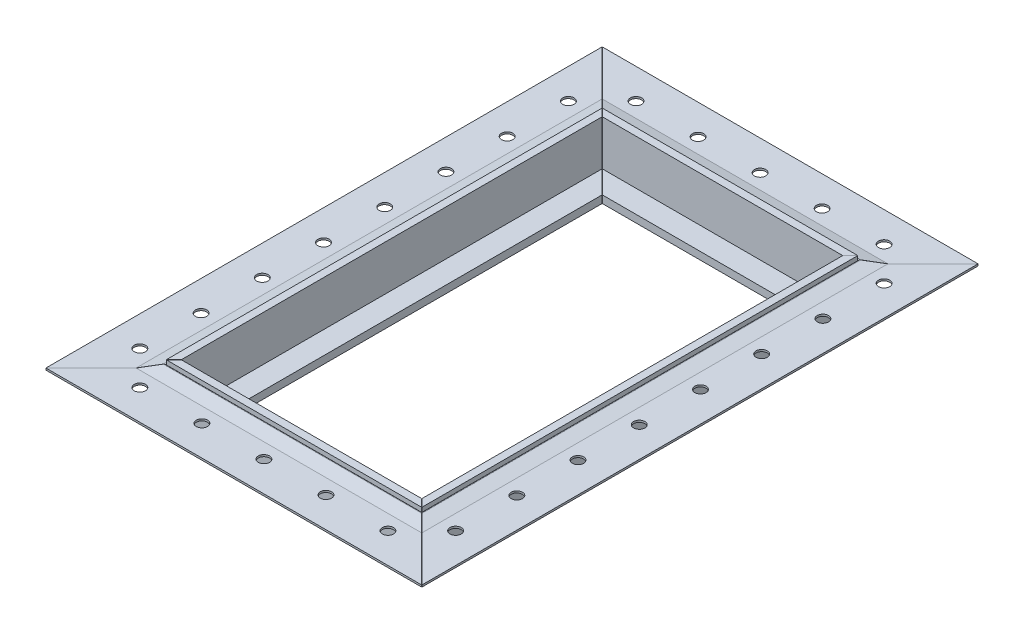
ISO-10303-21;
HEADER;
FILE_DESCRIPTION(('STEP AP214'),'2;1');
FILE_NAME('part.step','',(''),(''),'','','');
FILE_SCHEMA(('AUTOMOTIVE_DESIGN { 1 0 10303 214 1 1 1 1 }'));
ENDSEC;
DATA;
#1=APPLICATION_CONTEXT('core data for automotive mechanical design processes');
#2=APPLICATION_PROTOCOL_DEFINITION('international standard','automotive_design',2000,#1);
#3=PRODUCT_CONTEXT('',#1,'mechanical');
#4=PRODUCT('Part','Part','',(#3));
#5=PRODUCT_RELATED_PRODUCT_CATEGORY('part','',(#4));
#6=PRODUCT_DEFINITION_FORMATION('','',#4);
#7=PRODUCT_DEFINITION_CONTEXT('part definition',#1,'design');
#8=PRODUCT_DEFINITION('design','',#6,#7);
#9=PRODUCT_DEFINITION_SHAPE('','',#8);
#10=(LENGTH_UNIT() NAMED_UNIT(*) SI_UNIT(.MILLI.,.METRE.));
#11=(NAMED_UNIT(*) PLANE_ANGLE_UNIT() SI_UNIT($,.RADIAN.));
#12=(NAMED_UNIT(*) SI_UNIT($,.STERADIAN.) SOLID_ANGLE_UNIT());
#13=UNCERTAINTY_MEASURE_WITH_UNIT(LENGTH_MEASURE(1.E-05),#10,'distance_accuracy_value','');
#14=(GEOMETRIC_REPRESENTATION_CONTEXT(3) GLOBAL_UNCERTAINTY_ASSIGNED_CONTEXT((#13)) GLOBAL_UNIT_ASSIGNED_CONTEXT((#10,
#11,#12)) REPRESENTATION_CONTEXT('',''));
#15=CARTESIAN_POINT('',(0.,0.,0.));
#16=DIRECTION('',(0.,0.,1.));
#17=DIRECTION('',(1.,0.,0.));
#18=AXIS2_PLACEMENT_3D('',#15,#16,#17);
#19=CARTESIAN_POINT('',(0.,22.225,0.));
#20=DIRECTION('',(0.,1.,0.));
#21=DIRECTION('',(0.,0.,1.));
#22=AXIS2_PLACEMENT_3D('',#19,#20,#21);
#23=PLANE('',#22);
#24=DIRECTION('',(-0.707106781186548,0.,0.707106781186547));
#25=VECTOR('',#24,1.);
#26=CARTESIAN_POINT('',(-12.7179605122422,22.225,92.0570394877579));
#27=LINE('',#26,#25);
#28=CARTESIAN_POINT('',(-9.52500000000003,22.225,88.8640789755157));
#29=VERTEX_POINT('',#28);
#30=CARTESIAN_POINT('',(-12.7,22.225,92.0390789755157));
#31=VERTEX_POINT('',#30);
#32=EDGE_CURVE('E13',#29,#31,#27,.T.);
#33=ORIENTED_EDGE('',*,*,#32,.F.);
#34=DIRECTION('',(0.,0.,1.));
#35=VECTOR('',#34,1.);
#36=CARTESIAN_POINT('',(-9.52500000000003,22.225,-88.9));
#37=LINE('',#36,#35);
#38=CARTESIAN_POINT('',(-9.52500000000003,22.225,-88.8640789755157));
#39=VERTEX_POINT('',#38);
#40=EDGE_CURVE('E187',#39,#29,#37,.T.);
#41=ORIENTED_EDGE('',*,*,#40,.F.);
#42=DIRECTION('',(0.707106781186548,0.,0.707106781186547));
#43=VECTOR('',#42,1.);
#44=CARTESIAN_POINT('',(-12.7179605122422,22.225,-92.0570394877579));
#45=LINE('',#44,#43);
#46=CARTESIAN_POINT('',(-12.7,22.225,-92.0390789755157));
#47=VERTEX_POINT('',#46);
#48=EDGE_CURVE('E186',#47,#39,#45,.T.);
#49=ORIENTED_EDGE('',*,*,#48,.F.);
#50=DIRECTION('',(0.,0.,1.));
#51=VECTOR('',#50,1.);
#52=CARTESIAN_POINT('',(-12.7,22.225,-92.075));
#53=LINE('',#52,#51);
#54=EDGE_CURVE('E177',#47,#31,#53,.T.);
#55=ORIENTED_EDGE('',*,*,#54,.T.);
#56=EDGE_LOOP('',(#33,#41,#49,#55));
#57=FACE_BOUND('',#56,.T.);
#58=ADVANCED_FACE('F109',(#57),#23,.T.);
#59=CARTESIAN_POINT('',(0.,0.,0.));
#60=DIRECTION('',(0.,1.,0.));
#61=DIRECTION('',(0.,0.,1.));
#62=AXIS2_PLACEMENT_3D('',#59,#60,#61);
#63=PLANE('',#62);
#64=DIRECTION('',(0.,0.,1.));
#65=VECTOR('',#64,1.);
#66=CARTESIAN_POINT('',(0.,0.,-79.375));
#67=LINE('',#66,#65);
#68=CARTESIAN_POINT('',(0.,0.,-79.3390789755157));
#69=VERTEX_POINT('',#68);
#70=CARTESIAN_POINT('',(0.,0.,79.3390789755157));
#71=VERTEX_POINT('',#70);
#72=EDGE_CURVE('E164',#69,#71,#67,.T.);
#73=ORIENTED_EDGE('',*,*,#72,.T.);
#74=DIRECTION('',(-0.707106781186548,0.,0.707106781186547));
#75=VECTOR('',#74,1.);
#76=CARTESIAN_POINT('',(-12.7179605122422,0.,92.0570394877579));
#77=LINE('',#76,#75);
#78=CARTESIAN_POINT('',(-12.7,0.,92.0390789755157));
#79=VERTEX_POINT('',#78);
#80=EDGE_CURVE('E112',#71,#79,#77,.T.);
#81=ORIENTED_EDGE('',*,*,#80,.T.);
#82=DIRECTION('',(0.,0.,1.));
#83=VECTOR('',#82,1.);
#84=CARTESIAN_POINT('',(-12.7,0.,-92.075));
#85=LINE('',#84,#83);
#86=CARTESIAN_POINT('',(-12.7,0.,-92.0390789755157));
#87=VERTEX_POINT('',#86);
#88=EDGE_CURVE('E198',#87,#79,#85,.T.);
#89=ORIENTED_EDGE('',*,*,#88,.F.);
#90=DIRECTION('',(0.707106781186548,0.,0.707106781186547));
#91=VECTOR('',#90,1.);
#92=CARTESIAN_POINT('',(-12.7179605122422,0.,-92.0570394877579));
#93=LINE('',#92,#91);
#94=EDGE_CURVE('E163',#87,#69,#93,.T.);
#95=ORIENTED_EDGE('',*,*,#94,.T.);
#96=EDGE_LOOP('',(#73,#81,#89,#95));
#97=FACE_BOUND('',#96,.T.);
#98=ADVANCED_FACE('F176',(#97),#63,.F.);
#99=CARTESIAN_POINT('',(0.,3.175,0.));
#100=DIRECTION('',(0.,1.,0.));
#101=DIRECTION('',(0.,0.,1.));
#102=AXIS2_PLACEMENT_3D('',#99,#100,#101);
#103=PLANE('',#102);
#104=DIRECTION('',(-0.707106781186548,0.,0.707106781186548));
#105=VECTOR('',#104,1.);
#106=CARTESIAN_POINT('',(39.6695394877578,3.175,39.6695394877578));
#107=LINE('',#106,#105);
#108=CARTESIAN_POINT('',(0.,3.175,79.3390789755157));
#109=VERTEX_POINT('',#108);
#110=CARTESIAN_POINT('',(-9.52500000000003,3.175,88.8640789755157));
#111=VERTEX_POINT('',#110);
#112=EDGE_CURVE('E172',#109,#111,#107,.T.);
#113=ORIENTED_EDGE('',*,*,#112,.F.);
#114=DIRECTION('',(0.,0.,1.));
#115=VECTOR('',#114,1.);
#116=CARTESIAN_POINT('',(0.,3.175,-79.375));
#117=LINE('',#116,#115);
#118=CARTESIAN_POINT('',(0.,3.175,-79.3390789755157));
#119=VERTEX_POINT('',#118);
#120=EDGE_CURVE('E171',#119,#109,#117,.T.);
#121=ORIENTED_EDGE('',*,*,#120,.F.);
#122=DIRECTION('',(0.707106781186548,0.,0.707106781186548));
#123=VECTOR('',#122,1.);
#124=CARTESIAN_POINT('',(39.6695394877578,3.175,-39.6695394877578));
#125=LINE('',#124,#123);
#126=CARTESIAN_POINT('',(-9.52500000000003,3.175,-88.8640789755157));
#127=VERTEX_POINT('',#126);
#128=EDGE_CURVE('E193',#127,#119,#125,.T.);
#129=ORIENTED_EDGE('',*,*,#128,.F.);
#130=DIRECTION('',(0.,0.,1.));
#131=VECTOR('',#130,1.);
#132=CARTESIAN_POINT('',(-9.52500000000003,3.175,-88.9));
#133=LINE('',#132,#131);
#134=EDGE_CURVE('E183',#127,#111,#133,.T.);
#135=ORIENTED_EDGE('',*,*,#134,.T.);
#136=EDGE_LOOP('',(#113,#121,#129,#135));
#137=FACE_BOUND('',#136,.T.);
#138=ADVANCED_FACE('F210',(#137),#103,.T.);
#139=CARTESIAN_POINT('',(-12.7,22.225,-92.075));
#140=DIRECTION('',(1.,0.,0.));
#141=DIRECTION('',(0.,0.,-1.));
#142=AXIS2_PLACEMENT_3D('',#139,#140,#141);
#143=PLANE('',#142);
#144=ORIENTED_EDGE('',*,*,#88,.T.);
#145=DIRECTION('',(0.,1.,0.));
#146=VECTOR('',#145,1.);
#147=CARTESIAN_POINT('',(-12.7,22.225,92.0390789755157));
#148=LINE('',#147,#146);
#149=EDGE_CURVE('E123',#79,#31,#148,.T.);
#150=ORIENTED_EDGE('',*,*,#149,.T.);
#151=ORIENTED_EDGE('',*,*,#54,.F.);
#152=DIRECTION('',(0.,-1.,0.));
#153=VECTOR('',#152,1.);
#154=CARTESIAN_POINT('',(-12.7,22.225,-92.0390789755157));
#155=LINE('',#154,#153);
#156=EDGE_CURVE('E188',#47,#87,#155,.T.);
#157=ORIENTED_EDGE('',*,*,#156,.T.);
#158=EDGE_LOOP('',(#144,#150,#151,#157));
#159=FACE_BOUND('',#158,.T.);
#160=ADVANCED_FACE('F219',(#159),#143,.F.);
#161=CARTESIAN_POINT('',(-9.52500000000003,22.225,-88.9));
#162=DIRECTION('',(1.,0.,0.));
#163=DIRECTION('',(0.,0.,-1.));
#164=AXIS2_PLACEMENT_3D('',#161,#162,#163);
#165=PLANE('',#164);
#166=DIRECTION('',(0.,1.,0.));
#167=VECTOR('',#166,1.);
#168=CARTESIAN_POINT('',(-9.52500000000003,22.225,88.8640789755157));
#169=LINE('',#168,#167);
#170=EDGE_CURVE('E117',#111,#29,#169,.T.);
#171=ORIENTED_EDGE('',*,*,#170,.F.);
#172=ORIENTED_EDGE('',*,*,#134,.F.);
#173=DIRECTION('',(0.,-1.,0.));
#174=VECTOR('',#173,1.);
#175=CARTESIAN_POINT('',(-9.52500000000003,22.225,-88.8640789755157));
#176=LINE('',#175,#174);
#177=EDGE_CURVE('E191',#39,#127,#176,.T.);
#178=ORIENTED_EDGE('',*,*,#177,.F.);
#179=ORIENTED_EDGE('',*,*,#40,.T.);
#180=EDGE_LOOP('',(#171,#172,#178,#179));
#181=FACE_BOUND('',#180,.T.);
#182=ADVANCED_FACE('F206',(#181),#165,.T.);
#183=CARTESIAN_POINT('',(0.,3.175,-79.375));
#184=DIRECTION('',(1.,0.,0.));
#185=DIRECTION('',(0.,0.,-1.));
#186=AXIS2_PLACEMENT_3D('',#183,#184,#185);
#187=PLANE('',#186);
#188=DIRECTION('',(0.,1.,0.));
#189=VECTOR('',#188,1.);
#190=CARTESIAN_POINT('',(0.,3.175,79.3390789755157));
#191=LINE('',#190,#189);
#192=EDGE_CURVE('E157',#71,#109,#191,.T.);
#193=ORIENTED_EDGE('',*,*,#192,.F.);
#194=ORIENTED_EDGE('',*,*,#72,.F.);
#195=DIRECTION('',(0.,-1.,0.));
#196=VECTOR('',#195,1.);
#197=CARTESIAN_POINT('',(0.,3.175,-79.3390789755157));
#198=LINE('',#197,#196);
#199=EDGE_CURVE('E173',#119,#69,#198,.T.);
#200=ORIENTED_EDGE('',*,*,#199,.F.);
#201=ORIENTED_EDGE('',*,*,#120,.T.);
#202=EDGE_LOOP('',(#193,#194,#200,#201));
#203=FACE_BOUND('',#202,.T.);
#204=ADVANCED_FACE('F168',(#203),#187,.T.);
#205=CARTESIAN_POINT('',(-12.7179605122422,0.,-92.0570394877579));
#206=DIRECTION('',(-0.707106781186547,0.,0.707106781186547));
#207=DIRECTION('',(0.707106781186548,0.,0.707106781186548));
#208=AXIS2_PLACEMENT_3D('',#205,#206,#207);
#209=PLANE('',#208);
#210=ORIENTED_EDGE('',*,*,#48,.T.);
#211=ORIENTED_EDGE('',*,*,#177,.T.);
#212=ORIENTED_EDGE('',*,*,#128,.T.);
#213=ORIENTED_EDGE('',*,*,#199,.T.);
#214=ORIENTED_EDGE('',*,*,#94,.F.);
#215=ORIENTED_EDGE('',*,*,#156,.F.);
#216=EDGE_LOOP('',(#210,#211,#212,#213,#214,#215));
#217=FACE_BOUND('',#216,.T.);
#218=ADVANCED_FACE('F215',(#217),#209,.F.);
#219=CARTESIAN_POINT('',(-12.7179605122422,0.,92.0570394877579));
#220=DIRECTION('',(-0.707106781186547,0.,-0.707106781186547));
#221=DIRECTION('',(-0.707106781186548,0.,0.707106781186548));
#222=AXIS2_PLACEMENT_3D('',#219,#220,#221);
#223=PLANE('',#222);
#224=ORIENTED_EDGE('',*,*,#80,.F.);
#225=ORIENTED_EDGE('',*,*,#192,.T.);
#226=ORIENTED_EDGE('',*,*,#112,.T.);
#227=ORIENTED_EDGE('',*,*,#170,.T.);
#228=ORIENTED_EDGE('',*,*,#32,.T.);
#229=ORIENTED_EDGE('',*,*,#149,.F.);
#230=EDGE_LOOP('',(#224,#225,#226,#227,#228,#229));
#231=FACE_BOUND('',#230,.T.);
#232=ADVANCED_FACE('F156',(#231),#223,.F.);
#233=CLOSED_SHELL('',(#58,#98,#138,#160,#182,#204,#218,#232));
#234=MANIFOLD_SOLID_BREP('B2',#233);
#235=CARTESIAN_POINT('',(95.2320394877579,0.,92.0929605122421));
#236=DIRECTION('',(-0.707106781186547,0.,0.707106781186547));
#237=DIRECTION('',(0.707106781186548,0.,0.707106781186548));
#238=AXIS2_PLACEMENT_3D('',#235,#236,#237);
#239=PLANE('',#238);
#240=DIRECTION('',(0.707106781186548,0.,0.707106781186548));
#241=VECTOR('',#240,1.);
#242=CARTESIAN_POINT('',(95.2320394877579,0.,92.0929605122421));
#243=LINE('',#242,#241);
#244=CARTESIAN_POINT('',(82.5140789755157,0.,79.375));
#245=VERTEX_POINT('',#244);
#246=CARTESIAN_POINT('',(95.2140789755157,0.,92.075));
#247=VERTEX_POINT('',#246);
#248=EDGE_CURVE('E385',#245,#247,#243,.T.);
#249=ORIENTED_EDGE('',*,*,#248,.F.);
#250=DIRECTION('',(0.,1.,0.));
#251=VECTOR('',#250,1.);
#252=CARTESIAN_POINT('',(82.5140789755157,3.175,79.375));
#253=LINE('',#252,#251);
#254=CARTESIAN_POINT('',(82.5140789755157,3.175,79.375));
#255=VERTEX_POINT('',#254);
#256=EDGE_CURVE('E401',#245,#255,#253,.T.);
#257=ORIENTED_EDGE('',*,*,#256,.T.);
#258=DIRECTION('',(0.707106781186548,0.,0.707106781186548));
#259=VECTOR('',#258,1.);
#260=CARTESIAN_POINT('',(1.56953948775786,3.175,-1.56953948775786));
#261=LINE('',#260,#259);
#262=CARTESIAN_POINT('',(92.0390789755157,3.175,88.9));
#263=VERTEX_POINT('',#262);
#264=EDGE_CURVE('E398',#255,#263,#261,.T.);
#265=ORIENTED_EDGE('',*,*,#264,.T.);
#266=DIRECTION('',(0.,1.,0.));
#267=VECTOR('',#266,1.);
#268=CARTESIAN_POINT('',(92.0390789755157,22.225,88.9));
#269=LINE('',#268,#267);
#270=CARTESIAN_POINT('',(92.0390789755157,22.225,88.9));
#271=VERTEX_POINT('',#270);
#272=EDGE_CURVE('E395',#263,#271,#269,.T.);
#273=ORIENTED_EDGE('',*,*,#272,.T.);
#274=DIRECTION('',(0.707106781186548,0.,0.707106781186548));
#275=VECTOR('',#274,1.);
#276=CARTESIAN_POINT('',(95.2320394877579,22.225,92.0929605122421));
#277=LINE('',#276,#275);
#278=CARTESIAN_POINT('',(95.2140789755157,22.225,92.075));
#279=VERTEX_POINT('',#278);
#280=EDGE_CURVE('E325',#271,#279,#277,.T.);
#281=ORIENTED_EDGE('',*,*,#280,.T.);
#282=DIRECTION('',(0.,1.,0.));
#283=VECTOR('',#282,1.);
#284=CARTESIAN_POINT('',(95.2140789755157,22.225,92.075));
#285=LINE('',#284,#283);
#286=EDGE_CURVE('E386',#247,#279,#285,.T.);
#287=ORIENTED_EDGE('',*,*,#286,.F.);
#288=EDGE_LOOP('',(#249,#257,#265,#273,#281,#287));
#289=FACE_BOUND('',#288,.T.);
#290=ADVANCED_FACE('F317',(#289),#239,.F.);
#291=CARTESIAN_POINT('',(0.,3.175,79.375));
#292=DIRECTION('',(0.,0.,-1.));
#293=DIRECTION('',(-1.,0.,0.));
#294=AXIS2_PLACEMENT_3D('',#291,#292,#293);
#295=PLANE('',#294);
#296=DIRECTION('',(0.,-1.,0.));
#297=VECTOR('',#296,1.);
#298=CARTESIAN_POINT('',(0.035921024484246,3.175,79.375));
#299=LINE('',#298,#297);
#300=CARTESIAN_POINT('',(0.035921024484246,3.175,79.375));
#301=VERTEX_POINT('',#300);
#302=CARTESIAN_POINT('',(0.0359210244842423,0.,79.375));
#303=VERTEX_POINT('',#302);
#304=EDGE_CURVE('E107',#301,#303,#299,.T.);
#305=ORIENTED_EDGE('',*,*,#304,.F.);
#306=DIRECTION('',(1.,0.,0.));
#307=VECTOR('',#306,1.);
#308=CARTESIAN_POINT('',(0.,3.175,79.375));
#309=LINE('',#308,#307);
#310=EDGE_CURVE('E406',#301,#255,#309,.T.);
#311=ORIENTED_EDGE('',*,*,#310,.T.);
#312=ORIENTED_EDGE('',*,*,#256,.F.);
#313=DIRECTION('',(1.,0.,0.));
#314=VECTOR('',#313,1.);
#315=CARTESIAN_POINT('',(0.,0.,79.375));
#316=LINE('',#315,#314);
#317=EDGE_CURVE('E403',#303,#245,#316,.T.);
#318=ORIENTED_EDGE('',*,*,#317,.F.);
#319=EDGE_LOOP('',(#305,#311,#312,#318));
#320=FACE_BOUND('',#319,.T.);
#321=ADVANCED_FACE('F434',(#320),#295,.T.);
#322=CARTESIAN_POINT('',(-9.52500000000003,22.225,88.9));
#323=DIRECTION('',(0.,0.,-1.));
#324=DIRECTION('',(-1.,0.,0.));
#325=AXIS2_PLACEMENT_3D('',#322,#323,#324);
#326=PLANE('',#325);
#327=DIRECTION('',(0.,-1.,0.));
#328=VECTOR('',#327,1.);
#329=CARTESIAN_POINT('',(-9.48907897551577,22.225,88.9));
#330=LINE('',#329,#328);
#331=CARTESIAN_POINT('',(-9.48907897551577,22.225,88.9));
#332=VERTEX_POINT('',#331);
#333=CARTESIAN_POINT('',(-9.48907897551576,3.175,88.9));
#334=VERTEX_POINT('',#333);
#335=EDGE_CURVE('E380',#332,#334,#330,.T.);
#336=ORIENTED_EDGE('',*,*,#335,.F.);
#337=DIRECTION('',(1.,0.,0.));
#338=VECTOR('',#337,1.);
#339=CARTESIAN_POINT('',(-9.52500000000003,22.225,88.9));
#340=LINE('',#339,#338);
#341=EDGE_CURVE('E389',#332,#271,#340,.T.);
#342=ORIENTED_EDGE('',*,*,#341,.T.);
#343=ORIENTED_EDGE('',*,*,#272,.F.);
#344=DIRECTION('',(1.,0.,0.));
#345=VECTOR('',#344,1.);
#346=CARTESIAN_POINT('',(-9.52500000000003,3.175,88.9));
#347=LINE('',#346,#345);
#348=EDGE_CURVE('E387',#334,#263,#347,.T.);
#349=ORIENTED_EDGE('',*,*,#348,.F.);
#350=EDGE_LOOP('',(#336,#342,#343,#349));
#351=FACE_BOUND('',#350,.T.);
#352=ADVANCED_FACE('F423',(#351),#326,.T.);
#353=CARTESIAN_POINT('',(0.,3.175,0.));
#354=DIRECTION('',(0.,1.,0.));
#355=DIRECTION('',(0.,0.,1.));
#356=AXIS2_PLACEMENT_3D('',#353,#354,#355);
#357=PLANE('',#356);
#358=DIRECTION('',(0.707106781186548,0.,-0.707106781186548));
#359=VECTOR('',#358,1.);
#360=CARTESIAN_POINT('',(39.7054605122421,3.175,39.7054605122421));
#361=LINE('',#360,#359);
#362=EDGE_CURVE('E331',#334,#301,#361,.T.);
#363=ORIENTED_EDGE('',*,*,#362,.F.);
#364=ORIENTED_EDGE('',*,*,#348,.T.);
#365=ORIENTED_EDGE('',*,*,#264,.F.);
#366=ORIENTED_EDGE('',*,*,#310,.F.);
#367=EDGE_LOOP('',(#363,#364,#365,#366));
#368=FACE_BOUND('',#367,.T.);
#369=ADVANCED_FACE('F426',(#368),#357,.T.);
#370=CARTESIAN_POINT('',(-12.7,22.225,92.075));
#371=DIRECTION('',(0.,0.,-1.));
#372=DIRECTION('',(-1.,0.,0.));
#373=AXIS2_PLACEMENT_3D('',#370,#371,#372);
#374=PLANE('',#373);
#375=DIRECTION('',(1.,0.,0.));
#376=VECTOR('',#375,1.);
#377=CARTESIAN_POINT('',(-12.7,22.225,92.075));
#378=LINE('',#377,#376);
#379=CARTESIAN_POINT('',(-12.6640789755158,22.225,92.075));
#380=VERTEX_POINT('',#379);
#381=EDGE_CURVE('E379',#380,#279,#378,.T.);
#382=ORIENTED_EDGE('',*,*,#381,.F.);
#383=DIRECTION('',(0.,-1.,0.));
#384=VECTOR('',#383,1.);
#385=CARTESIAN_POINT('',(-12.6640789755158,22.225,92.075));
#386=LINE('',#385,#384);
#387=CARTESIAN_POINT('',(-12.6640789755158,0.,92.075));
#388=VERTEX_POINT('',#387);
#389=EDGE_CURVE('E371',#380,#388,#386,.T.);
#390=ORIENTED_EDGE('',*,*,#389,.T.);
#391=DIRECTION('',(1.,0.,0.));
#392=VECTOR('',#391,1.);
#393=CARTESIAN_POINT('',(-12.7,0.,92.075));
#394=LINE('',#393,#392);
#395=EDGE_CURVE('E339',#388,#247,#394,.T.);
#396=ORIENTED_EDGE('',*,*,#395,.T.);
#397=ORIENTED_EDGE('',*,*,#286,.T.);
#398=EDGE_LOOP('',(#382,#390,#396,#397));
#399=FACE_BOUND('',#398,.T.);
#400=ADVANCED_FACE('F378',(#399),#374,.F.);
#401=CARTESIAN_POINT('',(0.,0.,0.));
#402=DIRECTION('',(0.,1.,0.));
#403=DIRECTION('',(0.,0.,1.));
#404=AXIS2_PLACEMENT_3D('',#401,#402,#403);
#405=PLANE('',#404);
#406=ORIENTED_EDGE('',*,*,#395,.F.);
#407=DIRECTION('',(0.707106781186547,0.,-0.707106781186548));
#408=VECTOR('',#407,1.);
#409=CARTESIAN_POINT('',(-12.6820394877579,0.,92.0929605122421));
#410=LINE('',#409,#408);
#411=EDGE_CURVE('E369',#388,#303,#410,.T.);
#412=ORIENTED_EDGE('',*,*,#411,.T.);
#413=ORIENTED_EDGE('',*,*,#317,.T.);
#414=ORIENTED_EDGE('',*,*,#248,.T.);
#415=EDGE_LOOP('',(#406,#412,#413,#414));
#416=FACE_BOUND('',#415,.T.);
#417=ADVANCED_FACE('F383',(#416),#405,.F.);
#418=CARTESIAN_POINT('',(0.,22.225,0.));
#419=DIRECTION('',(0.,1.,0.));
#420=DIRECTION('',(0.,0.,1.));
#421=AXIS2_PLACEMENT_3D('',#418,#419,#420);
#422=PLANE('',#421);
#423=DIRECTION('',(0.707106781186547,0.,-0.707106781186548));
#424=VECTOR('',#423,1.);
#425=CARTESIAN_POINT('',(-12.6820394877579,22.225,92.0929605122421));
#426=LINE('',#425,#424);
#427=EDGE_CURVE('E375',#380,#332,#426,.T.);
#428=ORIENTED_EDGE('',*,*,#427,.F.);
#429=ORIENTED_EDGE('',*,*,#381,.T.);
#430=ORIENTED_EDGE('',*,*,#280,.F.);
#431=ORIENTED_EDGE('',*,*,#341,.F.);
#432=EDGE_LOOP('',(#428,#429,#430,#431));
#433=FACE_BOUND('',#432,.T.);
#434=ADVANCED_FACE('F319',(#433),#422,.T.);
#435=CARTESIAN_POINT('',(-12.6820394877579,0.,92.0929605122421));
#436=DIRECTION('',(0.707106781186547,0.,0.707106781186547));
#437=DIRECTION('',(0.707106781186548,0.,-0.707106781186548));
#438=AXIS2_PLACEMENT_3D('',#435,#436,#437);
#439=PLANE('',#438);
#440=ORIENTED_EDGE('',*,*,#427,.T.);
#441=ORIENTED_EDGE('',*,*,#335,.T.);
#442=ORIENTED_EDGE('',*,*,#362,.T.);
#443=ORIENTED_EDGE('',*,*,#304,.T.);
#444=ORIENTED_EDGE('',*,*,#411,.F.);
#445=ORIENTED_EDGE('',*,*,#389,.F.);
#446=EDGE_LOOP('',(#440,#441,#442,#443,#444,#445));
#447=FACE_BOUND('',#446,.T.);
#448=ADVANCED_FACE('F370',(#447),#439,.F.);
#449=CLOSED_SHELL('',(#290,#321,#352,#369,#400,#417,#434,#448));
#450=MANIFOLD_SOLID_BREP('B7',#449);
#451=CARTESIAN_POINT('',(95.2679605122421,0.,-92.0570394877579));
#452=DIRECTION('',(0.707106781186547,0.,0.707106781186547));
#453=DIRECTION('',(0.707106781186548,0.,-0.707106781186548));
#454=AXIS2_PLACEMENT_3D('',#451,#452,#453);
#455=PLANE('',#454);
#456=DIRECTION('',(0.707106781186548,0.,-0.707106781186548));
#457=VECTOR('',#456,1.);
#458=CARTESIAN_POINT('',(95.2679605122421,0.,-92.0570394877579));
#459=LINE('',#458,#457);
#460=CARTESIAN_POINT('',(82.55,0.,-79.3390789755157));
#461=VERTEX_POINT('',#460);
#462=CARTESIAN_POINT('',(95.25,0.,-92.0390789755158));
#463=VERTEX_POINT('',#462);
#464=EDGE_CURVE('E587',#461,#463,#459,.T.);
#465=ORIENTED_EDGE('',*,*,#464,.F.);
#466=DIRECTION('',(0.,1.,0.));
#467=VECTOR('',#466,1.);
#468=CARTESIAN_POINT('',(82.55,3.175,-79.3390789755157));
#469=LINE('',#468,#467);
#470=CARTESIAN_POINT('',(82.55,3.175,-79.3390789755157));
#471=VERTEX_POINT('',#470);
#472=EDGE_CURVE('E596',#461,#471,#469,.T.);
#473=ORIENTED_EDGE('',*,*,#472,.T.);
#474=DIRECTION('',(0.707106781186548,0.,-0.707106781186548));
#475=VECTOR('',#474,1.);
#476=CARTESIAN_POINT('',(1.60546051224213,3.175,1.60546051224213));
#477=LINE('',#476,#475);
#478=CARTESIAN_POINT('',(92.075,3.175,-88.8640789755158));
#479=VERTEX_POINT('',#478);
#480=EDGE_CURVE('E606',#471,#479,#477,.T.);
#481=ORIENTED_EDGE('',*,*,#480,.T.);
#482=DIRECTION('',(0.,1.,0.));
#483=VECTOR('',#482,1.);
#484=CARTESIAN_POINT('',(92.075,22.225,-88.8640789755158));
#485=LINE('',#484,#483);
#486=CARTESIAN_POINT('',(92.075,22.225,-88.8640789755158));
#487=VERTEX_POINT('',#486);
#488=EDGE_CURVE('E603',#479,#487,#485,.T.);
#489=ORIENTED_EDGE('',*,*,#488,.T.);
#490=DIRECTION('',(0.707106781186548,0.,-0.707106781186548));
#491=VECTOR('',#490,1.);
#492=CARTESIAN_POINT('',(95.2679605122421,22.225,-92.0570394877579));
#493=LINE('',#492,#491);
#494=CARTESIAN_POINT('',(95.25,22.225,-92.0390789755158));
#495=VERTEX_POINT('',#494);
#496=EDGE_CURVE('E527',#487,#495,#493,.T.);
#497=ORIENTED_EDGE('',*,*,#496,.T.);
#498=DIRECTION('',(0.,1.,0.));
#499=VECTOR('',#498,1.);
#500=CARTESIAN_POINT('',(95.25,22.225,-92.0390789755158));
#501=LINE('',#500,#499);
#502=EDGE_CURVE('E588',#463,#495,#501,.T.);
#503=ORIENTED_EDGE('',*,*,#502,.F.);
#504=EDGE_LOOP('',(#465,#473,#481,#489,#497,#503));
#505=FACE_BOUND('',#504,.T.);
#506=ADVANCED_FACE('F519',(#505),#455,.F.);
#507=CARTESIAN_POINT('',(82.55,3.175,-79.375));
#508=DIRECTION('',(-1.,0.,0.));
#509=DIRECTION('',(0.,0.,1.));
#510=AXIS2_PLACEMENT_3D('',#507,#508,#509);
#511=PLANE('',#510);
#512=DIRECTION('',(0.,-1.,0.));
#513=VECTOR('',#512,1.);
#514=CARTESIAN_POINT('',(82.55,3.175,79.3390789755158));
#515=LINE('',#514,#513);
#516=CARTESIAN_POINT('',(82.55,3.175,79.3390789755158));
#517=VERTEX_POINT('',#516);
#518=CARTESIAN_POINT('',(82.55,0.,79.3390789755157));
#519=VERTEX_POINT('',#518);
#520=EDGE_CURVE('E315',#517,#519,#515,.T.);
#521=ORIENTED_EDGE('',*,*,#520,.F.);
#522=DIRECTION('',(0.,0.,-1.));
#523=VECTOR('',#522,1.);
#524=CARTESIAN_POINT('',(82.55,3.175,-79.375));
#525=LINE('',#524,#523);
#526=EDGE_CURVE('E599',#517,#471,#525,.T.);
#527=ORIENTED_EDGE('',*,*,#526,.T.);
#528=ORIENTED_EDGE('',*,*,#472,.F.);
#529=DIRECTION('',(0.,0.,-1.));
#530=VECTOR('',#529,1.);
#531=CARTESIAN_POINT('',(82.55,0.,-79.375));
#532=LINE('',#531,#530);
#533=EDGE_CURVE('E598',#519,#461,#532,.T.);
#534=ORIENTED_EDGE('',*,*,#533,.F.);
#535=EDGE_LOOP('',(#521,#527,#528,#534));
#536=FACE_BOUND('',#535,.T.);
#537=ADVANCED_FACE('F627',(#536),#511,.T.);
#538=CARTESIAN_POINT('',(92.075,22.225,-88.9));
#539=DIRECTION('',(-1.,0.,0.));
#540=DIRECTION('',(0.,0.,1.));
#541=AXIS2_PLACEMENT_3D('',#538,#539,#540);
#542=PLANE('',#541);
#543=DIRECTION('',(0.,-1.,0.));
#544=VECTOR('',#543,1.);
#545=CARTESIAN_POINT('',(92.075,22.225,88.8640789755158));
#546=LINE('',#545,#544);
#547=CARTESIAN_POINT('',(92.075,22.225,88.8640789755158));
#548=VERTEX_POINT('',#547);
#549=CARTESIAN_POINT('',(92.075,3.175,88.8640789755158));
#550=VERTEX_POINT('',#549);
#551=EDGE_CURVE('E582',#548,#550,#546,.T.);
#552=ORIENTED_EDGE('',*,*,#551,.F.);
#553=DIRECTION('',(0.,0.,-1.));
#554=VECTOR('',#553,1.);
#555=CARTESIAN_POINT('',(92.075,22.225,-88.9));
#556=LINE('',#555,#554);
#557=EDGE_CURVE('E591',#548,#487,#556,.T.);
#558=ORIENTED_EDGE('',*,*,#557,.T.);
#559=ORIENTED_EDGE('',*,*,#488,.F.);
#560=DIRECTION('',(0.,0.,-1.));
#561=VECTOR('',#560,1.);
#562=CARTESIAN_POINT('',(92.075,3.175,-88.9));
#563=LINE('',#562,#561);
#564=EDGE_CURVE('E589',#550,#479,#563,.T.);
#565=ORIENTED_EDGE('',*,*,#564,.F.);
#566=EDGE_LOOP('',(#552,#558,#559,#565));
#567=FACE_BOUND('',#566,.T.);
#568=ADVANCED_FACE('F625',(#567),#542,.T.);
#569=CARTESIAN_POINT('',(0.,3.175,0.));
#570=DIRECTION('',(0.,1.,0.));
#571=DIRECTION('',(0.,0.,1.));
#572=AXIS2_PLACEMENT_3D('',#569,#570,#571);
#573=PLANE('',#572);
#574=DIRECTION('',(-0.707106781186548,0.,-0.707106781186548));
#575=VECTOR('',#574,1.);
#576=CARTESIAN_POINT('',(1.60546051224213,3.175,-1.60546051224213));
#577=LINE('',#576,#575);
#578=EDGE_CURVE('E533',#550,#517,#577,.T.);
#579=ORIENTED_EDGE('',*,*,#578,.F.);
#580=ORIENTED_EDGE('',*,*,#564,.T.);
#581=ORIENTED_EDGE('',*,*,#480,.F.);
#582=ORIENTED_EDGE('',*,*,#526,.F.);
#583=EDGE_LOOP('',(#579,#580,#581,#582));
#584=FACE_BOUND('',#583,.T.);
#585=ADVANCED_FACE('F623',(#584),#573,.T.);
#586=CARTESIAN_POINT('',(95.25,22.225,-92.075));
#587=DIRECTION('',(-1.,0.,0.));
#588=DIRECTION('',(0.,0.,1.));
#589=AXIS2_PLACEMENT_3D('',#586,#587,#588);
#590=PLANE('',#589);
#591=DIRECTION('',(0.,0.,-1.));
#592=VECTOR('',#591,1.);
#593=CARTESIAN_POINT('',(95.25,22.225,-92.075));
#594=LINE('',#593,#592);
#595=CARTESIAN_POINT('',(95.25,22.225,92.0390789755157));
#596=VERTEX_POINT('',#595);
#597=EDGE_CURVE('E581',#596,#495,#594,.T.);
#598=ORIENTED_EDGE('',*,*,#597,.F.);
#599=DIRECTION('',(0.,-1.,0.));
#600=VECTOR('',#599,1.);
#601=CARTESIAN_POINT('',(95.25,22.225,92.0390789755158));
#602=LINE('',#601,#600);
#603=CARTESIAN_POINT('',(95.25,0.,92.0390789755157));
#604=VERTEX_POINT('',#603);
#605=EDGE_CURVE('E573',#596,#604,#602,.T.);
#606=ORIENTED_EDGE('',*,*,#605,.T.);
#607=DIRECTION('',(0.,0.,-1.));
#608=VECTOR('',#607,1.);
#609=CARTESIAN_POINT('',(95.25,0.,-92.075));
#610=LINE('',#609,#608);
#611=EDGE_CURVE('E541',#604,#463,#610,.T.);
#612=ORIENTED_EDGE('',*,*,#611,.T.);
#613=ORIENTED_EDGE('',*,*,#502,.T.);
#614=EDGE_LOOP('',(#598,#606,#612,#613));
#615=FACE_BOUND('',#614,.T.);
#616=ADVANCED_FACE('F580',(#615),#590,.F.);
#617=CARTESIAN_POINT('',(0.,0.,0.));
#618=DIRECTION('',(0.,1.,0.));
#619=DIRECTION('',(0.,0.,1.));
#620=AXIS2_PLACEMENT_3D('',#617,#618,#619);
#621=PLANE('',#620);
#622=ORIENTED_EDGE('',*,*,#611,.F.);
#623=DIRECTION('',(-0.707106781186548,0.,-0.707106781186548));
#624=VECTOR('',#623,1.);
#625=CARTESIAN_POINT('',(95.2679605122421,0.,92.0570394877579));
#626=LINE('',#625,#624);
#627=EDGE_CURVE('E571',#604,#519,#626,.T.);
#628=ORIENTED_EDGE('',*,*,#627,.T.);
#629=ORIENTED_EDGE('',*,*,#533,.T.);
#630=ORIENTED_EDGE('',*,*,#464,.T.);
#631=EDGE_LOOP('',(#622,#628,#629,#630));
#632=FACE_BOUND('',#631,.T.);
#633=ADVANCED_FACE('F585',(#632),#621,.F.);
#634=CARTESIAN_POINT('',(0.,22.225,0.));
#635=DIRECTION('',(0.,1.,0.));
#636=DIRECTION('',(0.,0.,1.));
#637=AXIS2_PLACEMENT_3D('',#634,#635,#636);
#638=PLANE('',#637);
#639=DIRECTION('',(-0.707106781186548,0.,-0.707106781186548));
#640=VECTOR('',#639,1.);
#641=CARTESIAN_POINT('',(95.2679605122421,22.225,92.0570394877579));
#642=LINE('',#641,#640);
#643=EDGE_CURVE('E577',#596,#548,#642,.T.);
#644=ORIENTED_EDGE('',*,*,#643,.F.);
#645=ORIENTED_EDGE('',*,*,#597,.T.);
#646=ORIENTED_EDGE('',*,*,#496,.F.);
#647=ORIENTED_EDGE('',*,*,#557,.F.);
#648=EDGE_LOOP('',(#644,#645,#646,#647));
#649=FACE_BOUND('',#648,.T.);
#650=ADVANCED_FACE('F521',(#649),#638,.T.);
#651=CARTESIAN_POINT('',(95.2679605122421,0.,92.0570394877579));
#652=DIRECTION('',(0.707106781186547,0.,-0.707106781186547));
#653=DIRECTION('',(-0.707106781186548,0.,-0.707106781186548));
#654=AXIS2_PLACEMENT_3D('',#651,#652,#653);
#655=PLANE('',#654);
#656=ORIENTED_EDGE('',*,*,#643,.T.);
#657=ORIENTED_EDGE('',*,*,#551,.T.);
#658=ORIENTED_EDGE('',*,*,#578,.T.);
#659=ORIENTED_EDGE('',*,*,#520,.T.);
#660=ORIENTED_EDGE('',*,*,#627,.F.);
#661=ORIENTED_EDGE('',*,*,#605,.F.);
#662=EDGE_LOOP('',(#656,#657,#658,#659,#660,#661));
#663=FACE_BOUND('',#662,.T.);
#664=ADVANCED_FACE('F572',(#663),#655,.F.);
#665=CLOSED_SHELL('',(#506,#537,#568,#585,#616,#633,#650,#664));
#666=MANIFOLD_SOLID_BREP('B101',#665);
#667=CARTESIAN_POINT('',(-12.6820394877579,0.,-92.0929605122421));
#668=DIRECTION('',(0.707106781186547,0.,-0.707106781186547));
#669=DIRECTION('',(-0.707106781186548,0.,-0.707106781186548));
#670=AXIS2_PLACEMENT_3D('',#667,#668,#669);
#671=PLANE('',#670);
#672=DIRECTION('',(-0.707106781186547,0.,-0.707106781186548));
#673=VECTOR('',#672,1.);
#674=CARTESIAN_POINT('',(-12.6820394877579,0.,-92.0929605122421));
#675=LINE('',#674,#673);
#676=CARTESIAN_POINT('',(0.0359210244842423,0.,-79.375));
#677=VERTEX_POINT('',#676);
#678=CARTESIAN_POINT('',(-12.6640789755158,0.,-92.075));
#679=VERTEX_POINT('',#678);
#680=EDGE_CURVE('E798',#677,#679,#675,.T.);
#681=ORIENTED_EDGE('',*,*,#680,.F.);
#682=DIRECTION('',(0.,1.,0.));
#683=VECTOR('',#682,1.);
#684=CARTESIAN_POINT('',(0.0359210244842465,3.175,-79.375));
#685=LINE('',#684,#683);
#686=CARTESIAN_POINT('',(0.0359210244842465,3.175,-79.375));
#687=VERTEX_POINT('',#686);
#688=EDGE_CURVE('E737',#677,#687,#685,.T.);
#689=ORIENTED_EDGE('',*,*,#688,.T.);
#690=DIRECTION('',(-0.707106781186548,0.,-0.707106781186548));
#691=VECTOR('',#690,1.);
#692=CARTESIAN_POINT('',(39.7054605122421,3.175,-39.7054605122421));
#693=LINE('',#692,#691);
#694=CARTESIAN_POINT('',(-9.48907897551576,3.175,-88.9));
#695=VERTEX_POINT('',#694);
#696=EDGE_CURVE('E810',#687,#695,#693,.T.);
#697=ORIENTED_EDGE('',*,*,#696,.T.);
#698=DIRECTION('',(0.,1.,0.));
#699=VECTOR('',#698,1.);
#700=CARTESIAN_POINT('',(-9.48907897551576,22.225,-88.9));
#701=LINE('',#700,#699);
#702=CARTESIAN_POINT('',(-9.48907897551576,22.225,-88.9));
#703=VERTEX_POINT('',#702);
#704=EDGE_CURVE('E818',#695,#703,#701,.T.);
#705=ORIENTED_EDGE('',*,*,#704,.T.);
#706=DIRECTION('',(-0.707106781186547,0.,-0.707106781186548));
#707=VECTOR('',#706,1.);
#708=CARTESIAN_POINT('',(-12.6820394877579,22.225,-92.0929605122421));
#709=LINE('',#708,#707);
#710=CARTESIAN_POINT('',(-12.6640789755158,22.225,-92.075));
#711=VERTEX_POINT('',#710);
#712=EDGE_CURVE('E794',#703,#711,#709,.T.);
#713=ORIENTED_EDGE('',*,*,#712,.T.);
#714=DIRECTION('',(0.,1.,0.));
#715=VECTOR('',#714,1.);
#716=CARTESIAN_POINT('',(-12.6640789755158,22.225,-92.075));
#717=LINE('',#716,#715);
#718=EDGE_CURVE('E820',#679,#711,#717,.T.);
#719=ORIENTED_EDGE('',*,*,#718,.F.);
#720=EDGE_LOOP('',(#681,#689,#697,#705,#713,#719));
#721=FACE_BOUND('',#720,.T.);
#722=ADVANCED_FACE('F729',(#721),#671,.F.);
#723=CARTESIAN_POINT('',(0.,3.175,-79.375));
#724=DIRECTION('',(0.,0.,1.));
#725=DIRECTION('',(1.,0.,0.));
#726=AXIS2_PLACEMENT_3D('',#723,#724,#725);
#727=PLANE('',#726);
#728=DIRECTION('',(0.,-1.,0.));
#729=VECTOR('',#728,1.);
#730=CARTESIAN_POINT('',(82.5140789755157,3.175,-79.375));
#731=LINE('',#730,#729);
#732=CARTESIAN_POINT('',(82.5140789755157,3.175,-79.375));
#733=VERTEX_POINT('',#732);
#734=CARTESIAN_POINT('',(82.5140789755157,0.,-79.375));
#735=VERTEX_POINT('',#734);
#736=EDGE_CURVE('E517',#733,#735,#731,.T.);
#737=ORIENTED_EDGE('',*,*,#736,.F.);
#738=DIRECTION('',(-1.,0.,0.));
#739=VECTOR('',#738,1.);
#740=CARTESIAN_POINT('',(0.,3.175,-79.375));
#741=LINE('',#740,#739);
#742=EDGE_CURVE('E816',#733,#687,#741,.T.);
#743=ORIENTED_EDGE('',*,*,#742,.T.);
#744=ORIENTED_EDGE('',*,*,#688,.F.);
#745=DIRECTION('',(-1.,0.,0.));
#746=VECTOR('',#745,1.);
#747=CARTESIAN_POINT('',(0.,0.,-79.375));
#748=LINE('',#747,#746);
#749=EDGE_CURVE('E751',#735,#677,#748,.T.);
#750=ORIENTED_EDGE('',*,*,#749,.F.);
#751=EDGE_LOOP('',(#737,#743,#744,#750));
#752=FACE_BOUND('',#751,.T.);
#753=ADVANCED_FACE('F828',(#752),#727,.T.);
#754=CARTESIAN_POINT('',(0.,3.175,0.));
#755=DIRECTION('',(0.,1.,0.));
#756=DIRECTION('',(0.,0.,1.));
#757=AXIS2_PLACEMENT_3D('',#754,#755,#756);
#758=PLANE('',#757);
#759=DIRECTION('',(-0.707106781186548,0.,0.707106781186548));
#760=VECTOR('',#759,1.);
#761=CARTESIAN_POINT('',(1.56953948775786,3.175,1.56953948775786));
#762=LINE('',#761,#760);
#763=CARTESIAN_POINT('',(92.0390789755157,3.175,-88.9));
#764=VERTEX_POINT('',#763);
#765=EDGE_CURVE('E743',#764,#733,#762,.T.);
#766=ORIENTED_EDGE('',*,*,#765,.F.);
#767=DIRECTION('',(-1.,0.,0.));
#768=VECTOR('',#767,1.);
#769=CARTESIAN_POINT('',(-9.52500000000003,3.175,-88.9));
#770=LINE('',#769,#768);
#771=EDGE_CURVE('E802',#764,#695,#770,.T.);
#772=ORIENTED_EDGE('',*,*,#771,.T.);
#773=ORIENTED_EDGE('',*,*,#696,.F.);
#774=ORIENTED_EDGE('',*,*,#742,.F.);
#775=EDGE_LOOP('',(#766,#772,#773,#774));
#776=FACE_BOUND('',#775,.T.);
#777=ADVANCED_FACE('F815',(#776),#758,.T.);
#778=CARTESIAN_POINT('',(-9.52500000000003,22.225,-88.9));
#779=DIRECTION('',(0.,0.,1.));
#780=DIRECTION('',(1.,0.,0.));
#781=AXIS2_PLACEMENT_3D('',#778,#779,#780);
#782=PLANE('',#781);
#783=DIRECTION('',(0.,-1.,0.));
#784=VECTOR('',#783,1.);
#785=CARTESIAN_POINT('',(92.0390789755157,22.225,-88.9));
#786=LINE('',#785,#784);
#787=CARTESIAN_POINT('',(92.0390789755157,22.225,-88.9));
#788=VERTEX_POINT('',#787);
#789=EDGE_CURVE('E795',#788,#764,#786,.T.);
#790=ORIENTED_EDGE('',*,*,#789,.F.);
#791=DIRECTION('',(-1.,0.,0.));
#792=VECTOR('',#791,1.);
#793=CARTESIAN_POINT('',(-9.52500000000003,22.225,-88.9));
#794=LINE('',#793,#792);
#795=EDGE_CURVE('E799',#788,#703,#794,.T.);
#796=ORIENTED_EDGE('',*,*,#795,.T.);
#797=ORIENTED_EDGE('',*,*,#704,.F.);
#798=ORIENTED_EDGE('',*,*,#771,.F.);
#799=EDGE_LOOP('',(#790,#796,#797,#798));
#800=FACE_BOUND('',#799,.T.);
#801=ADVANCED_FACE('F835',(#800),#782,.T.);
#802=CARTESIAN_POINT('',(-12.7,22.225,-92.075));
#803=DIRECTION('',(0.,0.,1.));
#804=DIRECTION('',(1.,0.,0.));
#805=AXIS2_PLACEMENT_3D('',#802,#803,#804);
#806=PLANE('',#805);
#807=DIRECTION('',(-1.,0.,0.));
#808=VECTOR('',#807,1.);
#809=CARTESIAN_POINT('',(-12.7,22.225,-92.075));
#810=LINE('',#809,#808);
#811=CARTESIAN_POINT('',(95.2140789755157,22.225,-92.075));
#812=VERTEX_POINT('',#811);
#813=EDGE_CURVE('E793',#812,#711,#810,.T.);
#814=ORIENTED_EDGE('',*,*,#813,.F.);
#815=DIRECTION('',(0.,-1.,0.));
#816=VECTOR('',#815,1.);
#817=CARTESIAN_POINT('',(95.2140789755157,22.225,-92.075));
#818=LINE('',#817,#816);
#819=CARTESIAN_POINT('',(95.2140789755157,0.,-92.075));
#820=VERTEX_POINT('',#819);
#821=EDGE_CURVE('E783',#812,#820,#818,.T.);
#822=ORIENTED_EDGE('',*,*,#821,.T.);
#823=DIRECTION('',(-1.,0.,0.));
#824=VECTOR('',#823,1.);
#825=CARTESIAN_POINT('',(-12.7,0.,-92.075));
#826=LINE('',#825,#824);
#827=EDGE_CURVE('E791',#820,#679,#826,.T.);
#828=ORIENTED_EDGE('',*,*,#827,.T.);
#829=ORIENTED_EDGE('',*,*,#718,.T.);
#830=EDGE_LOOP('',(#814,#822,#828,#829));
#831=FACE_BOUND('',#830,.T.);
#832=ADVANCED_FACE('F731',(#831),#806,.F.);
#833=CARTESIAN_POINT('',(0.,0.,0.));
#834=DIRECTION('',(0.,1.,0.));
#835=DIRECTION('',(0.,0.,1.));
#836=AXIS2_PLACEMENT_3D('',#833,#834,#835);
#837=PLANE('',#836);
#838=ORIENTED_EDGE('',*,*,#827,.F.);
#839=DIRECTION('',(-0.707106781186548,0.,0.707106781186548));
#840=VECTOR('',#839,1.);
#841=CARTESIAN_POINT('',(95.2320394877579,0.,-92.0929605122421));
#842=LINE('',#841,#840);
#843=EDGE_CURVE('E780',#820,#735,#842,.T.);
#844=ORIENTED_EDGE('',*,*,#843,.T.);
#845=ORIENTED_EDGE('',*,*,#749,.T.);
#846=ORIENTED_EDGE('',*,*,#680,.T.);
#847=EDGE_LOOP('',(#838,#844,#845,#846));
#848=FACE_BOUND('',#847,.T.);
#849=ADVANCED_FACE('F797',(#848),#837,.F.);
#850=CARTESIAN_POINT('',(0.,22.225,0.));
#851=DIRECTION('',(0.,1.,0.));
#852=DIRECTION('',(0.,0.,1.));
#853=AXIS2_PLACEMENT_3D('',#850,#851,#852);
#854=PLANE('',#853);
#855=DIRECTION('',(-0.707106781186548,0.,0.707106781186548));
#856=VECTOR('',#855,1.);
#857=CARTESIAN_POINT('',(95.2320394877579,22.225,-92.0929605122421));
#858=LINE('',#857,#856);
#859=EDGE_CURVE('E786',#812,#788,#858,.T.);
#860=ORIENTED_EDGE('',*,*,#859,.F.);
#861=ORIENTED_EDGE('',*,*,#813,.T.);
#862=ORIENTED_EDGE('',*,*,#712,.F.);
#863=ORIENTED_EDGE('',*,*,#795,.F.);
#864=EDGE_LOOP('',(#860,#861,#862,#863));
#865=FACE_BOUND('',#864,.T.);
#866=ADVANCED_FACE('F843',(#865),#854,.T.);
#867=CARTESIAN_POINT('',(95.2320394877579,0.,-92.0929605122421));
#868=DIRECTION('',(-0.707106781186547,0.,-0.707106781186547));
#869=DIRECTION('',(-0.707106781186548,0.,0.707106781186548));
#870=AXIS2_PLACEMENT_3D('',#867,#868,#869);
#871=PLANE('',#870);
#872=ORIENTED_EDGE('',*,*,#859,.T.);
#873=ORIENTED_EDGE('',*,*,#789,.T.);
#874=ORIENTED_EDGE('',*,*,#765,.T.);
#875=ORIENTED_EDGE('',*,*,#736,.T.);
#876=ORIENTED_EDGE('',*,*,#843,.F.);
#877=ORIENTED_EDGE('',*,*,#821,.F.);
#878=EDGE_LOOP('',(#872,#873,#874,#875,#876,#877));
#879=FACE_BOUND('',#878,.T.);
#880=ADVANCED_FACE('F782',(#879),#871,.F.);
#881=CLOSED_SHELL('',(#722,#753,#777,#801,#832,#849,#866,#880));
#882=MANIFOLD_SOLID_BREP('B309',#881);
#883=CARTESIAN_POINT('',(96.0437499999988,-2.23813599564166E-13,88.9));
#884=DIRECTION('',(-1.,0.,0.));
#885=DIRECTION('',(0.,-1.,0.));
#886=AXIS2_PLACEMENT_3D('',#883,#884,#885);
#887=PLANE('',#886);
#888=DIRECTION('',(0.,0.,-1.));
#889=VECTOR('',#888,1.);
#890=CARTESIAN_POINT('',(96.0437499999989,19.4533685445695,88.9));
#891=LINE('',#890,#889);
#892=CARTESIAN_POINT('',(96.0437499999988,19.4533685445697,92.8328289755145));
#893=VERTEX_POINT('',#892);
#894=CARTESIAN_POINT('',(96.0437499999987,19.4533685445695,-92.8328289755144));
#895=VERTEX_POINT('',#894);
#896=EDGE_CURVE('E1030',#893,#895,#891,.T.);
#897=ORIENTED_EDGE('',*,*,#896,.F.);
#898=DIRECTION('',(0.,-1.,0.));
#899=VECTOR('',#898,1.);
#900=CARTESIAN_POINT('',(96.0437499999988,1.58749999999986,92.8328289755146));
#901=LINE('',#900,#899);
#902=CARTESIAN_POINT('',(96.0437499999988,1.58750000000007,92.8328289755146));
#903=VERTEX_POINT('',#902);
#904=EDGE_CURVE('E1050',#893,#903,#901,.T.);
#905=ORIENTED_EDGE('',*,*,#904,.T.);
#906=DIRECTION('',(0.,0.,1.));
#907=VECTOR('',#906,1.);
#908=CARTESIAN_POINT('',(96.0437499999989,1.58750000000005,-88.9));
#909=LINE('',#908,#907);
#910=CARTESIAN_POINT('',(96.0437499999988,1.58750000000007,-92.8328289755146));
#911=VERTEX_POINT('',#910);
#912=EDGE_CURVE('E1040',#911,#903,#909,.T.);
#913=ORIENTED_EDGE('',*,*,#912,.F.);
#914=DIRECTION('',(0.,1.,0.));
#915=VECTOR('',#914,1.);
#916=CARTESIAN_POINT('',(96.0437499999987,19.4533685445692,-92.8328289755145));
#917=LINE('',#916,#915);
#918=EDGE_CURVE('E1057',#911,#895,#917,.T.);
#919=ORIENTED_EDGE('',*,*,#918,.T.);
#920=EDGE_LOOP('',(#897,#905,#913,#919));
#921=FACE_BOUND('',#920,.T.);
#922=ADVANCED_FACE('F937',(#921),#887,.F.);
#923=CARTESIAN_POINT('',(120.649999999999,0.,88.9));
#924=DIRECTION('',(1.,0.,0.));
#925=DIRECTION('',(0.,0.,-1.));
#926=AXIS2_PLACEMENT_3D('',#923,#924,#925);
#927=PLANE('',#926);
#928=DIRECTION('',(0.,0.,-1.));
#929=VECTOR('',#928,1.);
#930=CARTESIAN_POINT('',(120.649999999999,18.4140520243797,88.9));
#931=LINE('',#930,#929);
#932=CARTESIAN_POINT('',(120.65,18.4140520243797,117.439078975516));
#933=VERTEX_POINT('',#932);
#934=CARTESIAN_POINT('',(120.65,18.4140520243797,-117.439078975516));
#935=VERTEX_POINT('',#934);
#936=EDGE_CURVE('E1027',#933,#935,#931,.T.);
#937=ORIENTED_EDGE('',*,*,#936,.T.);
#938=DIRECTION('',(0.,1.,0.));
#939=VECTOR('',#938,1.);
#940=CARTESIAN_POINT('',(120.65,19.2078020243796,-117.439078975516));
#941=LINE('',#940,#939);
#942=CARTESIAN_POINT('',(120.65,19.2078020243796,-117.439078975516));
#943=VERTEX_POINT('',#942);
#944=EDGE_CURVE('E1082',#935,#943,#941,.T.);
#945=ORIENTED_EDGE('',*,*,#944,.T.);
#946=DIRECTION('',(0.,0.,-1.));
#947=VECTOR('',#946,1.);
#948=CARTESIAN_POINT('',(120.649999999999,19.2078020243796,88.9));
#949=LINE('',#948,#947);
#950=CARTESIAN_POINT('',(120.65,19.2078020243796,117.439078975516));
#951=VERTEX_POINT('',#950);
#952=EDGE_CURVE('E1097',#951,#943,#949,.T.);
#953=ORIENTED_EDGE('',*,*,#952,.F.);
#954=DIRECTION('',(0.,-1.,0.));
#955=VECTOR('',#954,1.);
#956=CARTESIAN_POINT('',(120.65,18.4140520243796,117.439078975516));
#957=LINE('',#956,#955);
#958=EDGE_CURVE('E1073',#951,#933,#957,.T.);
#959=ORIENTED_EDGE('',*,*,#958,.T.);
#960=EDGE_LOOP('',(#937,#945,#953,#959));
#961=FACE_BOUND('',#960,.T.);
#962=ADVANCED_FACE('F1109',(#961),#927,.T.);
#963=CARTESIAN_POINT('',(96.2977499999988,19.4533685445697,88.9));
#964=DIRECTION('',(0.,0.,-1.));
#965=DIRECTION('',(-1.,0.,0.));
#966=AXIS2_PLACEMENT_3D('',#963,#964,#965);
#967=CYLINDRICAL_SURFACE('',#966,0.254000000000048);
#968=ORIENTED_EDGE('',*,*,#896,.T.);
#969=CARTESIAN_POINT('',(96.2977499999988,19.4533685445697,-93.0868289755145));
#970=DIRECTION('',(0.707106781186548,0.,0.707106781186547));
#971=DIRECTION('',(-0.707106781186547,0.,0.707106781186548));
#972=AXIS2_PLACEMENT_3D('',#969,#970,#971);
#973=ELLIPSE('',#972,0.359210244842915,0.254000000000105);
#974=CARTESIAN_POINT('',(96.3593540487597,19.6997847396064,-93.1484330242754));
#975=VERTEX_POINT('',#974);
#976=EDGE_CURVE('E1060',#895,#975,#973,.F.);
#977=ORIENTED_EDGE('',*,*,#976,.T.);
#978=DIRECTION('',(0.,0.,-1.));
#979=VECTOR('',#978,1.);
#980=CARTESIAN_POINT('',(96.3593540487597,19.6997847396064,88.9));
#981=LINE('',#980,#979);
#982=CARTESIAN_POINT('',(96.3593540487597,19.6997847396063,93.1484330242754));
#983=VERTEX_POINT('',#982);
#984=EDGE_CURVE('E1094',#983,#975,#981,.T.);
#985=ORIENTED_EDGE('',*,*,#984,.F.);
#986=CARTESIAN_POINT('',(96.2977499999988,19.4533685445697,93.0868289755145));
#987=DIRECTION('',(0.707106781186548,0.,-0.707106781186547));
#988=DIRECTION('',(-0.707106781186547,0.,-0.707106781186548));
#989=AXIS2_PLACEMENT_3D('',#986,#987,#988);
#990=ELLIPSE('',#989,0.359210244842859,0.254000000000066);
#991=EDGE_CURVE('E1058',#983,#893,#990,.F.);
#992=ORIENTED_EDGE('',*,*,#991,.T.);
#993=EDGE_LOOP('',(#968,#977,#985,#992));
#994=FACE_BOUND('',#993,.T.);
#995=ADVANCED_FACE('F1120',(#994),#967,.F.);
#996=CARTESIAN_POINT('',(10.303440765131,41.2137630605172,88.9));
#997=DIRECTION('',(-0.242535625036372,-0.970142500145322,0.));
#998=DIRECTION('',(0.970142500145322,-0.242535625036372,0.));
#999=AXIS2_PLACEMENT_3D('',#996,#997,#998);
#1000=PLANE('',#999);
#1001=ORIENTED_EDGE('',*,*,#984,.T.);
#1002=DIRECTION('',(0.696310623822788,-0.174077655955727,-0.696310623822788));
#1003=VECTOR('',#1002,1.);
#1004=CARTESIAN_POINT('',(123.207804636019,12.9876720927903,-119.996883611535));
#1005=LINE('',#1004,#1003);
#1006=CARTESIAN_POINT('',(101.502284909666,18.4140520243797,-98.2913638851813));
#1007=VERTEX_POINT('',#1006);
#1008=EDGE_CURVE('E1088',#975,#1007,#1005,.T.);
#1009=ORIENTED_EDGE('',*,*,#1008,.T.);
#1010=DIRECTION('',(0.,0.,-1.));
#1011=VECTOR('',#1010,1.);
#1012=CARTESIAN_POINT('',(101.502284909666,18.4140520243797,88.9));
#1013=LINE('',#1012,#1011);
#1014=CARTESIAN_POINT('',(101.502284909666,18.4140520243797,98.2913638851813));
#1015=VERTEX_POINT('',#1014);
#1016=EDGE_CURVE('E1096',#1015,#1007,#1013,.T.);
#1017=ORIENTED_EDGE('',*,*,#1016,.F.);
#1018=DIRECTION('',(-0.696310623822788,0.174077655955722,-0.696310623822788));
#1019=VECTOR('',#1018,1.);
#1020=CARTESIAN_POINT('',(120.558416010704,13.6500192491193,117.34749498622));
#1021=LINE('',#1020,#1019);
#1022=EDGE_CURVE('E1062',#1015,#983,#1021,.T.);
#1023=ORIENTED_EDGE('',*,*,#1022,.T.);
#1024=EDGE_LOOP('',(#1001,#1009,#1017,#1023));
#1025=FACE_BOUND('',#1024,.T.);
#1026=ADVANCED_FACE('F1118',(#1025),#1000,.T.);
#1027=CARTESIAN_POINT('',(0.,18.4140520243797,88.9));
#1028=DIRECTION('',(0.,1.,0.));
#1029=DIRECTION('',(0.,0.,1.));
#1030=AXIS2_PLACEMENT_3D('',#1027,#1028,#1029);
#1031=PLANE('',#1030);
#1032=CARTESIAN_POINT('',(107.95,18.4140520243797,-90.4875));
#1033=DIRECTION('',(0.,1.,0.));
#1034=DIRECTION('',(0.,0.,1.));
#1035=AXIS2_PLACEMENT_3D('',#1032,#1033,#1034);
#1036=CIRCLE('',#1035,2.38125);
#1037=CARTESIAN_POINT('',(107.95,18.4140520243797,-88.10625));
#1038=VERTEX_POINT('',#1037);
#1039=EDGE_CURVE('E1065',#1038,#1038,#1036,.T.);
#1040=ORIENTED_EDGE('',*,*,#1039,.T.);
#1041=EDGE_LOOP('',(#1040));
#1042=FACE_BOUND('',#1041,.T.);
#1043=CARTESIAN_POINT('',(107.95,18.4140520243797,-64.63392857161));
#1044=DIRECTION('',(0.,1.,0.));
#1045=DIRECTION('',(0.,0.,1.));
#1046=AXIS2_PLACEMENT_3D('',#1043,#1044,#1045);
#1047=CIRCLE('',#1046,2.38125);
#1048=CARTESIAN_POINT('',(107.95,18.4140520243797,-62.25267857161));
#1049=VERTEX_POINT('',#1048);
#1050=EDGE_CURVE('E1165',#1049,#1049,#1047,.T.);
#1051=ORIENTED_EDGE('',*,*,#1050,.T.);
#1052=EDGE_LOOP('',(#1051));
#1053=FACE_BOUND('',#1052,.T.);
#1054=CARTESIAN_POINT('',(107.95,18.4140520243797,-38.7803571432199));
#1055=DIRECTION('',(0.,1.,0.));
#1056=DIRECTION('',(0.,0.,1.));
#1057=AXIS2_PLACEMENT_3D('',#1054,#1055,#1056);
#1058=CIRCLE('',#1057,2.38125);
#1059=CARTESIAN_POINT('',(107.95,18.4140520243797,-36.3991071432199));
#1060=VERTEX_POINT('',#1059);
#1061=EDGE_CURVE('E1163',#1060,#1060,#1058,.T.);
#1062=ORIENTED_EDGE('',*,*,#1061,.T.);
#1063=EDGE_LOOP('',(#1062));
#1064=FACE_BOUND('',#1063,.T.);
#1065=CARTESIAN_POINT('',(107.95,18.4140520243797,-12.9267857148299));
#1066=DIRECTION('',(0.,1.,0.));
#1067=DIRECTION('',(0.,0.,1.));
#1068=AXIS2_PLACEMENT_3D('',#1065,#1066,#1067);
#1069=CIRCLE('',#1068,2.38125000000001);
#1070=CARTESIAN_POINT('',(107.95,18.4140520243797,-10.5455357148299));
#1071=VERTEX_POINT('',#1070);
#1072=EDGE_CURVE('E1160',#1071,#1071,#1069,.T.);
#1073=ORIENTED_EDGE('',*,*,#1072,.T.);
#1074=EDGE_LOOP('',(#1073));
#1075=FACE_BOUND('',#1074,.T.);
#1076=CARTESIAN_POINT('',(107.95,18.4140520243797,12.92678571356));
#1077=DIRECTION('',(0.,1.,0.));
#1078=DIRECTION('',(0.,0.,1.));
#1079=AXIS2_PLACEMENT_3D('',#1076,#1077,#1078);
#1080=CIRCLE('',#1079,2.38125000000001);
#1081=CARTESIAN_POINT('',(107.95,18.4140520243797,15.30803571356));
#1082=VERTEX_POINT('',#1081);
#1083=EDGE_CURVE('E1157',#1082,#1082,#1080,.T.);
#1084=ORIENTED_EDGE('',*,*,#1083,.T.);
#1085=EDGE_LOOP('',(#1084));
#1086=FACE_BOUND('',#1085,.T.);
#1087=CARTESIAN_POINT('',(107.95,18.4140520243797,38.78035714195));
#1088=DIRECTION('',(0.,1.,0.));
#1089=DIRECTION('',(0.,0.,1.));
#1090=AXIS2_PLACEMENT_3D('',#1087,#1088,#1089);
#1091=CIRCLE('',#1090,2.38125);
#1092=CARTESIAN_POINT('',(107.95,18.4140520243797,41.16160714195));
#1093=VERTEX_POINT('',#1092);
#1094=EDGE_CURVE('E1154',#1093,#1093,#1091,.T.);
#1095=ORIENTED_EDGE('',*,*,#1094,.T.);
#1096=EDGE_LOOP('',(#1095));
#1097=FACE_BOUND('',#1096,.T.);
#1098=CARTESIAN_POINT('',(107.95,18.4140520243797,64.63392857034));
#1099=DIRECTION('',(0.,1.,0.));
#1100=DIRECTION('',(0.,0.,1.));
#1101=AXIS2_PLACEMENT_3D('',#1098,#1099,#1100);
#1102=CIRCLE('',#1101,2.38125);
#1103=CARTESIAN_POINT('',(107.95,18.4140520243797,67.01517857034));
#1104=VERTEX_POINT('',#1103);
#1105=EDGE_CURVE('E1151',#1104,#1104,#1102,.T.);
#1106=ORIENTED_EDGE('',*,*,#1105,.T.);
#1107=EDGE_LOOP('',(#1106));
#1108=FACE_BOUND('',#1107,.T.);
#1109=CARTESIAN_POINT('',(107.95,18.4140520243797,90.48749999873));
#1110=DIRECTION('',(0.,1.,0.));
#1111=DIRECTION('',(0.,0.,1.));
#1112=AXIS2_PLACEMENT_3D('',#1109,#1110,#1111);
#1113=CIRCLE('',#1112,2.38125);
#1114=CARTESIAN_POINT('',(107.95,18.4140520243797,92.86874999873));
#1115=VERTEX_POINT('',#1114);
#1116=EDGE_CURVE('E1131',#1115,#1115,#1113,.T.);
#1117=ORIENTED_EDGE('',*,*,#1116,.T.);
#1118=EDGE_LOOP('',(#1117));
#1119=FACE_BOUND('',#1118,.T.);
#1120=ORIENTED_EDGE('',*,*,#1016,.T.);
#1121=DIRECTION('',(0.707106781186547,0.,-0.707106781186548));
#1122=VECTOR('',#1121,1.);
#1123=CARTESIAN_POINT('',(133.459959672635,18.4140520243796,-130.249038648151));
#1124=LINE('',#1123,#1122);
#1125=EDGE_CURVE('E1085',#1007,#935,#1124,.T.);
#1126=ORIENTED_EDGE('',*,*,#1125,.T.);
#1127=ORIENTED_EDGE('',*,*,#936,.F.);
#1128=DIRECTION('',(-0.707106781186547,0.,-0.707106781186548));
#1129=VECTOR('',#1128,1.);
#1130=CARTESIAN_POINT('',(123.886102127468,18.4140520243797,120.675181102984));
#1131=LINE('',#1130,#1129);
#1132=EDGE_CURVE('E1070',#933,#1015,#1131,.T.);
#1133=ORIENTED_EDGE('',*,*,#1132,.T.);
#1134=EDGE_LOOP('',(#1120,#1126,#1127,#1133));
#1135=FACE_BOUND('',#1134,.T.);
#1136=ADVANCED_FACE('F1113',(#1042,#1053,#1064,#1075,#1086,#1097,#1108,#1119,#1135),#1031,.F.);
#1137=CARTESIAN_POINT('',(0.,19.2078020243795,88.9));
#1138=DIRECTION('',(0.,1.,0.));
#1139=DIRECTION('',(-1.,0.,0.));
#1140=AXIS2_PLACEMENT_3D('',#1137,#1138,#1139);
#1141=PLANE('',#1140);
#1142=CARTESIAN_POINT('',(107.95,19.2078020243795,-90.4875));
#1143=DIRECTION('',(0.,1.,0.));
#1144=DIRECTION('',(0.,0.,-1.));
#1145=AXIS2_PLACEMENT_3D('',#1142,#1143,#1144);
#1146=CIRCLE('',#1145,2.38125);
#1147=CARTESIAN_POINT('',(107.95,19.2078020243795,-92.86875));
#1148=VERTEX_POINT('',#1147);
#1149=EDGE_CURVE('E1128',#1148,#1148,#1146,.T.);
#1150=ORIENTED_EDGE('',*,*,#1149,.F.);
#1151=EDGE_LOOP('',(#1150));
#1152=FACE_BOUND('',#1151,.T.);
#1153=CARTESIAN_POINT('',(107.95,19.2078020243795,-64.63392857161));
#1154=DIRECTION('',(0.,1.,0.));
#1155=DIRECTION('',(0.,0.,-1.));
#1156=AXIS2_PLACEMENT_3D('',#1153,#1154,#1155);
#1157=CIRCLE('',#1156,2.38125);
#1158=CARTESIAN_POINT('',(107.95,19.2078020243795,-67.01517857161));
#1159=VERTEX_POINT('',#1158);
#1160=EDGE_CURVE('E1132',#1159,#1159,#1157,.T.);
#1161=ORIENTED_EDGE('',*,*,#1160,.F.);
#1162=EDGE_LOOP('',(#1161));
#1163=FACE_BOUND('',#1162,.T.);
#1164=CARTESIAN_POINT('',(107.95,19.2078020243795,-38.7803571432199));
#1165=DIRECTION('',(0.,1.,0.));
#1166=DIRECTION('',(0.,0.,-1.));
#1167=AXIS2_PLACEMENT_3D('',#1164,#1165,#1166);
#1168=CIRCLE('',#1167,2.38125);
#1169=CARTESIAN_POINT('',(107.95,19.2078020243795,-41.1616071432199));
#1170=VERTEX_POINT('',#1169);
#1171=EDGE_CURVE('E1135',#1170,#1170,#1168,.T.);
#1172=ORIENTED_EDGE('',*,*,#1171,.F.);
#1173=EDGE_LOOP('',(#1172));
#1174=FACE_BOUND('',#1173,.T.);
#1175=CARTESIAN_POINT('',(107.95,19.2078020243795,-12.9267857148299));
#1176=DIRECTION('',(0.,1.,0.));
#1177=DIRECTION('',(0.,0.,-1.));
#1178=AXIS2_PLACEMENT_3D('',#1175,#1176,#1177);
#1179=CIRCLE('',#1178,2.38125000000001);
#1180=CARTESIAN_POINT('',(107.95,19.2078020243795,-15.3080357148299));
#1181=VERTEX_POINT('',#1180);
#1182=EDGE_CURVE('E1138',#1181,#1181,#1179,.T.);
#1183=ORIENTED_EDGE('',*,*,#1182,.F.);
#1184=EDGE_LOOP('',(#1183));
#1185=FACE_BOUND('',#1184,.T.);
#1186=CARTESIAN_POINT('',(107.95,19.2078020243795,12.92678571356));
#1187=DIRECTION('',(0.,1.,0.));
#1188=DIRECTION('',(0.,0.,-1.));
#1189=AXIS2_PLACEMENT_3D('',#1186,#1187,#1188);
#1190=CIRCLE('',#1189,2.38125000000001);
#1191=CARTESIAN_POINT('',(107.95,19.2078020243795,10.54553571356));
#1192=VERTEX_POINT('',#1191);
#1193=EDGE_CURVE('E1141',#1192,#1192,#1190,.T.);
#1194=ORIENTED_EDGE('',*,*,#1193,.F.);
#1195=EDGE_LOOP('',(#1194));
#1196=FACE_BOUND('',#1195,.T.);
#1197=CARTESIAN_POINT('',(107.95,19.2078020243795,38.78035714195));
#1198=DIRECTION('',(0.,1.,0.));
#1199=DIRECTION('',(0.,0.,-1.));
#1200=AXIS2_PLACEMENT_3D('',#1197,#1198,#1199);
#1201=CIRCLE('',#1200,2.38125);
#1202=CARTESIAN_POINT('',(107.95,19.2078020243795,36.39910714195));
#1203=VERTEX_POINT('',#1202);
#1204=EDGE_CURVE('E1144',#1203,#1203,#1201,.T.);
#1205=ORIENTED_EDGE('',*,*,#1204,.F.);
#1206=EDGE_LOOP('',(#1205));
#1207=FACE_BOUND('',#1206,.T.);
#1208=CARTESIAN_POINT('',(107.95,19.2078020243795,64.63392857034));
#1209=DIRECTION('',(0.,1.,0.));
#1210=DIRECTION('',(0.,0.,-1.));
#1211=AXIS2_PLACEMENT_3D('',#1208,#1209,#1210);
#1212=CIRCLE('',#1211,2.38125);
#1213=CARTESIAN_POINT('',(107.95,19.2078020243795,62.25267857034));
#1214=VERTEX_POINT('',#1213);
#1215=EDGE_CURVE('E1125',#1214,#1214,#1212,.T.);
#1216=ORIENTED_EDGE('',*,*,#1215,.F.);
#1217=EDGE_LOOP('',(#1216));
#1218=FACE_BOUND('',#1217,.T.);
#1219=CARTESIAN_POINT('',(107.95,19.2078020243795,90.48749999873));
#1220=DIRECTION('',(0.,1.,0.));
#1221=DIRECTION('',(0.,0.,-1.));
#1222=AXIS2_PLACEMENT_3D('',#1219,#1220,#1221);
#1223=CIRCLE('',#1222,2.38125);
#1224=CARTESIAN_POINT('',(107.95,19.2078020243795,88.10624999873));
#1225=VERTEX_POINT('',#1224);
#1226=EDGE_CURVE('E1122',#1225,#1225,#1223,.T.);
#1227=ORIENTED_EDGE('',*,*,#1226,.F.);
#1228=EDGE_LOOP('',(#1227));
#1229=FACE_BOUND('',#1228,.T.);
#1230=ORIENTED_EDGE('',*,*,#952,.T.);
#1231=DIRECTION('',(-0.707106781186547,0.,0.707106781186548));
#1232=VECTOR('',#1231,1.);
#1233=CARTESIAN_POINT('',(123.934959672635,19.2078020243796,-120.724038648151));
#1234=LINE('',#1233,#1232);
#1235=CARTESIAN_POINT('',(101.599999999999,19.2078020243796,-98.3890789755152));
#1236=VERTEX_POINT('',#1235);
#1237=EDGE_CURVE('E1033',#943,#1236,#1234,.T.);
#1238=ORIENTED_EDGE('',*,*,#1237,.T.);
#1239=DIRECTION('',(0.,0.,-1.));
#1240=VECTOR('',#1239,1.);
#1241=CARTESIAN_POINT('',(101.599999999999,19.2078020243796,88.9));
#1242=LINE('',#1241,#1240);
#1243=CARTESIAN_POINT('',(101.599999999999,19.2078020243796,98.3890789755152));
#1244=VERTEX_POINT('',#1243);
#1245=EDGE_CURVE('E1099',#1244,#1236,#1242,.T.);
#1246=ORIENTED_EDGE('',*,*,#1245,.F.);
#1247=DIRECTION('',(0.707106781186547,0.,0.707106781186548));
#1248=VECTOR('',#1247,1.);
#1249=CARTESIAN_POINT('',(133.459959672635,19.2078020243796,130.249038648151));
#1250=LINE('',#1249,#1248);
#1251=EDGE_CURVE('E1076',#1244,#951,#1250,.T.);
#1252=ORIENTED_EDGE('',*,*,#1251,.T.);
#1253=EDGE_LOOP('',(#1230,#1238,#1246,#1252));
#1254=FACE_BOUND('',#1253,.T.);
#1255=ADVANCED_FACE('F1106',(#1152,#1163,#1174,#1185,#1196,#1207,#1218,#1229,#1254),#1141,.T.);
#1256=CARTESIAN_POINT('',(10.495953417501,41.9838136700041,88.9));
#1257=DIRECTION('',(-0.242535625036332,-0.970142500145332,0.));
#1258=DIRECTION('',(0.970142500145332,-0.242535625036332,0.));
#1259=AXIS2_PLACEMENT_3D('',#1256,#1257,#1258);
#1260=PLANE('',#1259);
#1261=ORIENTED_EDGE('',*,*,#1245,.T.);
#1262=DIRECTION('',(-0.696310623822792,0.174077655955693,0.696310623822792));
#1263=VECTOR('',#1262,1.);
#1264=CARTESIAN_POINT('',(120.312098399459,14.5297774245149,-117.101177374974));
#1265=LINE('',#1264,#1263);
#1266=CARTESIAN_POINT('',(95.8812080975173,20.6375000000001,-92.670287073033));
#1267=VERTEX_POINT('',#1266);
#1268=EDGE_CURVE('E1028',#1236,#1267,#1265,.T.);
#1269=ORIENTED_EDGE('',*,*,#1268,.T.);
#1270=DIRECTION('',(0.,0.,-1.));
#1271=VECTOR('',#1270,1.);
#1272=CARTESIAN_POINT('',(95.8812080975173,20.6375000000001,88.9));
#1273=LINE('',#1272,#1271);
#1274=CARTESIAN_POINT('',(95.8812080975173,20.6375000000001,92.670287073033));
#1275=VERTEX_POINT('',#1274);
#1276=EDGE_CURVE('E1037',#1275,#1267,#1273,.T.);
#1277=ORIENTED_EDGE('',*,*,#1276,.F.);
#1278=DIRECTION('',(0.696310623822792,-0.174077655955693,0.696310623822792));
#1279=VECTOR('',#1278,1.);
#1280=CARTESIAN_POINT('',(123.258142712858,13.793266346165,120.047221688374));
#1281=LINE('',#1280,#1279);
#1282=EDGE_CURVE('E1023',#1275,#1244,#1281,.T.);
#1283=ORIENTED_EDGE('',*,*,#1282,.T.);
#1284=EDGE_LOOP('',(#1261,#1269,#1277,#1283));
#1285=FACE_BOUND('',#1284,.T.);
#1286=ADVANCED_FACE('F1101',(#1285),#1260,.F.);
#1287=CARTESIAN_POINT('',(95.758,20.144667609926,88.9));
#1288=DIRECTION('',(0.,0.,-1.));
#1289=DIRECTION('',(-1.,0.,0.));
#1290=AXIS2_PLACEMENT_3D('',#1287,#1288,#1289);
#1291=CYLINDRICAL_SURFACE('',#1290,0.507999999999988);
#1292=CARTESIAN_POINT('',(95.758,20.144667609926,92.5470789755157));
#1293=DIRECTION('',(0.707106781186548,0.,-0.707106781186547));
#1294=DIRECTION('',(-0.707106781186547,0.,-0.707106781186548));
#1295=AXIS2_PLACEMENT_3D('',#1292,#1293,#1294);
#1296=ELLIPSE('',#1295,0.718420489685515,0.507999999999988);
#1297=CARTESIAN_POINT('',(95.25,20.144667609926,92.0390789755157));
#1298=VERTEX_POINT('',#1297);
#1299=EDGE_CURVE('E945',#1275,#1298,#1296,.F.);
#1300=ORIENTED_EDGE('',*,*,#1299,.F.);
#1301=ORIENTED_EDGE('',*,*,#1276,.T.);
#1302=CARTESIAN_POINT('',(95.758,20.144667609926,-92.5470789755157));
#1303=DIRECTION('',(0.707106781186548,0.,0.707106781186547));
#1304=DIRECTION('',(0.707106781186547,0.,-0.707106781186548));
#1305=AXIS2_PLACEMENT_3D('',#1302,#1303,#1304);
#1306=ELLIPSE('',#1305,0.718420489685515,0.507999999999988);
#1307=CARTESIAN_POINT('',(95.25,20.144667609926,-92.0390789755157));
#1308=VERTEX_POINT('',#1307);
#1309=EDGE_CURVE('E959',#1308,#1267,#1306,.F.);
#1310=ORIENTED_EDGE('',*,*,#1309,.F.);
#1311=DIRECTION('',(0.,0.,-1.));
#1312=VECTOR('',#1311,1.);
#1313=CARTESIAN_POINT('',(95.25,20.1446676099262,88.9));
#1314=LINE('',#1313,#1312);
#1315=EDGE_CURVE('E1015',#1298,#1308,#1314,.T.);
#1316=ORIENTED_EDGE('',*,*,#1315,.F.);
#1317=EDGE_LOOP('',(#1300,#1301,#1310,#1316));
#1318=FACE_BOUND('',#1317,.T.);
#1319=ADVANCED_FACE('F1026',(#1318),#1291,.T.);
#1320=CARTESIAN_POINT('',(-38.1,1.58750000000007,0.));
#1321=DIRECTION('',(0.,-1.,0.));
#1322=DIRECTION('',(0.,0.,-1.));
#1323=AXIS2_PLACEMENT_3D('',#1320,#1321,#1322);
#1324=PLANE('',#1323);
#1325=DIRECTION('',(-0.707106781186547,0.,0.707106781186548));
#1326=VECTOR('',#1325,1.);
#1327=CARTESIAN_POINT('',(-17.4445394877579,1.58750000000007,20.6554605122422));
#1328=LINE('',#1327,#1326);
#1329=CARTESIAN_POINT('',(95.25,1.58750000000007,-92.0390789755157));
#1330=VERTEX_POINT('',#1329);
#1331=EDGE_CURVE('E1043',#911,#1330,#1328,.T.);
#1332=ORIENTED_EDGE('',*,*,#1331,.F.);
#1333=ORIENTED_EDGE('',*,*,#912,.T.);
#1334=DIRECTION('',(0.707106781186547,0.,0.707106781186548));
#1335=VECTOR('',#1334,1.);
#1336=CARTESIAN_POINT('',(-17.4445394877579,1.58750000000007,-20.6554605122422));
#1337=LINE('',#1336,#1335);
#1338=CARTESIAN_POINT('',(95.2499999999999,1.58750000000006,92.0390789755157));
#1339=VERTEX_POINT('',#1338);
#1340=EDGE_CURVE('E1025',#1339,#903,#1337,.T.);
#1341=ORIENTED_EDGE('',*,*,#1340,.F.);
#1342=DIRECTION('',(0.,0.,-1.));
#1343=VECTOR('',#1342,1.);
#1344=CARTESIAN_POINT('',(95.2499999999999,1.58750000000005,88.9));
#1345=LINE('',#1344,#1343);
#1346=EDGE_CURVE('E952',#1339,#1330,#1345,.T.);
#1347=ORIENTED_EDGE('',*,*,#1346,.T.);
#1348=EDGE_LOOP('',(#1332,#1333,#1341,#1347));
#1349=FACE_BOUND('',#1348,.T.);
#1350=ADVANCED_FACE('F939',(#1349),#1324,.T.);
#1351=CARTESIAN_POINT('',(120.667960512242,-3.19189119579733E-13,-117.457039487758));
#1352=DIRECTION('',(0.707106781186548,0.,0.707106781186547));
#1353=DIRECTION('',(0.707106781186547,0.,-0.707106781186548));
#1354=AXIS2_PLACEMENT_3D('',#1351,#1352,#1353);
#1355=PLANE('',#1354);
#1356=ORIENTED_EDGE('',*,*,#1331,.T.);
#1357=DIRECTION('',(0.,1.,0.));
#1358=VECTOR('',#1357,1.);
#1359=CARTESIAN_POINT('',(95.25,-2.9141391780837E-13,-92.0390789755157));
#1360=LINE('',#1359,#1358);
#1361=EDGE_CURVE('E1121',#1330,#1308,#1360,.T.);
#1362=ORIENTED_EDGE('',*,*,#1361,.T.);
#1363=ORIENTED_EDGE('',*,*,#1309,.T.);
#1364=ORIENTED_EDGE('',*,*,#1268,.F.);
#1365=ORIENTED_EDGE('',*,*,#1237,.F.);
#1366=ORIENTED_EDGE('',*,*,#944,.F.);
#1367=ORIENTED_EDGE('',*,*,#1125,.F.);
#1368=ORIENTED_EDGE('',*,*,#1008,.F.);
#1369=ORIENTED_EDGE('',*,*,#976,.F.);
#1370=ORIENTED_EDGE('',*,*,#918,.F.);
#1371=EDGE_LOOP('',(#1356,#1362,#1363,#1364,#1365,#1366,#1367,#1368,#1369,#1370));
#1372=FACE_BOUND('',#1371,.T.);
#1373=ADVANCED_FACE('F1103',(#1372),#1355,.F.);
#1374=CARTESIAN_POINT('',(120.667960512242,-3.19189119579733E-13,117.457039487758));
#1375=DIRECTION('',(0.707106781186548,0.,-0.707106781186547));
#1376=DIRECTION('',(-0.707106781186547,0.,-0.707106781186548));
#1377=AXIS2_PLACEMENT_3D('',#1374,#1375,#1376);
#1378=PLANE('',#1377);
#1379=ORIENTED_EDGE('',*,*,#1299,.T.);
#1380=DIRECTION('',(0.,-1.,0.));
#1381=VECTOR('',#1380,1.);
#1382=CARTESIAN_POINT('',(95.25,-2.9141391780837E-13,92.0390789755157));
#1383=LINE('',#1382,#1381);
#1384=EDGE_CURVE('E727',#1298,#1339,#1383,.T.);
#1385=ORIENTED_EDGE('',*,*,#1384,.T.);
#1386=ORIENTED_EDGE('',*,*,#1340,.T.);
#1387=ORIENTED_EDGE('',*,*,#904,.F.);
#1388=ORIENTED_EDGE('',*,*,#991,.F.);
#1389=ORIENTED_EDGE('',*,*,#1022,.F.);
#1390=ORIENTED_EDGE('',*,*,#1132,.F.);
#1391=ORIENTED_EDGE('',*,*,#958,.F.);
#1392=ORIENTED_EDGE('',*,*,#1251,.F.);
#1393=ORIENTED_EDGE('',*,*,#1282,.F.);
#1394=EDGE_LOOP('',(#1379,#1385,#1386,#1387,#1388,#1389,#1390,#1391,#1392,#1393));
#1395=FACE_BOUND('',#1394,.T.);
#1396=ADVANCED_FACE('F1020',(#1395),#1378,.F.);
#1397=CARTESIAN_POINT('',(107.95,16.6678020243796,90.48749999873));
#1398=DIRECTION('',(0.,1.,0.));
#1399=DIRECTION('',(0.,0.,1.));
#1400=AXIS2_PLACEMENT_3D('',#1397,#1398,#1399);
#1401=CYLINDRICAL_SURFACE('',#1400,2.38125);
#1402=ORIENTED_EDGE('',*,*,#1226,.T.);
#1403=EDGE_LOOP('',(#1402));
#1404=FACE_BOUND('',#1403,.T.);
#1405=ORIENTED_EDGE('',*,*,#1116,.F.);
#1406=EDGE_LOOP('',(#1405));
#1407=FACE_BOUND('',#1406,.T.);
#1408=ADVANCED_FACE('F1194',(#1404,#1407),#1401,.F.);
#1409=CARTESIAN_POINT('',(107.95,16.6678020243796,64.63392857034));
#1410=DIRECTION('',(0.,1.,0.));
#1411=DIRECTION('',(0.,0.,1.));
#1412=AXIS2_PLACEMENT_3D('',#1409,#1410,#1411);
#1413=CYLINDRICAL_SURFACE('',#1412,2.38125);
#1414=ORIENTED_EDGE('',*,*,#1215,.T.);
#1415=EDGE_LOOP('',(#1414));
#1416=FACE_BOUND('',#1415,.T.);
#1417=ORIENTED_EDGE('',*,*,#1105,.F.);
#1418=EDGE_LOOP('',(#1417));
#1419=FACE_BOUND('',#1418,.T.);
#1420=ADVANCED_FACE('F1214',(#1416,#1419),#1413,.F.);
#1421=CARTESIAN_POINT('',(107.95,16.6678020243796,38.78035714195));
#1422=DIRECTION('',(0.,1.,0.));
#1423=DIRECTION('',(0.,0.,1.));
#1424=AXIS2_PLACEMENT_3D('',#1421,#1422,#1423);
#1425=CYLINDRICAL_SURFACE('',#1424,2.38125);
#1426=ORIENTED_EDGE('',*,*,#1204,.T.);
#1427=EDGE_LOOP('',(#1426));
#1428=FACE_BOUND('',#1427,.T.);
#1429=ORIENTED_EDGE('',*,*,#1094,.F.);
#1430=EDGE_LOOP('',(#1429));
#1431=FACE_BOUND('',#1430,.T.);
#1432=ADVANCED_FACE('F1219',(#1428,#1431),#1425,.F.);
#1433=CARTESIAN_POINT('',(107.95,16.6678020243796,12.92678571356));
#1434=DIRECTION('',(0.,1.,0.));
#1435=DIRECTION('',(0.,0.,1.));
#1436=AXIS2_PLACEMENT_3D('',#1433,#1434,#1435);
#1437=CYLINDRICAL_SURFACE('',#1436,2.38125000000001);
#1438=ORIENTED_EDGE('',*,*,#1193,.T.);
#1439=EDGE_LOOP('',(#1438));
#1440=FACE_BOUND('',#1439,.T.);
#1441=ORIENTED_EDGE('',*,*,#1083,.F.);
#1442=EDGE_LOOP('',(#1441));
#1443=FACE_BOUND('',#1442,.T.);
#1444=ADVANCED_FACE('F1229',(#1440,#1443),#1437,.F.);
#1445=CARTESIAN_POINT('',(107.95,16.6678020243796,-12.9267857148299));
#1446=DIRECTION('',(0.,1.,0.));
#1447=DIRECTION('',(0.,0.,1.));
#1448=AXIS2_PLACEMENT_3D('',#1445,#1446,#1447);
#1449=CYLINDRICAL_SURFACE('',#1448,2.38125000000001);
#1450=ORIENTED_EDGE('',*,*,#1182,.T.);
#1451=EDGE_LOOP('',(#1450));
#1452=FACE_BOUND('',#1451,.T.);
#1453=ORIENTED_EDGE('',*,*,#1072,.F.);
#1454=EDGE_LOOP('',(#1453));
#1455=FACE_BOUND('',#1454,.T.);
#1456=ADVANCED_FACE('F1236',(#1452,#1455),#1449,.F.);
#1457=CARTESIAN_POINT('',(107.95,16.6678020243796,-38.7803571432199));
#1458=DIRECTION('',(0.,1.,0.));
#1459=DIRECTION('',(0.,0.,1.));
#1460=AXIS2_PLACEMENT_3D('',#1457,#1458,#1459);
#1461=CYLINDRICAL_SURFACE('',#1460,2.38125);
#1462=ORIENTED_EDGE('',*,*,#1171,.T.);
#1463=EDGE_LOOP('',(#1462));
#1464=FACE_BOUND('',#1463,.T.);
#1465=ORIENTED_EDGE('',*,*,#1061,.F.);
#1466=EDGE_LOOP('',(#1465));
#1467=FACE_BOUND('',#1466,.T.);
#1468=ADVANCED_FACE('F1183',(#1464,#1467),#1461,.F.);
#1469=CARTESIAN_POINT('',(107.95,16.6678020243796,-64.63392857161));
#1470=DIRECTION('',(0.,1.,0.));
#1471=DIRECTION('',(0.,0.,1.));
#1472=AXIS2_PLACEMENT_3D('',#1469,#1470,#1471);
#1473=CYLINDRICAL_SURFACE('',#1472,2.38125);
#1474=ORIENTED_EDGE('',*,*,#1160,.T.);
#1475=EDGE_LOOP('',(#1474));
#1476=FACE_BOUND('',#1475,.T.);
#1477=ORIENTED_EDGE('',*,*,#1050,.F.);
#1478=EDGE_LOOP('',(#1477));
#1479=FACE_BOUND('',#1478,.T.);
#1480=ADVANCED_FACE('F1175',(#1476,#1479),#1473,.F.);
#1481=CARTESIAN_POINT('',(107.95,16.6678020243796,-90.4875));
#1482=DIRECTION('',(0.,1.,0.));
#1483=DIRECTION('',(0.,0.,1.));
#1484=AXIS2_PLACEMENT_3D('',#1481,#1482,#1483);
#1485=CYLINDRICAL_SURFACE('',#1484,2.38125);
#1486=ORIENTED_EDGE('',*,*,#1149,.T.);
#1487=EDGE_LOOP('',(#1486));
#1488=FACE_BOUND('',#1487,.T.);
#1489=ORIENTED_EDGE('',*,*,#1039,.F.);
#1490=EDGE_LOOP('',(#1489));
#1491=FACE_BOUND('',#1490,.T.);
#1492=ADVANCED_FACE('F1173',(#1488,#1491),#1485,.F.);
#1493=CARTESIAN_POINT('',(95.25,-4.71844785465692E-13,-92.075));
#1494=DIRECTION('',(1.,0.,0.));
#1495=DIRECTION('',(0.,1.,0.));
#1496=AXIS2_PLACEMENT_3D('',#1493,#1494,#1495);
#1497=PLANE('',#1496);
#1498=ORIENTED_EDGE('',*,*,#1361,.F.);
#1499=ORIENTED_EDGE('',*,*,#1346,.F.);
#1500=ORIENTED_EDGE('',*,*,#1384,.F.);
#1501=ORIENTED_EDGE('',*,*,#1315,.T.);
#1502=EDGE_LOOP('',(#1498,#1499,#1500,#1501));
#1503=FACE_BOUND('',#1502,.T.);
#1504=ADVANCED_FACE('F1013',(#1503),#1497,.F.);
#1505=CLOSED_SHELL('',(#922,#962,#995,#1026,#1136,#1255,#1286,#1319,#1350,#1373,#1396,#1408,
#1420,#1432,#1444,#1456,#1468,#1480,#1492,#1504));
#1506=MANIFOLD_SOLID_BREP('B511',#1505);
#1507=CARTESIAN_POINT('',(-38.0820394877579,-1.45716771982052E-13,117.492960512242));
#1508=DIRECTION('',(0.707106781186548,0.,0.707106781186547));
#1509=DIRECTION('',(0.707106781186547,0.,-0.707106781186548));
#1510=AXIS2_PLACEMENT_3D('',#1507,#1508,#1509);
#1511=PLANE('',#1510);
#1512=CARTESIAN_POINT('',(-13.1720789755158,20.1446676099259,92.583));
#1513=DIRECTION('',(0.707106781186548,0.,0.707106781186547));
#1514=DIRECTION('',(0.707106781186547,0.,-0.707106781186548));
#1515=AXIS2_PLACEMENT_3D('',#1512,#1513,#1514);
#1516=ELLIPSE('',#1515,0.718420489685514,0.507999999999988);
#1517=CARTESIAN_POINT('',(-13.2952870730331,20.6375000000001,92.7062080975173));
#1518=VERTEX_POINT('',#1517);
#1519=CARTESIAN_POINT('',(-12.6640789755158,20.1446676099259,92.075));
#1520=VERTEX_POINT('',#1519);
#1521=EDGE_CURVE('E1654',#1518,#1520,#1516,.F.);
#1522=ORIENTED_EDGE('',*,*,#1521,.T.);
#1523=DIRECTION('',(0.,-1.,0.));
#1524=VECTOR('',#1523,1.);
#1525=CARTESIAN_POINT('',(-12.6640789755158,-1.73491973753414E-13,92.075));
#1526=LINE('',#1525,#1524);
#1527=CARTESIAN_POINT('',(-12.6640789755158,1.58750000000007,92.075));
#1528=VERTEX_POINT('',#1527);
#1529=EDGE_CURVE('E1741',#1520,#1528,#1526,.T.);
#1530=ORIENTED_EDGE('',*,*,#1529,.T.);
#1531=DIRECTION('',(-0.707106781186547,0.,0.707106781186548));
#1532=VECTOR('',#1531,1.);
#1533=CARTESIAN_POINT('',(20.6554605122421,1.58750000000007,58.755460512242));
#1534=LINE('',#1533,#1532);
#1535=CARTESIAN_POINT('',(-13.4578289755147,1.58750000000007,92.8687499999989));
#1536=VERTEX_POINT('',#1535);
#1537=EDGE_CURVE('E1657',#1528,#1536,#1534,.T.);
#1538=ORIENTED_EDGE('',*,*,#1537,.T.);
#1539=DIRECTION('',(0.,-1.,0.));
#1540=VECTOR('',#1539,1.);
#1541=CARTESIAN_POINT('',(-13.4578289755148,5.56037410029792E-13,92.868749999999));
#1542=LINE('',#1541,#1540);
#1543=CARTESIAN_POINT('',(-13.4578289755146,19.4533685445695,92.8687499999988));
#1544=VERTEX_POINT('',#1543);
#1545=EDGE_CURVE('E1663',#1544,#1536,#1542,.T.);
#1546=ORIENTED_EDGE('',*,*,#1545,.F.);
#1547=CARTESIAN_POINT('',(-13.7118289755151,19.4533685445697,93.1227499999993));
#1548=DIRECTION('',(0.707106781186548,0.,0.707106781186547));
#1549=DIRECTION('',(0.707106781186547,0.,-0.707106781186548));
#1550=AXIS2_PLACEMENT_3D('',#1547,#1548,#1549);
#1551=ELLIPSE('',#1550,0.359210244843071,0.254000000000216);
#1552=CARTESIAN_POINT('',(-13.7734330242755,19.6997847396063,93.1843540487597));
#1553=VERTEX_POINT('',#1552);
#1554=EDGE_CURVE('E1681',#1553,#1544,#1551,.F.);
#1555=ORIENTED_EDGE('',*,*,#1554,.F.);
#1556=DIRECTION('',(-0.696310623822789,-0.174077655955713,0.69631062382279));
#1557=VECTOR('',#1556,1.);
#1558=CARTESIAN_POINT('',(17.224308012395,27.4492199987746,62.1866130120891));
#1559=LINE('',#1558,#1557);
#1560=CARTESIAN_POINT('',(-18.9163638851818,18.4140520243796,98.327284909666));
#1561=VERTEX_POINT('',#1560);
#1562=EDGE_CURVE('E1722',#1553,#1561,#1559,.T.);
#1563=ORIENTED_EDGE('',*,*,#1562,.T.);
#1564=DIRECTION('',(0.707106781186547,0.,-0.707106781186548));
#1565=VECTOR('',#1564,1.);
#1566=CARTESIAN_POINT('',(20.6554605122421,18.4140520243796,58.755460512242));
#1567=LINE('',#1566,#1565);
#1568=CARTESIAN_POINT('',(-38.0640789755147,18.4140520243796,117.474999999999));
#1569=VERTEX_POINT('',#1568);
#1570=EDGE_CURVE('E1675',#1569,#1561,#1567,.T.);
#1571=ORIENTED_EDGE('',*,*,#1570,.F.);
#1572=DIRECTION('',(0.,1.,0.));
#1573=VECTOR('',#1572,1.);
#1574=CARTESIAN_POINT('',(-38.0640789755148,0.,117.474999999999));
#1575=LINE('',#1574,#1573);
#1576=CARTESIAN_POINT('',(-38.0640789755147,19.2078020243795,117.474999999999));
#1577=VERTEX_POINT('',#1576);
#1578=EDGE_CURVE('E1732',#1569,#1577,#1575,.T.);
#1579=ORIENTED_EDGE('',*,*,#1578,.T.);
#1580=DIRECTION('',(0.707106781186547,0.,-0.707106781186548));
#1581=VECTOR('',#1580,1.);
#1582=CARTESIAN_POINT('',(20.6554605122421,19.2078020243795,58.755460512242));
#1583=LINE('',#1582,#1581);
#1584=CARTESIAN_POINT('',(-19.0140789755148,19.2078020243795,98.424999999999));
#1585=VERTEX_POINT('',#1584);
#1586=EDGE_CURVE('E1729',#1577,#1585,#1583,.T.);
#1587=ORIENTED_EDGE('',*,*,#1586,.T.);
#1588=DIRECTION('',(-0.696310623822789,-0.174077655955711,0.696310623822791));
#1589=VECTOR('',#1588,1.);
#1590=CARTESIAN_POINT('',(17.1251348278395,28.2426054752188,62.2857861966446));
#1591=LINE('',#1590,#1589);
#1592=EDGE_CURVE('E1586',#1518,#1585,#1591,.T.);
#1593=ORIENTED_EDGE('',*,*,#1592,.F.);
#1594=EDGE_LOOP('',(#1522,#1530,#1538,#1546,#1555,#1563,#1571,#1579,#1587,#1593));
#1595=FACE_BOUND('',#1594,.T.);
#1596=ADVANCED_FACE('F1562',(#1595),#1511,.F.);
#1597=CARTESIAN_POINT('',(-38.1,1.58750000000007,0.));
#1598=DIRECTION('',(0.,-1.,0.));
#1599=DIRECTION('',(0.,0.,-1.));
#1600=AXIS2_PLACEMENT_3D('',#1597,#1598,#1599);
#1601=PLANE('',#1600);
#1602=DIRECTION('',(-0.707106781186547,0.,-0.707106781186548));
#1603=VECTOR('',#1602,1.);
#1604=CARTESIAN_POINT('',(-17.4804605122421,1.58750000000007,-20.6195394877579));
#1605=LINE('',#1604,#1603);
#1606=CARTESIAN_POINT('',(96.0078289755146,1.58750000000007,92.8687499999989));
#1607=VERTEX_POINT('',#1606);
#1608=CARTESIAN_POINT('',(95.2140789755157,1.58750000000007,92.075));
#1609=VERTEX_POINT('',#1608);
#1610=EDGE_CURVE('E1570',#1607,#1609,#1605,.T.);
#1611=ORIENTED_EDGE('',*,*,#1610,.F.);
#1612=DIRECTION('',(-1.,0.,0.));
#1613=VECTOR('',#1612,1.);
#1614=CARTESIAN_POINT('',(120.65,1.58750000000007,92.8687499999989));
#1615=LINE('',#1614,#1613);
#1616=EDGE_CURVE('E1612',#1607,#1536,#1615,.T.);
#1617=ORIENTED_EDGE('',*,*,#1616,.T.);
#1618=ORIENTED_EDGE('',*,*,#1537,.F.);
#1619=DIRECTION('',(1.,0.,0.));
#1620=VECTOR('',#1619,1.);
#1621=CARTESIAN_POINT('',(95.2499999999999,1.58750000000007,92.075));
#1622=LINE('',#1621,#1620);
#1623=EDGE_CURVE('E1651',#1528,#1609,#1622,.T.);
#1624=ORIENTED_EDGE('',*,*,#1623,.T.);
#1625=EDGE_LOOP('',(#1611,#1617,#1618,#1624));
#1626=FACE_BOUND('',#1625,.T.);
#1627=ADVANCED_FACE('F1656',(#1626),#1601,.T.);
#1628=CARTESIAN_POINT('',(-38.1,20.1446676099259,92.583));
#1629=DIRECTION('',(1.,0.,0.));
#1630=DIRECTION('',(0.,0.,-1.));
#1631=AXIS2_PLACEMENT_3D('',#1628,#1629,#1630);
#1632=CYLINDRICAL_SURFACE('',#1631,0.507999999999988);
#1633=CARTESIAN_POINT('',(95.7220789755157,20.1446676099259,92.583));
#1634=DIRECTION('',(-0.707106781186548,0.,0.707106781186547));
#1635=DIRECTION('',(0.707106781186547,0.,0.707106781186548));
#1636=AXIS2_PLACEMENT_3D('',#1633,#1634,#1635);
#1637=ELLIPSE('',#1636,0.718420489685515,0.507999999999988);
#1638=CARTESIAN_POINT('',(95.2140789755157,20.1446676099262,92.075));
#1639=VERTEX_POINT('',#1638);
#1640=CARTESIAN_POINT('',(95.845287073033,20.6375000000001,92.7062080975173));
#1641=VERTEX_POINT('',#1640);
#1642=EDGE_CURVE('E1625',#1639,#1641,#1637,.F.);
#1643=ORIENTED_EDGE('',*,*,#1642,.F.);
#1644=DIRECTION('',(1.,0.,0.));
#1645=VECTOR('',#1644,1.);
#1646=CARTESIAN_POINT('',(-38.1,20.1446676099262,92.075));
#1647=LINE('',#1646,#1645);
#1648=EDGE_CURVE('E1620',#1520,#1639,#1647,.T.);
#1649=ORIENTED_EDGE('',*,*,#1648,.F.);
#1650=ORIENTED_EDGE('',*,*,#1521,.F.);
#1651=DIRECTION('',(1.,0.,0.));
#1652=VECTOR('',#1651,1.);
#1653=CARTESIAN_POINT('',(-38.1,20.6375000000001,92.7062080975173));
#1654=LINE('',#1653,#1652);
#1655=EDGE_CURVE('E1660',#1518,#1641,#1654,.T.);
#1656=ORIENTED_EDGE('',*,*,#1655,.T.);
#1657=EDGE_LOOP('',(#1643,#1649,#1650,#1656));
#1658=FACE_BOUND('',#1657,.T.);
#1659=ADVANCED_FACE('F1775',(#1658),#1632,.T.);
#1660=CARTESIAN_POINT('',(-38.1,41.2367548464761,10.3091887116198));
#1661=DIRECTION('',(0.,-0.970142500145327,-0.242535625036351));
#1662=DIRECTION('',(0.,0.242535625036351,-0.970142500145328));
#1663=AXIS2_PLACEMENT_3D('',#1660,#1661,#1662);
#1664=PLANE('',#1663);
#1665=DIRECTION('',(1.,0.,0.));
#1666=VECTOR('',#1665,1.);
#1667=CARTESIAN_POINT('',(-38.1,19.2078020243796,98.424999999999));
#1668=LINE('',#1667,#1666);
#1669=CARTESIAN_POINT('',(101.564078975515,19.2078020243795,98.424999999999));
#1670=VERTEX_POINT('',#1669);
#1671=EDGE_CURVE('E1668',#1585,#1670,#1668,.T.);
#1672=ORIENTED_EDGE('',*,*,#1671,.T.);
#1673=DIRECTION('',(-0.696310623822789,0.174077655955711,-0.69631062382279));
#1674=VECTOR('',#1673,1.);
#1675=CARTESIAN_POINT('',(-11.544831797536,47.4850297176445,-14.6839107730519));
#1676=LINE('',#1675,#1674);
#1677=EDGE_CURVE('E1718',#1670,#1641,#1676,.T.);
#1678=ORIENTED_EDGE('',*,*,#1677,.T.);
#1679=ORIENTED_EDGE('',*,*,#1655,.F.);
#1680=ORIENTED_EDGE('',*,*,#1592,.T.);
#1681=EDGE_LOOP('',(#1672,#1678,#1679,#1680));
#1682=FACE_BOUND('',#1681,.T.);
#1683=ADVANCED_FACE('F1763',(#1682),#1664,.F.);
#1684=CARTESIAN_POINT('',(-38.1,19.2078020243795,0.));
#1685=DIRECTION('',(0.,1.,0.));
#1686=DIRECTION('',(0.,0.,1.));
#1687=AXIS2_PLACEMENT_3D('',#1684,#1685,#1686);
#1688=PLANE('',#1687);
#1689=CARTESIAN_POINT('',(93.6624999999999,19.2078020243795,104.775));
#1690=DIRECTION('',(0.,1.,0.));
#1691=DIRECTION('',(0.,0.,-1.));
#1692=AXIS2_PLACEMENT_3D('',#1689,#1690,#1691);
#1693=CIRCLE('',#1692,2.3749);
#1694=CARTESIAN_POINT('',(93.6624999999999,19.2078020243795,102.4001));
#1695=VERTEX_POINT('',#1694);
#1696=EDGE_CURVE('E1687',#1695,#1695,#1693,.T.);
#1697=ORIENTED_EDGE('',*,*,#1696,.F.);
#1698=EDGE_LOOP('',(#1697));
#1699=FACE_BOUND('',#1698,.T.);
#1700=CARTESIAN_POINT('',(67.4687499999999,19.2078020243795,104.775));
#1701=DIRECTION('',(0.,1.,0.));
#1702=DIRECTION('',(0.,0.,-1.));
#1703=AXIS2_PLACEMENT_3D('',#1700,#1701,#1702);
#1704=CIRCLE('',#1703,2.3749);
#1705=CARTESIAN_POINT('',(67.4687499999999,19.2078020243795,102.4001));
#1706=VERTEX_POINT('',#1705);
#1707=EDGE_CURVE('E1748',#1706,#1706,#1704,.T.);
#1708=ORIENTED_EDGE('',*,*,#1707,.F.);
#1709=EDGE_LOOP('',(#1708));
#1710=FACE_BOUND('',#1709,.T.);
#1711=CARTESIAN_POINT('',(-11.1125,19.2078020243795,104.775));
#1712=DIRECTION('',(0.,1.,0.));
#1713=DIRECTION('',(0.,0.,-1.));
#1714=AXIS2_PLACEMENT_3D('',#1711,#1712,#1713);
#1715=CIRCLE('',#1714,2.3749);
#1716=CARTESIAN_POINT('',(-11.1125,19.2078020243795,102.4001));
#1717=VERTEX_POINT('',#1716);
#1718=EDGE_CURVE('E1751',#1717,#1717,#1715,.T.);
#1719=ORIENTED_EDGE('',*,*,#1718,.F.);
#1720=EDGE_LOOP('',(#1719));
#1721=FACE_BOUND('',#1720,.T.);
#1722=CARTESIAN_POINT('',(15.08125,19.2078020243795,104.775));
#1723=DIRECTION('',(0.,1.,0.));
#1724=DIRECTION('',(0.,0.,-1.));
#1725=AXIS2_PLACEMENT_3D('',#1722,#1723,#1724);
#1726=CIRCLE('',#1725,2.3749);
#1727=CARTESIAN_POINT('',(15.08125,19.2078020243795,102.4001));
#1728=VERTEX_POINT('',#1727);
#1729=EDGE_CURVE('E1744',#1728,#1728,#1726,.T.);
#1730=ORIENTED_EDGE('',*,*,#1729,.F.);
#1731=EDGE_LOOP('',(#1730));
#1732=FACE_BOUND('',#1731,.T.);
#1733=CARTESIAN_POINT('',(41.2749999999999,19.2078020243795,104.775));
#1734=DIRECTION('',(0.,1.,0.));
#1735=DIRECTION('',(0.,0.,-1.));
#1736=AXIS2_PLACEMENT_3D('',#1733,#1734,#1735);
#1737=CIRCLE('',#1736,2.37490000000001);
#1738=CARTESIAN_POINT('',(41.2749999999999,19.2078020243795,102.4001));
#1739=VERTEX_POINT('',#1738);
#1740=EDGE_CURVE('E1707',#1739,#1739,#1737,.T.);
#1741=ORIENTED_EDGE('',*,*,#1740,.F.);
#1742=EDGE_LOOP('',(#1741));
#1743=FACE_BOUND('',#1742,.T.);
#1744=DIRECTION('',(0.707106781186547,0.,0.707106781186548));
#1745=VECTOR('',#1744,1.);
#1746=CARTESIAN_POINT('',(-17.4804605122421,19.2078020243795,-20.6195394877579));
#1747=LINE('',#1746,#1745);
#1748=CARTESIAN_POINT('',(120.614078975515,19.2078020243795,117.474999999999));
#1749=VERTEX_POINT('',#1748);
#1750=EDGE_CURVE('E1716',#1670,#1749,#1747,.T.);
#1751=ORIENTED_EDGE('',*,*,#1750,.F.);
#1752=ORIENTED_EDGE('',*,*,#1671,.F.);
#1753=ORIENTED_EDGE('',*,*,#1586,.F.);
#1754=DIRECTION('',(1.,0.,0.));
#1755=VECTOR('',#1754,1.);
#1756=CARTESIAN_POINT('',(-38.1,19.2078020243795,117.474999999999));
#1757=LINE('',#1756,#1755);
#1758=EDGE_CURVE('E1723',#1577,#1749,#1757,.T.);
#1759=ORIENTED_EDGE('',*,*,#1758,.T.);
#1760=EDGE_LOOP('',(#1751,#1752,#1753,#1759));
#1761=FACE_BOUND('',#1760,.T.);
#1762=ADVANCED_FACE('F1759',(#1699,#1710,#1721,#1732,#1743,#1761),#1688,.T.);
#1763=CARTESIAN_POINT('',(-38.1,0.,117.474999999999));
#1764=DIRECTION('',(0.,0.,1.));
#1765=DIRECTION('',(1.,0.,0.));
#1766=AXIS2_PLACEMENT_3D('',#1763,#1764,#1765);
#1767=PLANE('',#1766);
#1768=DIRECTION('',(0.,-1.,0.));
#1769=VECTOR('',#1768,1.);
#1770=CARTESIAN_POINT('',(120.614078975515,-1.73433095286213E-13,117.474999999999));
#1771=LINE('',#1770,#1769);
#1772=CARTESIAN_POINT('',(120.614078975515,18.4140520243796,117.474999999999));
#1773=VERTEX_POINT('',#1772);
#1774=EDGE_CURVE('E1714',#1749,#1773,#1771,.T.);
#1775=ORIENTED_EDGE('',*,*,#1774,.F.);
#1776=ORIENTED_EDGE('',*,*,#1758,.F.);
#1777=ORIENTED_EDGE('',*,*,#1578,.F.);
#1778=DIRECTION('',(1.,0.,0.));
#1779=VECTOR('',#1778,1.);
#1780=CARTESIAN_POINT('',(-38.1,18.4140520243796,117.474999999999));
#1781=LINE('',#1780,#1779);
#1782=EDGE_CURVE('E1674',#1569,#1773,#1781,.T.);
#1783=ORIENTED_EDGE('',*,*,#1782,.T.);
#1784=EDGE_LOOP('',(#1775,#1776,#1777,#1783));
#1785=FACE_BOUND('',#1784,.T.);
#1786=ADVANCED_FACE('F1762',(#1785),#1767,.T.);
#1787=CARTESIAN_POINT('',(-38.1,18.4140520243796,0.));
#1788=DIRECTION('',(0.,1.,0.));
#1789=DIRECTION('',(0.,0.,1.));
#1790=AXIS2_PLACEMENT_3D('',#1787,#1788,#1789);
#1791=PLANE('',#1790);
#1792=CARTESIAN_POINT('',(93.6624999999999,18.4140520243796,104.775));
#1793=DIRECTION('',(0.,1.,0.));
#1794=DIRECTION('',(0.,0.,1.));
#1795=AXIS2_PLACEMENT_3D('',#1792,#1793,#1794);
#1796=CIRCLE('',#1795,2.3749);
#1797=CARTESIAN_POINT('',(93.6624999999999,18.4140520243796,107.1499));
#1798=VERTEX_POINT('',#1797);
#1799=EDGE_CURVE('E1695',#1798,#1798,#1796,.T.);
#1800=ORIENTED_EDGE('',*,*,#1799,.T.);
#1801=EDGE_LOOP('',(#1800));
#1802=FACE_BOUND('',#1801,.T.);
#1803=CARTESIAN_POINT('',(67.4687499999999,18.4140520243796,104.775));
#1804=DIRECTION('',(0.,1.,0.));
#1805=DIRECTION('',(0.,0.,1.));
#1806=AXIS2_PLACEMENT_3D('',#1803,#1804,#1805);
#1807=CIRCLE('',#1806,2.3749);
#1808=CARTESIAN_POINT('',(67.4687499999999,18.4140520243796,107.1499));
#1809=VERTEX_POINT('',#1808);
#1810=EDGE_CURVE('E1693',#1809,#1809,#1807,.T.);
#1811=ORIENTED_EDGE('',*,*,#1810,.T.);
#1812=EDGE_LOOP('',(#1811));
#1813=FACE_BOUND('',#1812,.T.);
#1814=CARTESIAN_POINT('',(-11.1125,18.4140520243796,104.775));
#1815=DIRECTION('',(0.,1.,0.));
#1816=DIRECTION('',(0.,0.,1.));
#1817=AXIS2_PLACEMENT_3D('',#1814,#1815,#1816);
#1818=CIRCLE('',#1817,2.3749);
#1819=CARTESIAN_POINT('',(-11.1125,18.4140520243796,107.1499));
#1820=VERTEX_POINT('',#1819);
#1821=EDGE_CURVE('E1690',#1820,#1820,#1818,.T.);
#1822=ORIENTED_EDGE('',*,*,#1821,.T.);
#1823=EDGE_LOOP('',(#1822));
#1824=FACE_BOUND('',#1823,.T.);
#1825=CARTESIAN_POINT('',(15.08125,18.4140520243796,104.775));
#1826=DIRECTION('',(0.,1.,0.));
#1827=DIRECTION('',(0.,0.,1.));
#1828=AXIS2_PLACEMENT_3D('',#1825,#1826,#1827);
#1829=CIRCLE('',#1828,2.3749);
#1830=CARTESIAN_POINT('',(15.08125,18.4140520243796,107.1499));
#1831=VERTEX_POINT('',#1830);
#1832=EDGE_CURVE('E1686',#1831,#1831,#1829,.T.);
#1833=ORIENTED_EDGE('',*,*,#1832,.T.);
#1834=EDGE_LOOP('',(#1833));
#1835=FACE_BOUND('',#1834,.T.);
#1836=CARTESIAN_POINT('',(41.2749999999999,18.4140520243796,104.775));
#1837=DIRECTION('',(0.,1.,0.));
#1838=DIRECTION('',(0.,0.,1.));
#1839=AXIS2_PLACEMENT_3D('',#1836,#1837,#1838);
#1840=CIRCLE('',#1839,2.37490000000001);
#1841=CARTESIAN_POINT('',(41.2749999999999,18.4140520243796,107.1499));
#1842=VERTEX_POINT('',#1841);
#1843=EDGE_CURVE('E1683',#1842,#1842,#1840,.T.);
#1844=ORIENTED_EDGE('',*,*,#1843,.T.);
#1845=EDGE_LOOP('',(#1844));
#1846=FACE_BOUND('',#1845,.T.);
#1847=DIRECTION('',(1.,0.,0.));
#1848=VECTOR('',#1847,1.);
#1849=CARTESIAN_POINT('',(-38.1,18.4140520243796,98.327284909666));
#1850=LINE('',#1849,#1848);
#1851=CARTESIAN_POINT('',(101.466363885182,18.4140520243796,98.327284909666));
#1852=VERTEX_POINT('',#1851);
#1853=EDGE_CURVE('E1671',#1561,#1852,#1850,.T.);
#1854=ORIENTED_EDGE('',*,*,#1853,.T.);
#1855=DIRECTION('',(0.707106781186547,0.,0.707106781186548));
#1856=VECTOR('',#1855,1.);
#1857=CARTESIAN_POINT('',(-17.4804605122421,18.4140520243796,-20.6195394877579));
#1858=LINE('',#1857,#1856);
#1859=EDGE_CURVE('E1711',#1852,#1773,#1858,.T.);
#1860=ORIENTED_EDGE('',*,*,#1859,.T.);
#1861=ORIENTED_EDGE('',*,*,#1782,.F.);
#1862=ORIENTED_EDGE('',*,*,#1570,.T.);
#1863=EDGE_LOOP('',(#1854,#1860,#1861,#1862));
#1864=FACE_BOUND('',#1863,.T.);
#1865=ADVANCED_FACE('F1791',(#1802,#1813,#1824,#1835,#1846,#1864),#1791,.F.);
#1866=CARTESIAN_POINT('',(-38.1,40.4667042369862,10.1166760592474));
#1867=DIRECTION('',(0.,-0.970142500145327,-0.242535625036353));
#1868=DIRECTION('',(0.,0.242535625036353,-0.970142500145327));
#1869=AXIS2_PLACEMENT_3D('',#1866,#1867,#1868);
#1870=PLANE('',#1869);
#1871=DIRECTION('',(-0.696310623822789,0.174077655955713,-0.69631062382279));
#1872=VECTOR('',#1871,1.);
#1873=CARTESIAN_POINT('',(-11.6440049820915,46.6916442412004,-14.7830839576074));
#1874=LINE('',#1873,#1872);
#1875=CARTESIAN_POINT('',(96.3234330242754,19.6997847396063,93.1843540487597));
#1876=VERTEX_POINT('',#1875);
#1877=EDGE_CURVE('E1704',#1852,#1876,#1874,.T.);
#1878=ORIENTED_EDGE('',*,*,#1877,.F.);
#1879=ORIENTED_EDGE('',*,*,#1853,.F.);
#1880=ORIENTED_EDGE('',*,*,#1562,.F.);
#1881=DIRECTION('',(1.,0.,0.));
#1882=VECTOR('',#1881,1.);
#1883=CARTESIAN_POINT('',(-38.1,19.6997847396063,93.1843540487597));
#1884=LINE('',#1883,#1882);
#1885=EDGE_CURVE('E1676',#1553,#1876,#1884,.T.);
#1886=ORIENTED_EDGE('',*,*,#1885,.T.);
#1887=EDGE_LOOP('',(#1878,#1879,#1880,#1886));
#1888=FACE_BOUND('',#1887,.T.);
#1889=ADVANCED_FACE('F1794',(#1888),#1870,.T.);
#1890=CARTESIAN_POINT('',(-38.1,19.4533685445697,93.1227499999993));
#1891=DIRECTION('',(1.,0.,0.));
#1892=DIRECTION('',(0.,0.,-1.));
#1893=AXIS2_PLACEMENT_3D('',#1890,#1891,#1892);
#1894=CYLINDRICAL_SURFACE('',#1893,0.254000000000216);
#1895=DIRECTION('',(1.,0.,0.));
#1896=VECTOR('',#1895,1.);
#1897=CARTESIAN_POINT('',(-38.1,19.4533685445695,92.8687499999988));
#1898=LINE('',#1897,#1896);
#1899=CARTESIAN_POINT('',(96.0078289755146,19.4533685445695,92.8687499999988));
#1900=VERTEX_POINT('',#1899);
#1901=EDGE_CURVE('E1679',#1544,#1900,#1898,.T.);
#1902=ORIENTED_EDGE('',*,*,#1901,.T.);
#1903=CARTESIAN_POINT('',(96.261828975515,19.4533685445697,93.1227499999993));
#1904=DIRECTION('',(-0.707106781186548,0.,0.707106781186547));
#1905=DIRECTION('',(0.707106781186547,0.,0.707106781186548));
#1906=AXIS2_PLACEMENT_3D('',#1903,#1904,#1905);
#1907=ELLIPSE('',#1906,0.359210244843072,0.254000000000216);
#1908=EDGE_CURVE('E1699',#1900,#1876,#1907,.F.);
#1909=ORIENTED_EDGE('',*,*,#1908,.T.);
#1910=ORIENTED_EDGE('',*,*,#1885,.F.);
#1911=ORIENTED_EDGE('',*,*,#1554,.T.);
#1912=EDGE_LOOP('',(#1902,#1909,#1910,#1911));
#1913=FACE_BOUND('',#1912,.T.);
#1914=ADVANCED_FACE('F1797',(#1913),#1894,.F.);
#1915=CARTESIAN_POINT('',(-38.1,7.93520943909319E-13,92.868749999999));
#1916=DIRECTION('',(0.,0.,-1.));
#1917=DIRECTION('',(0.,1.,0.));
#1918=AXIS2_PLACEMENT_3D('',#1915,#1916,#1917);
#1919=PLANE('',#1918);
#1920=ORIENTED_EDGE('',*,*,#1616,.F.);
#1921=DIRECTION('',(0.,1.,0.));
#1922=VECTOR('',#1921,1.);
#1923=CARTESIAN_POINT('',(96.0078289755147,1.79286605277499E-12,92.868749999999));
#1924=LINE('',#1923,#1922);
#1925=EDGE_CURVE('E1577',#1607,#1900,#1924,.T.);
#1926=ORIENTED_EDGE('',*,*,#1925,.T.);
#1927=ORIENTED_EDGE('',*,*,#1901,.F.);
#1928=ORIENTED_EDGE('',*,*,#1545,.T.);
#1929=EDGE_LOOP('',(#1920,#1926,#1927,#1928));
#1930=FACE_BOUND('',#1929,.T.);
#1931=ADVANCED_FACE('F1564',(#1930),#1919,.F.);
#1932=CARTESIAN_POINT('',(120.632039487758,-3.19189119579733E-13,117.492960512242));
#1933=DIRECTION('',(-0.707106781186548,0.,0.707106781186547));
#1934=DIRECTION('',(0.707106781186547,0.,0.707106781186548));
#1935=AXIS2_PLACEMENT_3D('',#1932,#1933,#1934);
#1936=PLANE('',#1935);
#1937=ORIENTED_EDGE('',*,*,#1610,.T.);
#1938=DIRECTION('',(0.,1.,0.));
#1939=VECTOR('',#1938,1.);
#1940=CARTESIAN_POINT('',(95.2140789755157,-2.9141391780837E-13,92.075));
#1941=LINE('',#1940,#1939);
#1942=EDGE_CURVE('E935',#1609,#1639,#1941,.T.);
#1943=ORIENTED_EDGE('',*,*,#1942,.T.);
#1944=ORIENTED_EDGE('',*,*,#1642,.T.);
#1945=ORIENTED_EDGE('',*,*,#1677,.F.);
#1946=ORIENTED_EDGE('',*,*,#1750,.T.);
#1947=ORIENTED_EDGE('',*,*,#1774,.T.);
#1948=ORIENTED_EDGE('',*,*,#1859,.F.);
#1949=ORIENTED_EDGE('',*,*,#1877,.T.);
#1950=ORIENTED_EDGE('',*,*,#1908,.F.);
#1951=ORIENTED_EDGE('',*,*,#1925,.F.);
#1952=EDGE_LOOP('',(#1937,#1943,#1944,#1945,#1946,#1947,#1948,#1949,#1950,#1951));
#1953=FACE_BOUND('',#1952,.T.);
#1954=ADVANCED_FACE('F1653',(#1953),#1936,.F.);
#1955=CARTESIAN_POINT('',(41.2749999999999,16.6678020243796,104.775));
#1956=DIRECTION('',(0.,1.,0.));
#1957=DIRECTION('',(0.,0.,1.));
#1958=AXIS2_PLACEMENT_3D('',#1955,#1956,#1957);
#1959=CYLINDRICAL_SURFACE('',#1958,2.37490000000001);
#1960=ORIENTED_EDGE('',*,*,#1740,.T.);
#1961=EDGE_LOOP('',(#1960));
#1962=FACE_BOUND('',#1961,.T.);
#1963=ORIENTED_EDGE('',*,*,#1843,.F.);
#1964=EDGE_LOOP('',(#1963));
#1965=FACE_BOUND('',#1964,.T.);
#1966=ADVANCED_FACE('F1918',(#1962,#1965),#1959,.F.);
#1967=CARTESIAN_POINT('',(15.08125,16.6678020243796,104.775));
#1968=DIRECTION('',(0.,1.,0.));
#1969=DIRECTION('',(0.,0.,1.));
#1970=AXIS2_PLACEMENT_3D('',#1967,#1968,#1969);
#1971=CYLINDRICAL_SURFACE('',#1970,2.3749);
#1972=ORIENTED_EDGE('',*,*,#1729,.T.);
#1973=EDGE_LOOP('',(#1972));
#1974=FACE_BOUND('',#1973,.T.);
#1975=ORIENTED_EDGE('',*,*,#1832,.F.);
#1976=EDGE_LOOP('',(#1975));
#1977=FACE_BOUND('',#1976,.T.);
#1978=ADVANCED_FACE('F1756',(#1974,#1977),#1971,.F.);
#1979=CARTESIAN_POINT('',(-11.1125,16.6678020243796,104.775));
#1980=DIRECTION('',(0.,1.,0.));
#1981=DIRECTION('',(0.,0.,1.));
#1982=AXIS2_PLACEMENT_3D('',#1979,#1980,#1981);
#1983=CYLINDRICAL_SURFACE('',#1982,2.3749);
#1984=ORIENTED_EDGE('',*,*,#1718,.T.);
#1985=EDGE_LOOP('',(#1984));
#1986=FACE_BOUND('',#1985,.T.);
#1987=ORIENTED_EDGE('',*,*,#1821,.F.);
#1988=EDGE_LOOP('',(#1987));
#1989=FACE_BOUND('',#1988,.T.);
#1990=ADVANCED_FACE('F1900',(#1986,#1989),#1983,.F.);
#1991=CARTESIAN_POINT('',(67.4687499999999,16.6678020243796,104.775));
#1992=DIRECTION('',(0.,1.,0.));
#1993=DIRECTION('',(0.,0.,1.));
#1994=AXIS2_PLACEMENT_3D('',#1991,#1992,#1993);
#1995=CYLINDRICAL_SURFACE('',#1994,2.3749);
#1996=ORIENTED_EDGE('',*,*,#1707,.T.);
#1997=EDGE_LOOP('',(#1996));
#1998=FACE_BOUND('',#1997,.T.);
#1999=ORIENTED_EDGE('',*,*,#1810,.F.);
#2000=EDGE_LOOP('',(#1999));
#2001=FACE_BOUND('',#2000,.T.);
#2002=ADVANCED_FACE('F1888',(#1998,#2001),#1995,.F.);
#2003=CARTESIAN_POINT('',(93.6624999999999,16.6678020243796,104.775));
#2004=DIRECTION('',(0.,1.,0.));
#2005=DIRECTION('',(0.,0.,1.));
#2006=AXIS2_PLACEMENT_3D('',#2003,#2004,#2005);
#2007=CYLINDRICAL_SURFACE('',#2006,2.3749);
#2008=ORIENTED_EDGE('',*,*,#1696,.T.);
#2009=EDGE_LOOP('',(#2008));
#2010=FACE_BOUND('',#2009,.T.);
#2011=ORIENTED_EDGE('',*,*,#1799,.F.);
#2012=EDGE_LOOP('',(#2011));
#2013=FACE_BOUND('',#2012,.T.);
#2014=ADVANCED_FACE('F1883',(#2010,#2013),#2007,.F.);
#2015=CARTESIAN_POINT('',(-12.7,-3.53883589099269E-13,92.075));
#2016=DIRECTION('',(0.,0.,1.));
#2017=DIRECTION('',(1.,0.,0.));
#2018=AXIS2_PLACEMENT_3D('',#2015,#2016,#2017);
#2019=PLANE('',#2018);
#2020=ORIENTED_EDGE('',*,*,#1623,.F.);
#2021=ORIENTED_EDGE('',*,*,#1529,.F.);
#2022=ORIENTED_EDGE('',*,*,#1648,.T.);
#2023=ORIENTED_EDGE('',*,*,#1942,.F.);
#2024=EDGE_LOOP('',(#2020,#2021,#2022,#2023));
#2025=FACE_BOUND('',#2024,.T.);
#2026=ADVANCED_FACE('F1649',(#2025),#2019,.F.);
#2027=CLOSED_SHELL('',(#1596,#1627,#1659,#1683,#1762,#1786,#1865,#1889,#1914,#1931,#1954,#1966,
#1978,#1990,#2002,#2014,#2026));
#2028=MANIFOLD_SOLID_BREP('B721',#2027);
#2029=CARTESIAN_POINT('',(-13.7477499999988,19.4533685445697,88.9));
#2030=DIRECTION('',(0.,0.,-1.));
#2031=DIRECTION('',(-1.,0.,0.));
#2032=AXIS2_PLACEMENT_3D('',#2029,#2030,#2031);
#2033=CYLINDRICAL_SURFACE('',#2032,0.254000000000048);
#2034=DIRECTION('',(0.,0.,-1.));
#2035=VECTOR('',#2034,1.);
#2036=CARTESIAN_POINT('',(-13.8093540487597,19.6997847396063,88.9));
#2037=LINE('',#2036,#2035);
#2038=CARTESIAN_POINT('',(-13.8093540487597,19.6997847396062,93.1484330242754));
#2039=VERTEX_POINT('',#2038);
#2040=CARTESIAN_POINT('',(-13.8093540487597,19.6997847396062,-93.1484330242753));
#2041=VERTEX_POINT('',#2040);
#2042=EDGE_CURVE('E2086',#2039,#2041,#2037,.T.);
#2043=ORIENTED_EDGE('',*,*,#2042,.T.);
#2044=CARTESIAN_POINT('',(-13.7477499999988,19.4533685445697,-93.0868289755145));
#2045=DIRECTION('',(-0.707106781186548,0.,0.707106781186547));
#2046=DIRECTION('',(0.707106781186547,0.,0.707106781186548));
#2047=AXIS2_PLACEMENT_3D('',#2044,#2045,#2046);
#2048=ELLIPSE('',#2047,0.359210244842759,0.253999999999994);
#2049=CARTESIAN_POINT('',(-13.4937499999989,19.4533685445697,-92.8328289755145));
#2050=VERTEX_POINT('',#2049);
#2051=EDGE_CURVE('E2146',#2041,#2050,#2048,.F.);
#2052=ORIENTED_EDGE('',*,*,#2051,.T.);
#2053=DIRECTION('',(0.,0.,-1.));
#2054=VECTOR('',#2053,1.);
#2055=CARTESIAN_POINT('',(-13.4937499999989,19.4533685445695,88.9));
#2056=LINE('',#2055,#2054);
#2057=CARTESIAN_POINT('',(-13.4937499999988,19.4533685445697,92.8328289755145));
#2058=VERTEX_POINT('',#2057);
#2059=EDGE_CURVE('E2082',#2058,#2050,#2056,.T.);
#2060=ORIENTED_EDGE('',*,*,#2059,.F.);
#2061=CARTESIAN_POINT('',(-13.7477499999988,19.4533685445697,93.0868289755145));
#2062=DIRECTION('',(-0.707106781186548,0.,-0.707106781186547));
#2063=DIRECTION('',(0.707106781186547,0.,-0.707106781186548));
#2064=AXIS2_PLACEMENT_3D('',#2061,#2062,#2063);
#2065=ELLIPSE('',#2064,0.35921024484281,0.25400000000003);
#2066=EDGE_CURVE('E2112',#2058,#2039,#2065,.F.);
#2067=ORIENTED_EDGE('',*,*,#2066,.T.);
#2068=EDGE_LOOP('',(#2043,#2052,#2060,#2067));
#2069=FACE_BOUND('',#2068,.T.);
#2070=ADVANCED_FACE('F1994',(#2069),#2033,.F.);
#2071=CARTESIAN_POINT('',(-5.44755841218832,21.7902336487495,88.9));
#2072=DIRECTION('',(-0.242535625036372,0.970142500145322,0.));
#2073=DIRECTION('',(-0.970142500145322,-0.242535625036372,0.));
#2074=AXIS2_PLACEMENT_3D('',#2071,#2072,#2073);
#2075=PLANE('',#2074);
#2076=DIRECTION('',(0.,0.,-1.));
#2077=VECTOR('',#2076,1.);
#2078=CARTESIAN_POINT('',(-18.9522849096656,18.4140520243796,88.9));
#2079=LINE('',#2078,#2077);
#2080=CARTESIAN_POINT('',(-18.9522849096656,18.4140520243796,98.2913638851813));
#2081=VERTEX_POINT('',#2080);
#2082=CARTESIAN_POINT('',(-18.9522849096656,18.4140520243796,-98.2913638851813));
#2083=VERTEX_POINT('',#2082);
#2084=EDGE_CURVE('E2089',#2081,#2083,#2079,.T.);
#2085=ORIENTED_EDGE('',*,*,#2084,.T.);
#2086=DIRECTION('',(0.696310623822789,0.174077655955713,0.69631062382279));
#2087=VECTOR('',#2086,1.);
#2088=CARTESIAN_POINT('',(-38.0084160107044,13.6500192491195,-117.34749498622));
#2089=LINE('',#2088,#2087);
#2090=EDGE_CURVE('E2143',#2083,#2041,#2089,.T.);
#2091=ORIENTED_EDGE('',*,*,#2090,.T.);
#2092=ORIENTED_EDGE('',*,*,#2042,.F.);
#2093=DIRECTION('',(-0.696310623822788,-0.174077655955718,0.696310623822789));
#2094=VECTOR('',#2093,1.);
#2095=CARTESIAN_POINT('',(-40.6578046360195,12.9876720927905,119.996883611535));
#2096=LINE('',#2095,#2094);
#2097=EDGE_CURVE('E2116',#2039,#2081,#2096,.T.);
#2098=ORIENTED_EDGE('',*,*,#2097,.T.);
#2099=EDGE_LOOP('',(#2085,#2091,#2092,#2098));
#2100=FACE_BOUND('',#2099,.T.);
#2101=ADVANCED_FACE('F2218',(#2100),#2075,.F.);
#2102=CARTESIAN_POINT('',(0.,18.4140520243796,88.9));
#2103=DIRECTION('',(0.,-1.,0.));
#2104=DIRECTION('',(0.,0.,-1.));
#2105=AXIS2_PLACEMENT_3D('',#2102,#2103,#2104);
#2106=PLANE('',#2105);
#2107=CARTESIAN_POINT('',(-25.4,18.4140520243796,90.48749999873));
#2108=DIRECTION('',(0.,-1.,0.));
#2109=DIRECTION('',(0.,0.,-1.));
#2110=AXIS2_PLACEMENT_3D('',#2107,#2108,#2109);
#2111=CIRCLE('',#2110,2.38125);
#2112=CARTESIAN_POINT('',(-25.4,18.4140520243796,88.10624999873));
#2113=VERTEX_POINT('',#2112);
#2114=EDGE_CURVE('E2192',#2113,#2113,#2111,.T.);
#2115=ORIENTED_EDGE('',*,*,#2114,.F.);
#2116=EDGE_LOOP('',(#2115));
#2117=FACE_BOUND('',#2116,.T.);
#2118=CARTESIAN_POINT('',(-25.4,18.4140520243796,64.63392857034));
#2119=DIRECTION('',(0.,-1.,0.));
#2120=DIRECTION('',(0.,0.,-1.));
#2121=AXIS2_PLACEMENT_3D('',#2118,#2119,#2120);
#2122=CIRCLE('',#2121,2.38125);
#2123=CARTESIAN_POINT('',(-25.4,18.4140520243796,62.25267857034));
#2124=VERTEX_POINT('',#2123);
#2125=EDGE_CURVE('E2186',#2124,#2124,#2122,.T.);
#2126=ORIENTED_EDGE('',*,*,#2125,.F.);
#2127=EDGE_LOOP('',(#2126));
#2128=FACE_BOUND('',#2127,.T.);
#2129=CARTESIAN_POINT('',(-25.4,18.4140520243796,38.78035714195));
#2130=DIRECTION('',(0.,-1.,0.));
#2131=DIRECTION('',(0.,0.,-1.));
#2132=AXIS2_PLACEMENT_3D('',#2129,#2130,#2131);
#2133=CIRCLE('',#2132,2.38125);
#2134=CARTESIAN_POINT('',(-25.4,18.4140520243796,36.39910714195));
#2135=VERTEX_POINT('',#2134);
#2136=EDGE_CURVE('E2180',#2135,#2135,#2133,.T.);
#2137=ORIENTED_EDGE('',*,*,#2136,.F.);
#2138=EDGE_LOOP('',(#2137));
#2139=FACE_BOUND('',#2138,.T.);
#2140=CARTESIAN_POINT('',(-25.4,18.4140520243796,12.92678571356));
#2141=DIRECTION('',(0.,-1.,0.));
#2142=DIRECTION('',(0.,0.,-1.));
#2143=AXIS2_PLACEMENT_3D('',#2140,#2141,#2142);
#2144=CIRCLE('',#2143,2.38125);
#2145=CARTESIAN_POINT('',(-25.4,18.4140520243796,10.54553571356));
#2146=VERTEX_POINT('',#2145);
#2147=EDGE_CURVE('E2174',#2146,#2146,#2144,.T.);
#2148=ORIENTED_EDGE('',*,*,#2147,.F.);
#2149=EDGE_LOOP('',(#2148));
#2150=FACE_BOUND('',#2149,.T.);
#2151=CARTESIAN_POINT('',(-25.4,18.4140520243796,-12.92678571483));
#2152=DIRECTION('',(0.,-1.,0.));
#2153=DIRECTION('',(0.,0.,-1.));
#2154=AXIS2_PLACEMENT_3D('',#2151,#2152,#2153);
#2155=CIRCLE('',#2154,2.38125);
#2156=CARTESIAN_POINT('',(-25.4,18.4140520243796,-15.30803571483));
#2157=VERTEX_POINT('',#2156);
#2158=EDGE_CURVE('E2168',#2157,#2157,#2155,.T.);
#2159=ORIENTED_EDGE('',*,*,#2158,.F.);
#2160=EDGE_LOOP('',(#2159));
#2161=FACE_BOUND('',#2160,.T.);
#2162=CARTESIAN_POINT('',(-25.4,18.4140520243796,-38.78035714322));
#2163=DIRECTION('',(0.,-1.,0.));
#2164=DIRECTION('',(0.,0.,-1.));
#2165=AXIS2_PLACEMENT_3D('',#2162,#2163,#2164);
#2166=CIRCLE('',#2165,2.38125);
#2167=CARTESIAN_POINT('',(-25.4,18.4140520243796,-41.16160714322));
#2168=VERTEX_POINT('',#2167);
#2169=EDGE_CURVE('E2162',#2168,#2168,#2166,.T.);
#2170=ORIENTED_EDGE('',*,*,#2169,.F.);
#2171=EDGE_LOOP('',(#2170));
#2172=FACE_BOUND('',#2171,.T.);
#2173=CARTESIAN_POINT('',(-25.4,18.4140520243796,-64.63392857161));
#2174=DIRECTION('',(0.,-1.,0.));
#2175=DIRECTION('',(0.,0.,-1.));
#2176=AXIS2_PLACEMENT_3D('',#2173,#2174,#2175);
#2177=CIRCLE('',#2176,2.38125);
#2178=CARTESIAN_POINT('',(-25.4,18.4140520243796,-67.01517857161));
#2179=VERTEX_POINT('',#2178);
#2180=EDGE_CURVE('E2156',#2179,#2179,#2177,.T.);
#2181=ORIENTED_EDGE('',*,*,#2180,.F.);
#2182=EDGE_LOOP('',(#2181));
#2183=FACE_BOUND('',#2182,.T.);
#2184=CARTESIAN_POINT('',(-25.4,18.4140520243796,-90.4875));
#2185=DIRECTION('',(0.,-1.,0.));
#2186=DIRECTION('',(0.,0.,-1.));
#2187=AXIS2_PLACEMENT_3D('',#2184,#2185,#2186);
#2188=CIRCLE('',#2187,2.38125);
#2189=CARTESIAN_POINT('',(-25.4,18.4140520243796,-92.86875));
#2190=VERTEX_POINT('',#2189);
#2191=EDGE_CURVE('E2134',#2190,#2190,#2188,.T.);
#2192=ORIENTED_EDGE('',*,*,#2191,.F.);
#2193=EDGE_LOOP('',(#2192));
#2194=FACE_BOUND('',#2193,.T.);
#2195=DIRECTION('',(0.,0.,-1.));
#2196=VECTOR('',#2195,1.);
#2197=CARTESIAN_POINT('',(-38.0999999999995,18.4140520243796,88.9));
#2198=LINE('',#2197,#2196);
#2199=CARTESIAN_POINT('',(-38.1,18.4140520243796,117.439078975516));
#2200=VERTEX_POINT('',#2199);
#2201=CARTESIAN_POINT('',(-38.1,18.4140520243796,-117.439078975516));
#2202=VERTEX_POINT('',#2201);
#2203=EDGE_CURVE('E2104',#2200,#2202,#2198,.T.);
#2204=ORIENTED_EDGE('',*,*,#2203,.T.);
#2205=DIRECTION('',(0.707106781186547,0.,0.707106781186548));
#2206=VECTOR('',#2205,1.);
#2207=CARTESIAN_POINT('',(-41.3361021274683,18.4140520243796,-120.675181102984));
#2208=LINE('',#2207,#2206);
#2209=EDGE_CURVE('E2140',#2202,#2083,#2208,.T.);
#2210=ORIENTED_EDGE('',*,*,#2209,.T.);
#2211=ORIENTED_EDGE('',*,*,#2084,.F.);
#2212=DIRECTION('',(-0.707106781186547,0.,0.707106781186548));
#2213=VECTOR('',#2212,1.);
#2214=CARTESIAN_POINT('',(-50.9099596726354,18.4140520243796,130.249038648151));
#2215=LINE('',#2214,#2213);
#2216=EDGE_CURVE('E2119',#2081,#2200,#2215,.T.);
#2217=ORIENTED_EDGE('',*,*,#2216,.T.);
#2218=EDGE_LOOP('',(#2204,#2210,#2211,#2217));
#2219=FACE_BOUND('',#2218,.T.);
#2220=ADVANCED_FACE('F2224',(#2117,#2128,#2139,#2150,#2161,#2172,#2183,#2194,#2219),#2106,.T.);
#2221=CARTESIAN_POINT('',(0.,19.2078020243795,88.9));
#2222=DIRECTION('',(0.,-1.,0.));
#2223=DIRECTION('',(0.,0.,-1.));
#2224=AXIS2_PLACEMENT_3D('',#2221,#2222,#2223);
#2225=PLANE('',#2224);
#2226=CARTESIAN_POINT('',(-25.4,19.2078020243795,90.48749999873));
#2227=DIRECTION('',(0.,1.,0.));
#2228=DIRECTION('',(0.,0.,1.));
#2229=AXIS2_PLACEMENT_3D('',#2226,#2227,#2228);
#2230=CIRCLE('',#2229,2.38125);
#2231=CARTESIAN_POINT('',(-25.4,19.2078020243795,92.86874999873));
#2232=VERTEX_POINT('',#2231);
#2233=EDGE_CURVE('E2195',#2232,#2232,#2230,.T.);
#2234=ORIENTED_EDGE('',*,*,#2233,.F.);
#2235=EDGE_LOOP('',(#2234));
#2236=FACE_BOUND('',#2235,.T.);
#2237=CARTESIAN_POINT('',(-25.4,19.2078020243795,64.63392857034));
#2238=DIRECTION('',(0.,1.,0.));
#2239=DIRECTION('',(0.,0.,1.));
#2240=AXIS2_PLACEMENT_3D('',#2237,#2238,#2239);
#2241=CIRCLE('',#2240,2.38125);
#2242=CARTESIAN_POINT('',(-25.4,19.2078020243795,67.01517857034));
#2243=VERTEX_POINT('',#2242);
#2244=EDGE_CURVE('E2189',#2243,#2243,#2241,.T.);
#2245=ORIENTED_EDGE('',*,*,#2244,.F.);
#2246=EDGE_LOOP('',(#2245));
#2247=FACE_BOUND('',#2246,.T.);
#2248=CARTESIAN_POINT('',(-25.4,19.2078020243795,38.78035714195));
#2249=DIRECTION('',(0.,1.,0.));
#2250=DIRECTION('',(0.,0.,1.));
#2251=AXIS2_PLACEMENT_3D('',#2248,#2249,#2250);
#2252=CIRCLE('',#2251,2.38125);
#2253=CARTESIAN_POINT('',(-25.4,19.2078020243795,41.16160714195));
#2254=VERTEX_POINT('',#2253);
#2255=EDGE_CURVE('E2183',#2254,#2254,#2252,.T.);
#2256=ORIENTED_EDGE('',*,*,#2255,.F.);
#2257=EDGE_LOOP('',(#2256));
#2258=FACE_BOUND('',#2257,.T.);
#2259=CARTESIAN_POINT('',(-25.4,19.2078020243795,12.92678571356));
#2260=DIRECTION('',(0.,1.,0.));
#2261=DIRECTION('',(0.,0.,1.));
#2262=AXIS2_PLACEMENT_3D('',#2259,#2260,#2261);
#2263=CIRCLE('',#2262,2.38125);
#2264=CARTESIAN_POINT('',(-25.4,19.2078020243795,15.30803571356));
#2265=VERTEX_POINT('',#2264);
#2266=EDGE_CURVE('E2177',#2265,#2265,#2263,.T.);
#2267=ORIENTED_EDGE('',*,*,#2266,.F.);
#2268=EDGE_LOOP('',(#2267));
#2269=FACE_BOUND('',#2268,.T.);
#2270=CARTESIAN_POINT('',(-25.4,19.2078020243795,-12.92678571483));
#2271=DIRECTION('',(0.,1.,0.));
#2272=DIRECTION('',(0.,0.,1.));
#2273=AXIS2_PLACEMENT_3D('',#2270,#2271,#2272);
#2274=CIRCLE('',#2273,2.38125);
#2275=CARTESIAN_POINT('',(-25.4,19.2078020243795,-10.54553571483));
#2276=VERTEX_POINT('',#2275);
#2277=EDGE_CURVE('E2171',#2276,#2276,#2274,.T.);
#2278=ORIENTED_EDGE('',*,*,#2277,.F.);
#2279=EDGE_LOOP('',(#2278));
#2280=FACE_BOUND('',#2279,.T.);
#2281=CARTESIAN_POINT('',(-25.4,19.2078020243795,-38.78035714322));
#2282=DIRECTION('',(0.,1.,0.));
#2283=DIRECTION('',(0.,0.,1.));
#2284=AXIS2_PLACEMENT_3D('',#2281,#2282,#2283);
#2285=CIRCLE('',#2284,2.38125);
#2286=CARTESIAN_POINT('',(-25.4,19.2078020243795,-36.39910714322));
#2287=VERTEX_POINT('',#2286);
#2288=EDGE_CURVE('E2165',#2287,#2287,#2285,.T.);
#2289=ORIENTED_EDGE('',*,*,#2288,.F.);
#2290=EDGE_LOOP('',(#2289));
#2291=FACE_BOUND('',#2290,.T.);
#2292=CARTESIAN_POINT('',(-25.4,19.2078020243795,-64.63392857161));
#2293=DIRECTION('',(0.,1.,0.));
#2294=DIRECTION('',(0.,0.,1.));
#2295=AXIS2_PLACEMENT_3D('',#2292,#2293,#2294);
#2296=CIRCLE('',#2295,2.38125);
#2297=CARTESIAN_POINT('',(-25.4,19.2078020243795,-62.25267857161));
#2298=VERTEX_POINT('',#2297);
#2299=EDGE_CURVE('E2159',#2298,#2298,#2296,.T.);
#2300=ORIENTED_EDGE('',*,*,#2299,.F.);
#2301=EDGE_LOOP('',(#2300));
#2302=FACE_BOUND('',#2301,.T.);
#2303=CARTESIAN_POINT('',(-25.4,19.2078020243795,-90.4875));
#2304=DIRECTION('',(0.,1.,0.));
#2305=DIRECTION('',(0.,0.,1.));
#2306=AXIS2_PLACEMENT_3D('',#2303,#2304,#2305);
#2307=CIRCLE('',#2306,2.38125);
#2308=CARTESIAN_POINT('',(-25.4,19.2078020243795,-88.10625));
#2309=VERTEX_POINT('',#2308);
#2310=EDGE_CURVE('E2153',#2309,#2309,#2307,.T.);
#2311=ORIENTED_EDGE('',*,*,#2310,.F.);
#2312=EDGE_LOOP('',(#2311));
#2313=FACE_BOUND('',#2312,.T.);
#2314=DIRECTION('',(0.,0.,-1.));
#2315=VECTOR('',#2314,1.);
#2316=CARTESIAN_POINT('',(-19.0499999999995,19.2078020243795,88.9));
#2317=LINE('',#2316,#2315);
#2318=CARTESIAN_POINT('',(-19.0499999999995,19.2078020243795,98.3890789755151));
#2319=VERTEX_POINT('',#2318);
#2320=CARTESIAN_POINT('',(-19.0499999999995,19.2078020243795,-98.3890789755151));
#2321=VERTEX_POINT('',#2320);
#2322=EDGE_CURVE('E2099',#2319,#2321,#2317,.T.);
#2323=ORIENTED_EDGE('',*,*,#2322,.T.);
#2324=DIRECTION('',(-0.707106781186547,0.,-0.707106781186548));
#2325=VECTOR('',#2324,1.);
#2326=CARTESIAN_POINT('',(-50.9099596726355,19.2078020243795,-130.249038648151));
#2327=LINE('',#2326,#2325);
#2328=CARTESIAN_POINT('',(-38.1,19.2078020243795,-117.439078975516));
#2329=VERTEX_POINT('',#2328);
#2330=EDGE_CURVE('E2133',#2321,#2329,#2327,.T.);
#2331=ORIENTED_EDGE('',*,*,#2330,.T.);
#2332=DIRECTION('',(0.,0.,-1.));
#2333=VECTOR('',#2332,1.);
#2334=CARTESIAN_POINT('',(-38.0999999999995,19.2078020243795,88.9));
#2335=LINE('',#2334,#2333);
#2336=CARTESIAN_POINT('',(-38.1,19.2078020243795,117.439078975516));
#2337=VERTEX_POINT('',#2336);
#2338=EDGE_CURVE('E2101',#2337,#2329,#2335,.T.);
#2339=ORIENTED_EDGE('',*,*,#2338,.F.);
#2340=DIRECTION('',(0.707106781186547,0.,-0.707106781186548));
#2341=VECTOR('',#2340,1.);
#2342=CARTESIAN_POINT('',(-41.3849596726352,19.2078020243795,120.724038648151));
#2343=LINE('',#2342,#2341);
#2344=EDGE_CURVE('E2125',#2337,#2319,#2343,.T.);
#2345=ORIENTED_EDGE('',*,*,#2344,.T.);
#2346=EDGE_LOOP('',(#2323,#2331,#2339,#2345));
#2347=FACE_BOUND('',#2346,.T.);
#2348=ADVANCED_FACE('F2232',(#2236,#2247,#2258,#2269,#2280,#2291,#2302,#2313,#2347),#2225,.F.);
#2349=CARTESIAN_POINT('',(-38.1179605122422,-1.45716771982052E-13,-117.457039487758));
#2350=DIRECTION('',(-0.707106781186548,0.,0.707106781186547));
#2351=DIRECTION('',(0.707106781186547,0.,0.707106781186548));
#2352=AXIS2_PLACEMENT_3D('',#2349,#2350,#2351);
#2353=PLANE('',#2352);
#2354=CARTESIAN_POINT('',(-13.208,20.1446676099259,-92.5470789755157));
#2355=DIRECTION('',(-0.707106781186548,0.,0.707106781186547));
#2356=DIRECTION('',(-0.707106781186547,0.,-0.707106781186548));
#2357=AXIS2_PLACEMENT_3D('',#2354,#2355,#2356);
#2358=ELLIPSE('',#2357,0.718420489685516,0.507999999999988);
#2359=CARTESIAN_POINT('',(-12.7,20.1446676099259,-92.0390789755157));
#2360=VERTEX_POINT('',#2359);
#2361=CARTESIAN_POINT('',(-13.3312080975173,20.6375000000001,-92.670287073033));
#2362=VERTEX_POINT('',#2361);
#2363=EDGE_CURVE('E2093',#2360,#2362,#2358,.T.);
#2364=ORIENTED_EDGE('',*,*,#2363,.F.);
#2365=DIRECTION('',(0.,-1.,0.));
#2366=VECTOR('',#2365,1.);
#2367=CARTESIAN_POINT('',(-12.7000000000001,-1.73491973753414E-13,-92.0390789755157));
#2368=LINE('',#2367,#2366);
#2369=CARTESIAN_POINT('',(-12.7,1.58750000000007,-92.0390789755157));
#2370=VERTEX_POINT('',#2369);
#2371=EDGE_CURVE('E2198',#2360,#2370,#2368,.T.);
#2372=ORIENTED_EDGE('',*,*,#2371,.T.);
#2373=DIRECTION('',(-0.707106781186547,0.,-0.707106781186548));
#2374=VECTOR('',#2373,1.);
#2375=CARTESIAN_POINT('',(20.6195394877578,1.58750000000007,-58.7195394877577));
#2376=LINE('',#2375,#2374);
#2377=CARTESIAN_POINT('',(-13.4937499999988,1.58750000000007,-92.8328289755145));
#2378=VERTEX_POINT('',#2377);
#2379=EDGE_CURVE('E2002',#2370,#2378,#2376,.T.);
#2380=ORIENTED_EDGE('',*,*,#2379,.T.);
#2381=DIRECTION('',(0.,-1.,0.));
#2382=VECTOR('',#2381,1.);
#2383=CARTESIAN_POINT('',(-13.4937499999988,1.5875000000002,-92.8328289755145));
#2384=LINE('',#2383,#2382);
#2385=EDGE_CURVE('E2113',#2050,#2378,#2384,.T.);
#2386=ORIENTED_EDGE('',*,*,#2385,.F.);
#2387=ORIENTED_EDGE('',*,*,#2051,.F.);
#2388=ORIENTED_EDGE('',*,*,#2090,.F.);
#2389=ORIENTED_EDGE('',*,*,#2209,.F.);
#2390=DIRECTION('',(0.,-1.,0.));
#2391=VECTOR('',#2390,1.);
#2392=CARTESIAN_POINT('',(-38.1,18.4140520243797,-117.439078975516));
#2393=LINE('',#2392,#2391);
#2394=EDGE_CURVE('E2137',#2329,#2202,#2393,.T.);
#2395=ORIENTED_EDGE('',*,*,#2394,.F.);
#2396=ORIENTED_EDGE('',*,*,#2330,.F.);
#2397=DIRECTION('',(-0.696310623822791,-0.174077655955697,-0.696310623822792));
#2398=VECTOR('',#2397,1.);
#2399=CARTESIAN_POINT('',(-40.7081427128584,13.7932663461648,-120.047221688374));
#2400=LINE('',#2399,#2398);
#2401=EDGE_CURVE('E2130',#2362,#2321,#2400,.T.);
#2402=ORIENTED_EDGE('',*,*,#2401,.F.);
#2403=EDGE_LOOP('',(#2364,#2372,#2380,#2386,#2387,#2388,#2389,#2395,#2396,#2402));
#2404=FACE_BOUND('',#2403,.T.);
#2405=ADVANCED_FACE('F2200',(#2404),#2353,.F.);
#2406=CARTESIAN_POINT('',(-13.4937499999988,0.,88.9));
#2407=DIRECTION('',(-1.,0.,0.));
#2408=DIRECTION('',(0.,-1.,0.));
#2409=AXIS2_PLACEMENT_3D('',#2406,#2407,#2408);
#2410=PLANE('',#2409);
#2411=ORIENTED_EDGE('',*,*,#2059,.T.);
#2412=ORIENTED_EDGE('',*,*,#2385,.T.);
#2413=DIRECTION('',(0.,0.,-1.));
#2414=VECTOR('',#2413,1.);
#2415=CARTESIAN_POINT('',(-13.4937499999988,1.58750000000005,88.9));
#2416=LINE('',#2415,#2414);
#2417=CARTESIAN_POINT('',(-13.4937499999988,1.58750000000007,92.8328289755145));
#2418=VERTEX_POINT('',#2417);
#2419=EDGE_CURVE('E2085',#2418,#2378,#2416,.T.);
#2420=ORIENTED_EDGE('',*,*,#2419,.F.);
#2421=DIRECTION('',(0.,1.,0.));
#2422=VECTOR('',#2421,1.);
#2423=CARTESIAN_POINT('',(-13.4937499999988,19.4533685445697,92.8328289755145));
#2424=LINE('',#2423,#2422);
#2425=EDGE_CURVE('E2079',#2418,#2058,#2424,.T.);
#2426=ORIENTED_EDGE('',*,*,#2425,.T.);
#2427=EDGE_LOOP('',(#2411,#2412,#2420,#2426));
#2428=FACE_BOUND('',#2427,.T.);
#2429=ADVANCED_FACE('F2228',(#2428),#2410,.T.);
#2430=CARTESIAN_POINT('',(-5.64007106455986,22.5602842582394,88.9));
#2431=DIRECTION('',(-0.242535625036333,0.970142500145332,0.));
#2432=DIRECTION('',(-0.970142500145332,-0.242535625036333,0.));
#2433=AXIS2_PLACEMENT_3D('',#2430,#2431,#2432);
#2434=PLANE('',#2433);
#2435=DIRECTION('',(0.,0.,-1.));
#2436=VECTOR('',#2435,1.);
#2437=CARTESIAN_POINT('',(-13.3312080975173,20.6375000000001,88.9));
#2438=LINE('',#2437,#2436);
#2439=CARTESIAN_POINT('',(-13.3312080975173,20.6375000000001,92.670287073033));
#2440=VERTEX_POINT('',#2439);
#2441=EDGE_CURVE('E2095',#2440,#2362,#2438,.T.);
#2442=ORIENTED_EDGE('',*,*,#2441,.T.);
#2443=ORIENTED_EDGE('',*,*,#2401,.T.);
#2444=ORIENTED_EDGE('',*,*,#2322,.F.);
#2445=DIRECTION('',(0.696310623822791,0.174077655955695,-0.696310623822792));
#2446=VECTOR('',#2445,1.);
#2447=CARTESIAN_POINT('',(-37.7620983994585,14.5297774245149,117.101177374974));
#2448=LINE('',#2447,#2446);
#2449=EDGE_CURVE('E2110',#2319,#2440,#2448,.T.);
#2450=ORIENTED_EDGE('',*,*,#2449,.T.);
#2451=EDGE_LOOP('',(#2442,#2443,#2444,#2450));
#2452=FACE_BOUND('',#2451,.T.);
#2453=ADVANCED_FACE('F2205',(#2452),#2434,.T.);
#2454=CARTESIAN_POINT('',(-38.1,1.58750000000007,0.));
#2455=DIRECTION('',(0.,-1.,0.));
#2456=DIRECTION('',(0.,0.,-1.));
#2457=AXIS2_PLACEMENT_3D('',#2454,#2455,#2456);
#2458=PLANE('',#2457);
#2459=ORIENTED_EDGE('',*,*,#2419,.T.);
#2460=ORIENTED_EDGE('',*,*,#2379,.F.);
#2461=DIRECTION('',(0.,0.,1.));
#2462=VECTOR('',#2461,1.);
#2463=CARTESIAN_POINT('',(-12.7,1.58750000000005,-88.9));
#2464=LINE('',#2463,#2462);
#2465=CARTESIAN_POINT('',(-12.7,1.58750000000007,92.0390789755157));
#2466=VERTEX_POINT('',#2465);
#2467=EDGE_CURVE('E2071',#2370,#2466,#2464,.T.);
#2468=ORIENTED_EDGE('',*,*,#2467,.T.);
#2469=DIRECTION('',(0.707106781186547,0.,-0.707106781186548));
#2470=VECTOR('',#2469,1.);
#2471=CARTESIAN_POINT('',(20.6195394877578,1.58750000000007,58.7195394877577));
#2472=LINE('',#2471,#2470);
#2473=EDGE_CURVE('E2075',#2418,#2466,#2472,.T.);
#2474=ORIENTED_EDGE('',*,*,#2473,.F.);
#2475=EDGE_LOOP('',(#2459,#2460,#2468,#2474));
#2476=FACE_BOUND('',#2475,.T.);
#2477=ADVANCED_FACE('F1996',(#2476),#2458,.T.);
#2478=CARTESIAN_POINT('',(-13.208,20.1446676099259,88.9));
#2479=DIRECTION('',(0.,0.,-1.));
#2480=DIRECTION('',(-1.,0.,0.));
#2481=AXIS2_PLACEMENT_3D('',#2478,#2479,#2480);
#2482=CYLINDRICAL_SURFACE('',#2481,0.507999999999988);
#2483=ORIENTED_EDGE('',*,*,#2441,.F.);
#2484=CARTESIAN_POINT('',(-13.208,20.1446676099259,92.5470789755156));
#2485=DIRECTION('',(-0.707106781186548,0.,-0.707106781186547));
#2486=DIRECTION('',(0.707106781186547,0.,-0.707106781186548));
#2487=AXIS2_PLACEMENT_3D('',#2484,#2485,#2486);
#2488=ELLIPSE('',#2487,0.718420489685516,0.507999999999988);
#2489=CARTESIAN_POINT('',(-12.7,20.1446676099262,92.0390789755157));
#2490=VERTEX_POINT('',#2489);
#2491=EDGE_CURVE('E2015',#2440,#2490,#2488,.T.);
#2492=ORIENTED_EDGE('',*,*,#2491,.T.);
#2493=DIRECTION('',(0.,0.,-1.));
#2494=VECTOR('',#2493,1.);
#2495=CARTESIAN_POINT('',(-12.7,20.1446676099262,88.9));
#2496=LINE('',#2495,#2494);
#2497=EDGE_CURVE('E2009',#2490,#2360,#2496,.T.);
#2498=ORIENTED_EDGE('',*,*,#2497,.T.);
#2499=ORIENTED_EDGE('',*,*,#2363,.T.);
#2500=EDGE_LOOP('',(#2483,#2492,#2498,#2499));
#2501=FACE_BOUND('',#2500,.T.);
#2502=ADVANCED_FACE('F2206',(#2501),#2482,.T.);
#2503=CARTESIAN_POINT('',(-38.1,0.,0.));
#2504=DIRECTION('',(-1.,0.,0.));
#2505=DIRECTION('',(0.,0.,1.));
#2506=AXIS2_PLACEMENT_3D('',#2503,#2504,#2505);
#2507=PLANE('',#2506);
#2508=ORIENTED_EDGE('',*,*,#2338,.T.);
#2509=ORIENTED_EDGE('',*,*,#2394,.T.);
#2510=ORIENTED_EDGE('',*,*,#2203,.F.);
#2511=DIRECTION('',(0.,1.,0.));
#2512=VECTOR('',#2511,1.);
#2513=CARTESIAN_POINT('',(-38.1,19.2078020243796,117.439078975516));
#2514=LINE('',#2513,#2512);
#2515=EDGE_CURVE('E2122',#2200,#2337,#2514,.T.);
#2516=ORIENTED_EDGE('',*,*,#2515,.T.);
#2517=EDGE_LOOP('',(#2508,#2509,#2510,#2516));
#2518=FACE_BOUND('',#2517,.T.);
#2519=ADVANCED_FACE('F2208',(#2518),#2507,.T.);
#2520=CARTESIAN_POINT('',(-38.1179605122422,-1.45716771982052E-13,117.457039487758));
#2521=DIRECTION('',(-0.707106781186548,0.,-0.707106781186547));
#2522=DIRECTION('',(-0.707106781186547,0.,0.707106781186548));
#2523=AXIS2_PLACEMENT_3D('',#2520,#2521,#2522);
#2524=PLANE('',#2523);
#2525=ORIENTED_EDGE('',*,*,#2473,.T.);
#2526=DIRECTION('',(0.,1.,0.));
#2527=VECTOR('',#2526,1.);
#2528=CARTESIAN_POINT('',(-12.7,-1.73491973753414E-13,92.0390789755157));
#2529=LINE('',#2528,#2527);
#2530=EDGE_CURVE('E1560',#2466,#2490,#2529,.T.);
#2531=ORIENTED_EDGE('',*,*,#2530,.T.);
#2532=ORIENTED_EDGE('',*,*,#2491,.F.);
#2533=ORIENTED_EDGE('',*,*,#2449,.F.);
#2534=ORIENTED_EDGE('',*,*,#2344,.F.);
#2535=ORIENTED_EDGE('',*,*,#2515,.F.);
#2536=ORIENTED_EDGE('',*,*,#2216,.F.);
#2537=ORIENTED_EDGE('',*,*,#2097,.F.);
#2538=ORIENTED_EDGE('',*,*,#2066,.F.);
#2539=ORIENTED_EDGE('',*,*,#2425,.F.);
#2540=EDGE_LOOP('',(#2525,#2531,#2532,#2533,#2534,#2535,#2536,#2537,#2538,#2539));
#2541=FACE_BOUND('',#2540,.T.);
#2542=ADVANCED_FACE('F2076',(#2541),#2524,.F.);
#2543=CARTESIAN_POINT('',(-25.4,-2.91433543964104E-13,-90.4875));
#2544=DIRECTION('',(0.,1.,0.));
#2545=DIRECTION('',(0.,0.,1.));
#2546=AXIS2_PLACEMENT_3D('',#2543,#2544,#2545);
#2547=CYLINDRICAL_SURFACE('',#2546,2.38125);
#2548=ORIENTED_EDGE('',*,*,#2191,.T.);
#2549=EDGE_LOOP('',(#2548));
#2550=FACE_BOUND('',#2549,.T.);
#2551=ORIENTED_EDGE('',*,*,#2310,.T.);
#2552=EDGE_LOOP('',(#2551));
#2553=FACE_BOUND('',#2552,.T.);
#2554=ADVANCED_FACE('F2299',(#2550,#2553),#2547,.F.);
#2555=CARTESIAN_POINT('',(-25.4,-2.91433543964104E-13,-64.63392857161));
#2556=DIRECTION('',(0.,1.,0.));
#2557=DIRECTION('',(0.,0.,1.));
#2558=AXIS2_PLACEMENT_3D('',#2555,#2556,#2557);
#2559=CYLINDRICAL_SURFACE('',#2558,2.38125);
#2560=ORIENTED_EDGE('',*,*,#2180,.T.);
#2561=EDGE_LOOP('',(#2560));
#2562=FACE_BOUND('',#2561,.T.);
#2563=ORIENTED_EDGE('',*,*,#2299,.T.);
#2564=EDGE_LOOP('',(#2563));
#2565=FACE_BOUND('',#2564,.T.);
#2566=ADVANCED_FACE('F2302',(#2562,#2565),#2559,.F.);
#2567=CARTESIAN_POINT('',(-25.4,-2.91433543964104E-13,-38.78035714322));
#2568=DIRECTION('',(0.,1.,0.));
#2569=DIRECTION('',(0.,0.,1.));
#2570=AXIS2_PLACEMENT_3D('',#2567,#2568,#2569);
#2571=CYLINDRICAL_SURFACE('',#2570,2.38125);
#2572=ORIENTED_EDGE('',*,*,#2169,.T.);
#2573=EDGE_LOOP('',(#2572));
#2574=FACE_BOUND('',#2573,.T.);
#2575=ORIENTED_EDGE('',*,*,#2288,.T.);
#2576=EDGE_LOOP('',(#2575));
#2577=FACE_BOUND('',#2576,.T.);
#2578=ADVANCED_FACE('F2314',(#2574,#2577),#2571,.F.);
#2579=CARTESIAN_POINT('',(-25.4,-2.91433543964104E-13,-12.92678571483));
#2580=DIRECTION('',(0.,1.,0.));
#2581=DIRECTION('',(0.,0.,1.));
#2582=AXIS2_PLACEMENT_3D('',#2579,#2580,#2581);
#2583=CYLINDRICAL_SURFACE('',#2582,2.38125);
#2584=ORIENTED_EDGE('',*,*,#2158,.T.);
#2585=EDGE_LOOP('',(#2584));
#2586=FACE_BOUND('',#2585,.T.);
#2587=ORIENTED_EDGE('',*,*,#2277,.T.);
#2588=EDGE_LOOP('',(#2587));
#2589=FACE_BOUND('',#2588,.T.);
#2590=ADVANCED_FACE('F2321',(#2586,#2589),#2583,.F.);
#2591=CARTESIAN_POINT('',(-25.4,-2.91433543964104E-13,12.92678571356));
#2592=DIRECTION('',(0.,1.,0.));
#2593=DIRECTION('',(0.,0.,1.));
#2594=AXIS2_PLACEMENT_3D('',#2591,#2592,#2593);
#2595=CYLINDRICAL_SURFACE('',#2594,2.38125);
#2596=ORIENTED_EDGE('',*,*,#2147,.T.);
#2597=EDGE_LOOP('',(#2596));
#2598=FACE_BOUND('',#2597,.T.);
#2599=ORIENTED_EDGE('',*,*,#2266,.T.);
#2600=EDGE_LOOP('',(#2599));
#2601=FACE_BOUND('',#2600,.T.);
#2602=ADVANCED_FACE('F2329',(#2598,#2601),#2595,.F.);
#2603=CARTESIAN_POINT('',(-25.4,-2.91433543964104E-13,38.78035714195));
#2604=DIRECTION('',(0.,1.,0.));
#2605=DIRECTION('',(0.,0.,1.));
#2606=AXIS2_PLACEMENT_3D('',#2603,#2604,#2605);
#2607=CYLINDRICAL_SURFACE('',#2606,2.38125);
#2608=ORIENTED_EDGE('',*,*,#2136,.T.);
#2609=EDGE_LOOP('',(#2608));
#2610=FACE_BOUND('',#2609,.T.);
#2611=ORIENTED_EDGE('',*,*,#2255,.T.);
#2612=EDGE_LOOP('',(#2611));
#2613=FACE_BOUND('',#2612,.T.);
#2614=ADVANCED_FACE('F2337',(#2610,#2613),#2607,.F.);
#2615=CARTESIAN_POINT('',(-25.4,-2.91433543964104E-13,64.63392857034));
#2616=DIRECTION('',(0.,1.,0.));
#2617=DIRECTION('',(0.,0.,1.));
#2618=AXIS2_PLACEMENT_3D('',#2615,#2616,#2617);
#2619=CYLINDRICAL_SURFACE('',#2618,2.38125);
#2620=ORIENTED_EDGE('',*,*,#2125,.T.);
#2621=EDGE_LOOP('',(#2620));
#2622=FACE_BOUND('',#2621,.T.);
#2623=ORIENTED_EDGE('',*,*,#2244,.T.);
#2624=EDGE_LOOP('',(#2623));
#2625=FACE_BOUND('',#2624,.T.);
#2626=ADVANCED_FACE('F2345',(#2622,#2625),#2619,.F.);
#2627=CARTESIAN_POINT('',(-25.4,-2.91433543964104E-13,90.48749999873));
#2628=DIRECTION('',(0.,1.,0.));
#2629=DIRECTION('',(0.,0.,1.));
#2630=AXIS2_PLACEMENT_3D('',#2627,#2628,#2629);
#2631=CYLINDRICAL_SURFACE('',#2630,2.38125);
#2632=ORIENTED_EDGE('',*,*,#2114,.T.);
#2633=EDGE_LOOP('',(#2632));
#2634=FACE_BOUND('',#2633,.T.);
#2635=ORIENTED_EDGE('',*,*,#2233,.T.);
#2636=EDGE_LOOP('',(#2635));
#2637=FACE_BOUND('',#2636,.T.);
#2638=ADVANCED_FACE('F2353',(#2634,#2637),#2631,.F.);
#2639=CARTESIAN_POINT('',(-12.7000000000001,-3.53883589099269E-13,-92.075));
#2640=DIRECTION('',(-1.,0.,0.));
#2641=DIRECTION('',(0.,-1.,0.));
#2642=AXIS2_PLACEMENT_3D('',#2639,#2640,#2641);
#2643=PLANE('',#2642);
#2644=ORIENTED_EDGE('',*,*,#2467,.F.);
#2645=ORIENTED_EDGE('',*,*,#2371,.F.);
#2646=ORIENTED_EDGE('',*,*,#2497,.F.);
#2647=ORIENTED_EDGE('',*,*,#2530,.F.);
#2648=EDGE_LOOP('',(#2644,#2645,#2646,#2647));
#2649=FACE_BOUND('',#2648,.T.);
#2650=ADVANCED_FACE('F2069',(#2649),#2643,.F.);
#2651=CLOSED_SHELL('',(#2070,#2101,#2220,#2348,#2405,#2429,#2453,#2477,#2502,#2519,#2542,#2554,
#2566,#2578,#2590,#2602,#2614,#2626,#2638,#2650));
#2652=MANIFOLD_SOLID_BREP('B929',#2651);
#2653=CARTESIAN_POINT('',(120.632039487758,-3.19189119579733E-13,-117.492960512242));
#2654=DIRECTION('',(-0.707106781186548,0.,-0.707106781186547));
#2655=DIRECTION('',(-0.707106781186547,0.,0.707106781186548));
#2656=AXIS2_PLACEMENT_3D('',#2653,#2654,#2655);
#2657=PLANE('',#2656);
#2658=CARTESIAN_POINT('',(95.7220789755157,20.1446676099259,-92.583));
#2659=DIRECTION('',(-0.707106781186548,0.,-0.707106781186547));
#2660=DIRECTION('',(0.707106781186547,0.,-0.707106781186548));
#2661=AXIS2_PLACEMENT_3D('',#2658,#2659,#2660);
#2662=ELLIPSE('',#2661,0.718420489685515,0.507999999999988);
#2663=CARTESIAN_POINT('',(95.2140789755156,20.1446676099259,-92.075));
#2664=VERTEX_POINT('',#2663);
#2665=CARTESIAN_POINT('',(95.845287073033,20.6375000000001,-92.7062080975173));
#2666=VERTEX_POINT('',#2665);
#2667=EDGE_CURVE('E2699',#2664,#2666,#2662,.T.);
#2668=ORIENTED_EDGE('',*,*,#2667,.F.);
#2669=DIRECTION('',(0.,-1.,0.));
#2670=VECTOR('',#2669,1.);
#2671=CARTESIAN_POINT('',(95.2140789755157,-2.9141391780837E-13,-92.075));
#2672=LINE('',#2671,#2670);
#2673=CARTESIAN_POINT('',(95.2140789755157,1.58750000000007,-92.075));
#2674=VERTEX_POINT('',#2673);
#2675=EDGE_CURVE('E2727',#2664,#2674,#2672,.T.);
#2676=ORIENTED_EDGE('',*,*,#2675,.T.);
#2677=DIRECTION('',(0.707106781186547,0.,-0.707106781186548));
#2678=VECTOR('',#2677,1.);
#2679=CARTESIAN_POINT('',(-17.4804605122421,1.58750000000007,20.6195394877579));
#2680=LINE('',#2679,#2678);
#2681=CARTESIAN_POINT('',(96.0078289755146,1.58750000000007,-92.8687499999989));
#2682=VERTEX_POINT('',#2681);
#2683=EDGE_CURVE('E2694',#2674,#2682,#2680,.T.);
#2684=ORIENTED_EDGE('',*,*,#2683,.T.);
#2685=DIRECTION('',(0.,1.,0.));
#2686=VECTOR('',#2685,1.);
#2687=CARTESIAN_POINT('',(96.0078289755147,1.79286605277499E-12,-92.868749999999));
#2688=LINE('',#2687,#2686);
#2689=CARTESIAN_POINT('',(96.0078289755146,19.4533685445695,-92.8687499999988));
#2690=VERTEX_POINT('',#2689);
#2691=EDGE_CURVE('E2725',#2682,#2690,#2688,.T.);
#2692=ORIENTED_EDGE('',*,*,#2691,.T.);
#2693=CARTESIAN_POINT('',(96.261828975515,19.4533685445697,-93.1227499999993));
#2694=DIRECTION('',(-0.707106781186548,0.,-0.707106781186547));
#2695=DIRECTION('',(0.707106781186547,0.,-0.707106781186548));
#2696=AXIS2_PLACEMENT_3D('',#2693,#2694,#2695);
#2697=ELLIPSE('',#2696,0.359210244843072,0.254000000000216);
#2698=CARTESIAN_POINT('',(96.3234330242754,19.6997847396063,-93.1843540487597));
#2699=VERTEX_POINT('',#2698);
#2700=EDGE_CURVE('E2731',#2690,#2699,#2697,.T.);
#2701=ORIENTED_EDGE('',*,*,#2700,.T.);
#2702=DIRECTION('',(-0.696310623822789,0.174077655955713,0.69631062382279));
#2703=VECTOR('',#2702,1.);
#2704=CARTESIAN_POINT('',(-11.6440049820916,46.6916442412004,14.7830839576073));
#2705=LINE('',#2704,#2703);
#2706=CARTESIAN_POINT('',(101.466363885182,18.4140520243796,-98.327284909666));
#2707=VERTEX_POINT('',#2706);
#2708=EDGE_CURVE('E2734',#2707,#2699,#2705,.T.);
#2709=ORIENTED_EDGE('',*,*,#2708,.F.);
#2710=DIRECTION('',(0.707106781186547,0.,-0.707106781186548));
#2711=VECTOR('',#2710,1.);
#2712=CARTESIAN_POINT('',(-17.4804605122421,18.4140520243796,20.6195394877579));
#2713=LINE('',#2712,#2711);
#2714=CARTESIAN_POINT('',(120.614078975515,18.4140520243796,-117.474999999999));
#2715=VERTEX_POINT('',#2714);
#2716=EDGE_CURVE('E2742',#2707,#2715,#2713,.T.);
#2717=ORIENTED_EDGE('',*,*,#2716,.T.);
#2718=DIRECTION('',(0.,-1.,0.));
#2719=VECTOR('',#2718,1.);
#2720=CARTESIAN_POINT('',(120.614078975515,-1.73433095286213E-13,-117.474999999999));
#2721=LINE('',#2720,#2719);
#2722=CARTESIAN_POINT('',(120.614078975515,19.2078020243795,-117.474999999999));
#2723=VERTEX_POINT('',#2722);
#2724=EDGE_CURVE('E2745',#2723,#2715,#2721,.T.);
#2725=ORIENTED_EDGE('',*,*,#2724,.F.);
#2726=DIRECTION('',(0.707106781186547,0.,-0.707106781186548));
#2727=VECTOR('',#2726,1.);
#2728=CARTESIAN_POINT('',(-17.4804605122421,19.2078020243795,20.6195394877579));
#2729=LINE('',#2728,#2727);
#2730=CARTESIAN_POINT('',(101.564078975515,19.2078020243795,-98.424999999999));
#2731=VERTEX_POINT('',#2730);
#2732=EDGE_CURVE('E2748',#2731,#2723,#2729,.T.);
#2733=ORIENTED_EDGE('',*,*,#2732,.F.);
#2734=DIRECTION('',(-0.69631062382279,0.174077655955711,0.69631062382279));
#2735=VECTOR('',#2734,1.);
#2736=CARTESIAN_POINT('',(-11.5448317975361,47.4850297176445,14.6839107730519));
#2737=LINE('',#2736,#2735);
#2738=EDGE_CURVE('E2704',#2731,#2666,#2737,.T.);
#2739=ORIENTED_EDGE('',*,*,#2738,.T.);
#2740=EDGE_LOOP('',(#2668,#2676,#2684,#2692,#2701,#2709,#2717,#2725,#2733,#2739));
#2741=FACE_BOUND('',#2740,.T.);
#2742=ADVANCED_FACE('F2606',(#2741),#2657,.F.);
#2743=CARTESIAN_POINT('',(-38.1,1.58750000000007,0.));
#2744=DIRECTION('',(0.,-1.,0.));
#2745=DIRECTION('',(0.,0.,-1.));
#2746=AXIS2_PLACEMENT_3D('',#2743,#2744,#2745);
#2747=PLANE('',#2746);
#2748=DIRECTION('',(0.707106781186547,0.,0.707106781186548));
#2749=VECTOR('',#2748,1.);
#2750=CARTESIAN_POINT('',(20.6554605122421,1.58750000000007,-58.755460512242));
#2751=LINE('',#2750,#2749);
#2752=CARTESIAN_POINT('',(-13.4578289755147,1.58750000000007,-92.8687499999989));
#2753=VERTEX_POINT('',#2752);
#2754=CARTESIAN_POINT('',(-12.6640789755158,1.58750000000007,-92.075));
#2755=VERTEX_POINT('',#2754);
#2756=EDGE_CURVE('E2614',#2753,#2755,#2751,.T.);
#2757=ORIENTED_EDGE('',*,*,#2756,.F.);
#2758=DIRECTION('',(1.,0.,0.));
#2759=VECTOR('',#2758,1.);
#2760=CARTESIAN_POINT('',(-38.1,1.58750000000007,-92.8687499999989));
#2761=LINE('',#2760,#2759);
#2762=EDGE_CURVE('E2698',#2753,#2682,#2761,.T.);
#2763=ORIENTED_EDGE('',*,*,#2762,.T.);
#2764=ORIENTED_EDGE('',*,*,#2683,.F.);
#2765=DIRECTION('',(-1.,0.,0.));
#2766=VECTOR('',#2765,1.);
#2767=CARTESIAN_POINT('',(-12.7,1.58750000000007,-92.075));
#2768=LINE('',#2767,#2766);
#2769=EDGE_CURVE('E2686',#2674,#2755,#2768,.T.);
#2770=ORIENTED_EDGE('',*,*,#2769,.T.);
#2771=EDGE_LOOP('',(#2757,#2763,#2764,#2770));
#2772=FACE_BOUND('',#2771,.T.);
#2773=ADVANCED_FACE('F2696',(#2772),#2747,.T.);
#2774=CARTESIAN_POINT('',(-38.1,19.4533685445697,-93.1227499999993));
#2775=DIRECTION('',(1.,0.,0.));
#2776=DIRECTION('',(0.,0.,-1.));
#2777=AXIS2_PLACEMENT_3D('',#2774,#2775,#2776);
#2778=CYLINDRICAL_SURFACE('',#2777,0.254000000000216);
#2779=CARTESIAN_POINT('',(-13.7118289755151,19.4533685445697,-93.1227499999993));
#2780=DIRECTION('',(0.707106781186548,0.,-0.707106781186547));
#2781=DIRECTION('',(0.707106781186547,0.,0.707106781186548));
#2782=AXIS2_PLACEMENT_3D('',#2779,#2780,#2781);
#2783=ELLIPSE('',#2782,0.359210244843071,0.254000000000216);
#2784=CARTESIAN_POINT('',(-13.7734330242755,19.6997847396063,-93.1843540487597));
#2785=VERTEX_POINT('',#2784);
#2786=CARTESIAN_POINT('',(-13.4578289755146,19.4533685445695,-92.8687499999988));
#2787=VERTEX_POINT('',#2786);
#2788=EDGE_CURVE('E2768',#2785,#2787,#2783,.T.);
#2789=ORIENTED_EDGE('',*,*,#2788,.F.);
#2790=DIRECTION('',(1.,0.,0.));
#2791=VECTOR('',#2790,1.);
#2792=CARTESIAN_POINT('',(-38.1,19.6997847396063,-93.1843540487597));
#2793=LINE('',#2792,#2791);
#2794=EDGE_CURVE('E2708',#2785,#2699,#2793,.T.);
#2795=ORIENTED_EDGE('',*,*,#2794,.T.);
#2796=ORIENTED_EDGE('',*,*,#2700,.F.);
#2797=DIRECTION('',(1.,0.,0.));
#2798=VECTOR('',#2797,1.);
#2799=CARTESIAN_POINT('',(-38.1,19.4533685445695,-92.8687499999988));
#2800=LINE('',#2799,#2798);
#2801=EDGE_CURVE('E2701',#2787,#2690,#2800,.T.);
#2802=ORIENTED_EDGE('',*,*,#2801,.F.);
#2803=EDGE_LOOP('',(#2789,#2795,#2796,#2802));
#2804=FACE_BOUND('',#2803,.T.);
#2805=ADVANCED_FACE('F2832',(#2804),#2778,.F.);
#2806=CARTESIAN_POINT('',(-38.1,40.4667042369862,-10.1166760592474));
#2807=DIRECTION('',(0.,0.970142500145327,-0.242535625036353));
#2808=DIRECTION('',(0.,0.242535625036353,0.970142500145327));
#2809=AXIS2_PLACEMENT_3D('',#2806,#2807,#2808);
#2810=PLANE('',#2809);
#2811=ORIENTED_EDGE('',*,*,#2794,.F.);
#2812=DIRECTION('',(-0.696310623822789,-0.174077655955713,-0.69631062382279));
#2813=VECTOR('',#2812,1.);
#2814=CARTESIAN_POINT('',(17.224308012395,27.4492199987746,-62.1866130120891));
#2815=LINE('',#2814,#2813);
#2816=CARTESIAN_POINT('',(-18.9163638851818,18.4140520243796,-98.327284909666));
#2817=VERTEX_POINT('',#2816);
#2818=EDGE_CURVE('E2765',#2785,#2817,#2815,.T.);
#2819=ORIENTED_EDGE('',*,*,#2818,.T.);
#2820=DIRECTION('',(1.,0.,0.));
#2821=VECTOR('',#2820,1.);
#2822=CARTESIAN_POINT('',(-38.1,18.4140520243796,-98.327284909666));
#2823=LINE('',#2822,#2821);
#2824=EDGE_CURVE('E2710',#2817,#2707,#2823,.T.);
#2825=ORIENTED_EDGE('',*,*,#2824,.T.);
#2826=ORIENTED_EDGE('',*,*,#2708,.T.);
#2827=EDGE_LOOP('',(#2811,#2819,#2825,#2826));
#2828=FACE_BOUND('',#2827,.T.);
#2829=ADVANCED_FACE('F2830',(#2828),#2810,.F.);
#2830=CARTESIAN_POINT('',(-38.1,18.4140520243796,0.));
#2831=DIRECTION('',(0.,-1.,0.));
#2832=DIRECTION('',(0.,0.,-1.));
#2833=AXIS2_PLACEMENT_3D('',#2830,#2831,#2832);
#2834=PLANE('',#2833);
#2835=CARTESIAN_POINT('',(93.6625,18.4140520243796,-104.775));
#2836=DIRECTION('',(0.,-1.,0.));
#2837=DIRECTION('',(0.,0.,-1.));
#2838=AXIS2_PLACEMENT_3D('',#2835,#2836,#2837);
#2839=CIRCLE('',#2838,2.3749);
#2840=CARTESIAN_POINT('',(93.6625,18.4140520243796,-107.1499));
#2841=VERTEX_POINT('',#2840);
#2842=EDGE_CURVE('E2795',#2841,#2841,#2839,.T.);
#2843=ORIENTED_EDGE('',*,*,#2842,.F.);
#2844=EDGE_LOOP('',(#2843));
#2845=FACE_BOUND('',#2844,.T.);
#2846=CARTESIAN_POINT('',(67.46875,18.4140520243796,-104.775));
#2847=DIRECTION('',(0.,-1.,0.));
#2848=DIRECTION('',(0.,0.,-1.));
#2849=AXIS2_PLACEMENT_3D('',#2846,#2847,#2848);
#2850=CIRCLE('',#2849,2.3749);
#2851=CARTESIAN_POINT('',(67.46875,18.4140520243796,-107.1499));
#2852=VERTEX_POINT('',#2851);
#2853=EDGE_CURVE('E2789',#2852,#2852,#2850,.T.);
#2854=ORIENTED_EDGE('',*,*,#2853,.F.);
#2855=EDGE_LOOP('',(#2854));
#2856=FACE_BOUND('',#2855,.T.);
#2857=CARTESIAN_POINT('',(41.275,18.4140520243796,-104.775));
#2858=DIRECTION('',(0.,-1.,0.));
#2859=DIRECTION('',(0.,0.,-1.));
#2860=AXIS2_PLACEMENT_3D('',#2857,#2858,#2859);
#2861=CIRCLE('',#2860,2.3749);
#2862=CARTESIAN_POINT('',(41.275,18.4140520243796,-107.1499));
#2863=VERTEX_POINT('',#2862);
#2864=EDGE_CURVE('E2783',#2863,#2863,#2861,.T.);
#2865=ORIENTED_EDGE('',*,*,#2864,.F.);
#2866=EDGE_LOOP('',(#2865));
#2867=FACE_BOUND('',#2866,.T.);
#2868=CARTESIAN_POINT('',(15.08125,18.4140520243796,-104.775));
#2869=DIRECTION('',(0.,-1.,0.));
#2870=DIRECTION('',(0.,0.,-1.));
#2871=AXIS2_PLACEMENT_3D('',#2868,#2869,#2870);
#2872=CIRCLE('',#2871,2.3749);
#2873=CARTESIAN_POINT('',(15.08125,18.4140520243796,-107.1499));
#2874=VERTEX_POINT('',#2873);
#2875=EDGE_CURVE('E2777',#2874,#2874,#2872,.T.);
#2876=ORIENTED_EDGE('',*,*,#2875,.F.);
#2877=EDGE_LOOP('',(#2876));
#2878=FACE_BOUND('',#2877,.T.);
#2879=CARTESIAN_POINT('',(-11.1125,18.4140520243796,-104.775));
#2880=DIRECTION('',(0.,-1.,0.));
#2881=DIRECTION('',(0.,0.,-1.));
#2882=AXIS2_PLACEMENT_3D('',#2879,#2880,#2881);
#2883=CIRCLE('',#2882,2.3749);
#2884=CARTESIAN_POINT('',(-11.1125,18.4140520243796,-107.1499));
#2885=VERTEX_POINT('',#2884);
#2886=EDGE_CURVE('E2771',#2885,#2885,#2883,.T.);
#2887=ORIENTED_EDGE('',*,*,#2886,.F.);
#2888=EDGE_LOOP('',(#2887));
#2889=FACE_BOUND('',#2888,.T.);
#2890=DIRECTION('',(0.707106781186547,0.,0.707106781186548));
#2891=VECTOR('',#2890,1.);
#2892=CARTESIAN_POINT('',(20.6554605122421,18.4140520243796,-58.755460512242));
#2893=LINE('',#2892,#2891);
#2894=CARTESIAN_POINT('',(-38.0640789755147,18.4140520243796,-117.474999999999));
#2895=VERTEX_POINT('',#2894);
#2896=EDGE_CURVE('E2763',#2895,#2817,#2893,.T.);
#2897=ORIENTED_EDGE('',*,*,#2896,.F.);
#2898=DIRECTION('',(1.,0.,0.));
#2899=VECTOR('',#2898,1.);
#2900=CARTESIAN_POINT('',(-38.1,18.4140520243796,-117.474999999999));
#2901=LINE('',#2900,#2899);
#2902=EDGE_CURVE('E2712',#2895,#2715,#2901,.T.);
#2903=ORIENTED_EDGE('',*,*,#2902,.T.);
#2904=ORIENTED_EDGE('',*,*,#2716,.F.);
#2905=ORIENTED_EDGE('',*,*,#2824,.F.);
#2906=EDGE_LOOP('',(#2897,#2903,#2904,#2905));
#2907=FACE_BOUND('',#2906,.T.);
#2908=ADVANCED_FACE('F2826',(#2845,#2856,#2867,#2878,#2889,#2907),#2834,.T.);
#2909=CARTESIAN_POINT('',(-38.1,0.,-117.474999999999));
#2910=DIRECTION('',(0.,0.,1.));
#2911=DIRECTION('',(1.,0.,0.));
#2912=AXIS2_PLACEMENT_3D('',#2909,#2910,#2911);
#2913=PLANE('',#2912);
#2914=ORIENTED_EDGE('',*,*,#2902,.F.);
#2915=DIRECTION('',(0.,1.,0.));
#2916=VECTOR('',#2915,1.);
#2917=CARTESIAN_POINT('',(-38.0640789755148,0.,-117.474999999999));
#2918=LINE('',#2917,#2916);
#2919=CARTESIAN_POINT('',(-38.0640789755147,19.2078020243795,-117.474999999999));
#2920=VERTEX_POINT('',#2919);
#2921=EDGE_CURVE('E2758',#2895,#2920,#2918,.T.);
#2922=ORIENTED_EDGE('',*,*,#2921,.T.);
#2923=DIRECTION('',(1.,0.,0.));
#2924=VECTOR('',#2923,1.);
#2925=CARTESIAN_POINT('',(-38.1,19.2078020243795,-117.474999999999));
#2926=LINE('',#2925,#2924);
#2927=EDGE_CURVE('E2714',#2920,#2723,#2926,.T.);
#2928=ORIENTED_EDGE('',*,*,#2927,.T.);
#2929=ORIENTED_EDGE('',*,*,#2724,.T.);
#2930=EDGE_LOOP('',(#2914,#2922,#2928,#2929));
#2931=FACE_BOUND('',#2930,.T.);
#2932=ADVANCED_FACE('F2808',(#2931),#2913,.F.);
#2933=CARTESIAN_POINT('',(-38.1,19.2078020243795,0.));
#2934=DIRECTION('',(0.,-1.,0.));
#2935=DIRECTION('',(0.,0.,-1.));
#2936=AXIS2_PLACEMENT_3D('',#2933,#2934,#2935);
#2937=PLANE('',#2936);
#2938=CARTESIAN_POINT('',(93.6625,19.2078020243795,-104.775));
#2939=DIRECTION('',(0.,1.,0.));
#2940=DIRECTION('',(0.,0.,1.));
#2941=AXIS2_PLACEMENT_3D('',#2938,#2939,#2940);
#2942=CIRCLE('',#2941,2.3749);
#2943=CARTESIAN_POINT('',(93.6625,19.2078020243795,-102.4001));
#2944=VERTEX_POINT('',#2943);
#2945=EDGE_CURVE('E2798',#2944,#2944,#2942,.T.);
#2946=ORIENTED_EDGE('',*,*,#2945,.F.);
#2947=EDGE_LOOP('',(#2946));
#2948=FACE_BOUND('',#2947,.T.);
#2949=CARTESIAN_POINT('',(67.46875,19.2078020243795,-104.775));
#2950=DIRECTION('',(0.,1.,0.));
#2951=DIRECTION('',(0.,0.,1.));
#2952=AXIS2_PLACEMENT_3D('',#2949,#2950,#2951);
#2953=CIRCLE('',#2952,2.3749);
#2954=CARTESIAN_POINT('',(67.46875,19.2078020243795,-102.4001));
#2955=VERTEX_POINT('',#2954);
#2956=EDGE_CURVE('E2792',#2955,#2955,#2953,.T.);
#2957=ORIENTED_EDGE('',*,*,#2956,.F.);
#2958=EDGE_LOOP('',(#2957));
#2959=FACE_BOUND('',#2958,.T.);
#2960=CARTESIAN_POINT('',(41.275,19.2078020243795,-104.775));
#2961=DIRECTION('',(0.,1.,0.));
#2962=DIRECTION('',(0.,0.,1.));
#2963=AXIS2_PLACEMENT_3D('',#2960,#2961,#2962);
#2964=CIRCLE('',#2963,2.3749);
#2965=CARTESIAN_POINT('',(41.275,19.2078020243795,-102.4001));
#2966=VERTEX_POINT('',#2965);
#2967=EDGE_CURVE('E2786',#2966,#2966,#2964,.T.);
#2968=ORIENTED_EDGE('',*,*,#2967,.F.);
#2969=EDGE_LOOP('',(#2968));
#2970=FACE_BOUND('',#2969,.T.);
#2971=CARTESIAN_POINT('',(15.08125,19.2078020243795,-104.775));
#2972=DIRECTION('',(0.,1.,0.));
#2973=DIRECTION('',(0.,0.,1.));
#2974=AXIS2_PLACEMENT_3D('',#2971,#2972,#2973);
#2975=CIRCLE('',#2974,2.3749);
#2976=CARTESIAN_POINT('',(15.08125,19.2078020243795,-102.4001));
#2977=VERTEX_POINT('',#2976);
#2978=EDGE_CURVE('E2780',#2977,#2977,#2975,.T.);
#2979=ORIENTED_EDGE('',*,*,#2978,.F.);
#2980=EDGE_LOOP('',(#2979));
#2981=FACE_BOUND('',#2980,.T.);
#2982=CARTESIAN_POINT('',(-11.1125,19.2078020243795,-104.775));
#2983=DIRECTION('',(0.,1.,0.));
#2984=DIRECTION('',(0.,0.,1.));
#2985=AXIS2_PLACEMENT_3D('',#2982,#2983,#2984);
#2986=CIRCLE('',#2985,2.3749);
#2987=CARTESIAN_POINT('',(-11.1125,19.2078020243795,-102.4001));
#2988=VERTEX_POINT('',#2987);
#2989=EDGE_CURVE('E2774',#2988,#2988,#2986,.T.);
#2990=ORIENTED_EDGE('',*,*,#2989,.F.);
#2991=EDGE_LOOP('',(#2990));
#2992=FACE_BOUND('',#2991,.T.);
#2993=ORIENTED_EDGE('',*,*,#2927,.F.);
#2994=DIRECTION('',(0.707106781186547,0.,0.707106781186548));
#2995=VECTOR('',#2994,1.);
#2996=CARTESIAN_POINT('',(20.6554605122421,19.2078020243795,-58.755460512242));
#2997=LINE('',#2996,#2995);
#2998=CARTESIAN_POINT('',(-19.0140789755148,19.2078020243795,-98.424999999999));
#2999=VERTEX_POINT('',#2998);
#3000=EDGE_CURVE('E2757',#2920,#2999,#2997,.T.);
#3001=ORIENTED_EDGE('',*,*,#3000,.T.);
#3002=DIRECTION('',(1.,0.,0.));
#3003=VECTOR('',#3002,1.);
#3004=CARTESIAN_POINT('',(-38.1,19.2078020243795,-98.424999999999));
#3005=LINE('',#3004,#3003);
#3006=EDGE_CURVE('E2716',#2999,#2731,#3005,.T.);
#3007=ORIENTED_EDGE('',*,*,#3006,.T.);
#3008=ORIENTED_EDGE('',*,*,#2732,.T.);
#3009=EDGE_LOOP('',(#2993,#3001,#3007,#3008));
#3010=FACE_BOUND('',#3009,.T.);
#3011=ADVANCED_FACE('F2805',(#2948,#2959,#2970,#2981,#2992,#3010),#2937,.F.);
#3012=CARTESIAN_POINT('',(-38.1,41.2367548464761,-10.3091887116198));
#3013=DIRECTION('',(0.,0.970142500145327,-0.242535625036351));
#3014=DIRECTION('',(0.,0.242535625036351,0.970142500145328));
#3015=AXIS2_PLACEMENT_3D('',#3012,#3013,#3014);
#3016=PLANE('',#3015);
#3017=DIRECTION('',(-0.696310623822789,-0.174077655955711,-0.696310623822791));
#3018=VECTOR('',#3017,1.);
#3019=CARTESIAN_POINT('',(17.1251348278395,28.2426054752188,-62.2857861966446));
#3020=LINE('',#3019,#3018);
#3021=CARTESIAN_POINT('',(-13.2952870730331,20.6375000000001,-92.7062080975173));
#3022=VERTEX_POINT('',#3021);
#3023=EDGE_CURVE('E2736',#3022,#2999,#3020,.T.);
#3024=ORIENTED_EDGE('',*,*,#3023,.F.);
#3025=DIRECTION('',(1.,0.,0.));
#3026=VECTOR('',#3025,1.);
#3027=CARTESIAN_POINT('',(-38.1,20.6375000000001,-92.7062080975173));
#3028=LINE('',#3027,#3026);
#3029=EDGE_CURVE('E2629',#3022,#2666,#3028,.T.);
#3030=ORIENTED_EDGE('',*,*,#3029,.T.);
#3031=ORIENTED_EDGE('',*,*,#2738,.F.);
#3032=ORIENTED_EDGE('',*,*,#3006,.F.);
#3033=EDGE_LOOP('',(#3024,#3030,#3031,#3032));
#3034=FACE_BOUND('',#3033,.T.);
#3035=ADVANCED_FACE('F2756',(#3034),#3016,.T.);
#3036=CARTESIAN_POINT('',(-38.1,20.1446676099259,-92.583));
#3037=DIRECTION('',(1.,0.,0.));
#3038=DIRECTION('',(0.,0.,-1.));
#3039=AXIS2_PLACEMENT_3D('',#3036,#3037,#3038);
#3040=CYLINDRICAL_SURFACE('',#3039,0.507999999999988);
#3041=ORIENTED_EDGE('',*,*,#3029,.F.);
#3042=CARTESIAN_POINT('',(-13.1720789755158,20.1446676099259,-92.583));
#3043=DIRECTION('',(0.707106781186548,0.,-0.707106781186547));
#3044=DIRECTION('',(0.707106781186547,0.,0.707106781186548));
#3045=AXIS2_PLACEMENT_3D('',#3042,#3043,#3044);
#3046=ELLIPSE('',#3045,0.718420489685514,0.507999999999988);
#3047=CARTESIAN_POINT('',(-12.6640789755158,20.1446676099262,-92.075));
#3048=VERTEX_POINT('',#3047);
#3049=EDGE_CURVE('E2732',#3022,#3048,#3046,.T.);
#3050=ORIENTED_EDGE('',*,*,#3049,.T.);
#3051=DIRECTION('',(1.,0.,0.));
#3052=VECTOR('',#3051,1.);
#3053=CARTESIAN_POINT('',(-38.1,20.1446676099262,-92.075));
#3054=LINE('',#3053,#3052);
#3055=EDGE_CURVE('E2689',#3048,#2664,#3054,.T.);
#3056=ORIENTED_EDGE('',*,*,#3055,.T.);
#3057=ORIENTED_EDGE('',*,*,#2667,.T.);
#3058=EDGE_LOOP('',(#3041,#3050,#3056,#3057));
#3059=FACE_BOUND('',#3058,.T.);
#3060=ADVANCED_FACE('F2608',(#3059),#3040,.T.);
#3061=CARTESIAN_POINT('',(-38.1,7.93520943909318E-13,-92.868749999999));
#3062=DIRECTION('',(0.,0.,-1.));
#3063=DIRECTION('',(0.,1.,0.));
#3064=AXIS2_PLACEMENT_3D('',#3061,#3062,#3063);
#3065=PLANE('',#3064);
#3066=DIRECTION('',(0.,-1.,0.));
#3067=VECTOR('',#3066,1.);
#3068=CARTESIAN_POINT('',(-13.4578289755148,5.56037410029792E-13,-92.868749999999));
#3069=LINE('',#3068,#3067);
#3070=EDGE_CURVE('E2621',#2787,#2753,#3069,.T.);
#3071=ORIENTED_EDGE('',*,*,#3070,.F.);
#3072=ORIENTED_EDGE('',*,*,#2801,.T.);
#3073=ORIENTED_EDGE('',*,*,#2691,.F.);
#3074=ORIENTED_EDGE('',*,*,#2762,.F.);
#3075=EDGE_LOOP('',(#3071,#3072,#3073,#3074));
#3076=FACE_BOUND('',#3075,.T.);
#3077=ADVANCED_FACE('F2729',(#3076),#3065,.T.);
#3078=CARTESIAN_POINT('',(-38.0820394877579,-1.45716771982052E-13,-117.492960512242));
#3079=DIRECTION('',(0.707106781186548,0.,-0.707106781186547));
#3080=DIRECTION('',(-0.707106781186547,0.,-0.707106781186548));
#3081=AXIS2_PLACEMENT_3D('',#3078,#3079,#3080);
#3082=PLANE('',#3081);
#3083=ORIENTED_EDGE('',*,*,#2756,.T.);
#3084=DIRECTION('',(0.,1.,0.));
#3085=VECTOR('',#3084,1.);
#3086=CARTESIAN_POINT('',(-12.6640789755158,-1.73491973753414E-13,-92.075));
#3087=LINE('',#3086,#3085);
#3088=EDGE_CURVE('E1992',#2755,#3048,#3087,.T.);
#3089=ORIENTED_EDGE('',*,*,#3088,.T.);
#3090=ORIENTED_EDGE('',*,*,#3049,.F.);
#3091=ORIENTED_EDGE('',*,*,#3023,.T.);
#3092=ORIENTED_EDGE('',*,*,#3000,.F.);
#3093=ORIENTED_EDGE('',*,*,#2921,.F.);
#3094=ORIENTED_EDGE('',*,*,#2896,.T.);
#3095=ORIENTED_EDGE('',*,*,#2818,.F.);
#3096=ORIENTED_EDGE('',*,*,#2788,.T.);
#3097=ORIENTED_EDGE('',*,*,#3070,.T.);
#3098=EDGE_LOOP('',(#3083,#3089,#3090,#3091,#3092,#3093,#3094,#3095,#3096,#3097));
#3099=FACE_BOUND('',#3098,.T.);
#3100=ADVANCED_FACE('F2691',(#3099),#3082,.F.);
#3101=CARTESIAN_POINT('',(-11.1125,16.6678020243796,-104.775));
#3102=DIRECTION('',(0.,1.,0.));
#3103=DIRECTION('',(0.,0.,1.));
#3104=AXIS2_PLACEMENT_3D('',#3101,#3102,#3103);
#3105=CYLINDRICAL_SURFACE('',#3104,2.3749);
#3106=ORIENTED_EDGE('',*,*,#2886,.T.);
#3107=EDGE_LOOP('',(#3106));
#3108=FACE_BOUND('',#3107,.T.);
#3109=ORIENTED_EDGE('',*,*,#2989,.T.);
#3110=EDGE_LOOP('',(#3109));
#3111=FACE_BOUND('',#3110,.T.);
#3112=ADVANCED_FACE('F2853',(#3108,#3111),#3105,.F.);
#3113=CARTESIAN_POINT('',(15.08125,16.6678020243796,-104.775));
#3114=DIRECTION('',(0.,1.,0.));
#3115=DIRECTION('',(0.,0.,1.));
#3116=AXIS2_PLACEMENT_3D('',#3113,#3114,#3115);
#3117=CYLINDRICAL_SURFACE('',#3116,2.3749);
#3118=ORIENTED_EDGE('',*,*,#2875,.T.);
#3119=EDGE_LOOP('',(#3118));
#3120=FACE_BOUND('',#3119,.T.);
#3121=ORIENTED_EDGE('',*,*,#2978,.T.);
#3122=EDGE_LOOP('',(#3121));
#3123=FACE_BOUND('',#3122,.T.);
#3124=ADVANCED_FACE('F2878',(#3120,#3123),#3117,.F.);
#3125=CARTESIAN_POINT('',(41.275,16.6678020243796,-104.775));
#3126=DIRECTION('',(0.,1.,0.));
#3127=DIRECTION('',(0.,0.,1.));
#3128=AXIS2_PLACEMENT_3D('',#3125,#3126,#3127);
#3129=CYLINDRICAL_SURFACE('',#3128,2.3749);
#3130=ORIENTED_EDGE('',*,*,#2864,.T.);
#3131=EDGE_LOOP('',(#3130));
#3132=FACE_BOUND('',#3131,.T.);
#3133=ORIENTED_EDGE('',*,*,#2967,.T.);
#3134=EDGE_LOOP('',(#3133));
#3135=FACE_BOUND('',#3134,.T.);
#3136=ADVANCED_FACE('F2882',(#3132,#3135),#3129,.F.);
#3137=CARTESIAN_POINT('',(67.46875,16.6678020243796,-104.775));
#3138=DIRECTION('',(0.,1.,0.));
#3139=DIRECTION('',(0.,0.,1.));
#3140=AXIS2_PLACEMENT_3D('',#3137,#3138,#3139);
#3141=CYLINDRICAL_SURFACE('',#3140,2.3749);
#3142=ORIENTED_EDGE('',*,*,#2853,.T.);
#3143=EDGE_LOOP('',(#3142));
#3144=FACE_BOUND('',#3143,.T.);
#3145=ORIENTED_EDGE('',*,*,#2956,.T.);
#3146=EDGE_LOOP('',(#3145));
#3147=FACE_BOUND('',#3146,.T.);
#3148=ADVANCED_FACE('F2888',(#3144,#3147),#3141,.F.);
#3149=CARTESIAN_POINT('',(93.6625,16.6678020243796,-104.775));
#3150=DIRECTION('',(0.,1.,0.));
#3151=DIRECTION('',(0.,0.,1.));
#3152=AXIS2_PLACEMENT_3D('',#3149,#3150,#3151);
#3153=CYLINDRICAL_SURFACE('',#3152,2.3749);
#3154=ORIENTED_EDGE('',*,*,#2842,.T.);
#3155=EDGE_LOOP('',(#3154));
#3156=FACE_BOUND('',#3155,.T.);
#3157=ORIENTED_EDGE('',*,*,#2945,.T.);
#3158=EDGE_LOOP('',(#3157));
#3159=FACE_BOUND('',#3158,.T.);
#3160=ADVANCED_FACE('F2803',(#3156,#3159),#3153,.F.);
#3161=CARTESIAN_POINT('',(-12.7000000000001,-3.53883589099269E-13,-92.075));
#3162=DIRECTION('',(0.,0.,-1.));
#3163=DIRECTION('',(-1.,0.,0.));
#3164=AXIS2_PLACEMENT_3D('',#3161,#3162,#3163);
#3165=PLANE('',#3164);
#3166=ORIENTED_EDGE('',*,*,#2769,.F.);
#3167=ORIENTED_EDGE('',*,*,#2675,.F.);
#3168=ORIENTED_EDGE('',*,*,#3055,.F.);
#3169=ORIENTED_EDGE('',*,*,#3088,.F.);
#3170=EDGE_LOOP('',(#3166,#3167,#3168,#3169));
#3171=FACE_BOUND('',#3170,.T.);
#3172=ADVANCED_FACE('F2684',(#3171),#3165,.F.);
#3173=CLOSED_SHELL('',(#2742,#2773,#2805,#2829,#2908,#2932,#3011,#3035,#3060,#3077,#3100,#3112,
#3124,#3136,#3148,#3160,#3172));
#3174=MANIFOLD_SOLID_BREP('B1554',#3173);
#3175=ADVANCED_BREP_SHAPE_REPRESENTATION('',(#18,#234,#450,#666,#882,#1506,#2028,#2652,#3174),#14);
#3176=SHAPE_DEFINITION_REPRESENTATION(#9,#3175);
ENDSEC;
END-ISO-10303-21;
